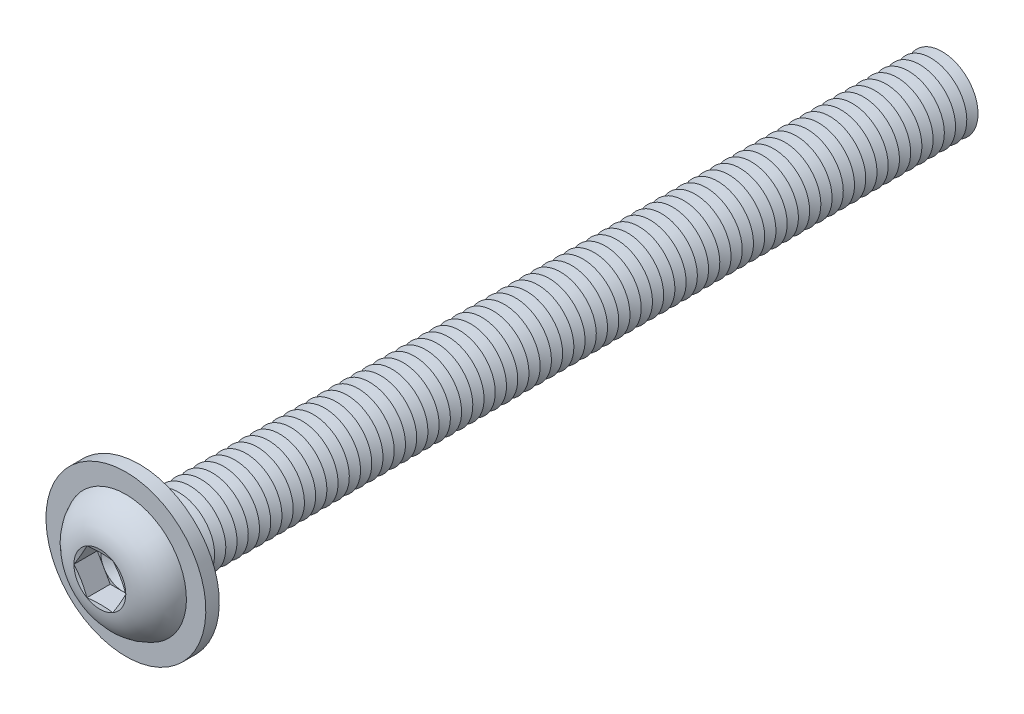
ISO-10303-21;
HEADER;
FILE_DESCRIPTION(('STEP AP214'),'2;1');
FILE_NAME('part.step','',(''),(''),'','','');
FILE_SCHEMA(('AUTOMOTIVE_DESIGN { 1 0 10303 214 1 1 1 1 }'));
ENDSEC;
DATA;
#1=APPLICATION_CONTEXT('core data for automotive mechanical design processes');
#2=APPLICATION_PROTOCOL_DEFINITION('international standard','automotive_design',2000,#1);
#3=PRODUCT_CONTEXT('',#1,'mechanical');
#4=PRODUCT('Part','Part','',(#3));
#5=PRODUCT_RELATED_PRODUCT_CATEGORY('part','',(#4));
#6=PRODUCT_DEFINITION_FORMATION('','',#4);
#7=PRODUCT_DEFINITION_CONTEXT('part definition',#1,'design');
#8=PRODUCT_DEFINITION('design','',#6,#7);
#9=PRODUCT_DEFINITION_SHAPE('','',#8);
#10=(LENGTH_UNIT() NAMED_UNIT(*) SI_UNIT(.MILLI.,.METRE.));
#11=(NAMED_UNIT(*) PLANE_ANGLE_UNIT() SI_UNIT($,.RADIAN.));
#12=(NAMED_UNIT(*) SI_UNIT($,.STERADIAN.) SOLID_ANGLE_UNIT());
#13=UNCERTAINTY_MEASURE_WITH_UNIT(LENGTH_MEASURE(1.E-05),#10,'distance_accuracy_value','');
#14=(GEOMETRIC_REPRESENTATION_CONTEXT(3) GLOBAL_UNCERTAINTY_ASSIGNED_CONTEXT((#13)) GLOBAL_UNIT_ASSIGNED_CONTEXT((#10,
#11,#12)) REPRESENTATION_CONTEXT('',''));
#15=CARTESIAN_POINT('',(0.,0.,0.));
#16=DIRECTION('',(0.,0.,1.));
#17=DIRECTION('',(1.,0.,0.));
#18=AXIS2_PLACEMENT_3D('',#15,#16,#17);
#19=CARTESIAN_POINT('',(0.,0.,-85.625));
#20=DIRECTION('',(0.,0.,1.));
#21=DIRECTION('',(0.,-1.,0.));
#22=AXIS2_PLACEMENT_3D('',#19,#20,#21);
#23=CONICAL_SURFACE('',#22,3.99999999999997,1.0471975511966);
#24=CARTESIAN_POINT('',(0.,0.,-86.25));
#25=DIRECTION('',(0.,0.,1.));
#26=DIRECTION('',(0.,-1.,0.));
#27=AXIS2_PLACEMENT_3D('',#24,#25,#26);
#28=CIRCLE('',#27,2.91746824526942);
#29=CARTESIAN_POINT('',(0.,-2.91746824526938,-86.25));
#30=VERTEX_POINT('',#29);
#31=EDGE_CURVE('E784',#30,#30,#28,.T.);
#32=ORIENTED_EDGE('',*,*,#31,.T.);
#33=EDGE_LOOP('',(#32));
#34=FACE_BOUND('',#33,.T.);
#35=CARTESIAN_POINT('',(0.,0.,-85.625));
#36=DIRECTION('',(0.,0.,1.));
#37=DIRECTION('',(0.,-1.,0.));
#38=AXIS2_PLACEMENT_3D('',#35,#36,#37);
#39=CIRCLE('',#38,3.99999999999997);
#40=CARTESIAN_POINT('',(0.,-3.99999999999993,-85.625));
#41=VERTEX_POINT('',#40);
#42=EDGE_CURVE('E780',#41,#41,#39,.T.);
#43=ORIENTED_EDGE('',*,*,#42,.F.);
#44=EDGE_LOOP('',(#43));
#45=FACE_BOUND('',#44,.T.);
#46=ADVANCED_FACE('F39',(#34,#45),#23,.T.);
#47=CARTESIAN_POINT('',(0.,0.,-86.25));
#48=DIRECTION('',(0.,0.,-1.));
#49=DIRECTION('',(0.,1.,0.));
#50=AXIS2_PLACEMENT_3D('',#47,#48,#49);
#51=CONICAL_SURFACE('',#50,2.91746824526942,1.0471975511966);
#52=CARTESIAN_POINT('',(0.,0.,-86.875));
#53=DIRECTION('',(0.,0.,1.));
#54=DIRECTION('',(0.,-1.,0.));
#55=AXIS2_PLACEMENT_3D('',#52,#53,#54);
#56=CIRCLE('',#55,3.99999999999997);
#57=CARTESIAN_POINT('',(0.,-3.99999999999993,-86.875));
#58=VERTEX_POINT('',#57);
#59=EDGE_CURVE('E788',#58,#58,#56,.T.);
#60=ORIENTED_EDGE('',*,*,#59,.T.);
#61=EDGE_LOOP('',(#60));
#62=FACE_BOUND('',#61,.T.);
#63=ORIENTED_EDGE('',*,*,#31,.F.);
#64=EDGE_LOOP('',(#63));
#65=FACE_BOUND('',#64,.T.);
#66=ADVANCED_FACE('F906',(#62,#65),#51,.T.);
#67=CARTESIAN_POINT('',(0.,3.99999999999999,-90.));
#68=DIRECTION('',(0.,0.,-1.));
#69=DIRECTION('',(0.,1.,0.));
#70=AXIS2_PLACEMENT_3D('',#67,#68,#69);
#71=PLANE('',#70);
#72=CARTESIAN_POINT('',(0.,0.,-90.));
#73=DIRECTION('',(0.,0.,1.));
#74=DIRECTION('',(0.,-1.,0.));
#75=AXIS2_PLACEMENT_3D('',#72,#73,#74);
#76=CIRCLE('',#75,2.91746824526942);
#77=CARTESIAN_POINT('',(0.,-2.91746824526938,-90.));
#78=VERTEX_POINT('',#77);
#79=EDGE_CURVE('E808',#78,#78,#76,.T.);
#80=ORIENTED_EDGE('',*,*,#79,.F.);
#81=EDGE_LOOP('',(#80));
#82=FACE_BOUND('',#81,.T.);
#83=ADVANCED_FACE('F912',(#82),#71,.T.);
#84=CARTESIAN_POINT('',(0.,0.,-89.375));
#85=DIRECTION('',(0.,0.,1.));
#86=DIRECTION('',(0.,-1.,0.));
#87=AXIS2_PLACEMENT_3D('',#84,#85,#86);
#88=CONICAL_SURFACE('',#87,3.99999999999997,1.0471975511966);
#89=ORIENTED_EDGE('',*,*,#79,.T.);
#90=EDGE_LOOP('',(#89));
#91=FACE_BOUND('',#90,.T.);
#92=CARTESIAN_POINT('',(0.,0.,-89.375));
#93=DIRECTION('',(0.,0.,1.));
#94=DIRECTION('',(0.,-1.,0.));
#95=AXIS2_PLACEMENT_3D('',#92,#93,#94);
#96=CIRCLE('',#95,3.99999999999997);
#97=CARTESIAN_POINT('',(0.,-3.99999999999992,-89.375));
#98=VERTEX_POINT('',#97);
#99=EDGE_CURVE('E804',#98,#98,#96,.T.);
#100=ORIENTED_EDGE('',*,*,#99,.F.);
#101=EDGE_LOOP('',(#100));
#102=FACE_BOUND('',#101,.T.);
#103=ADVANCED_FACE('F931',(#91,#102),#88,.T.);
#104=CARTESIAN_POINT('',(0.,0.,-88.75));
#105=DIRECTION('',(0.,0.,-1.));
#106=DIRECTION('',(0.,1.,0.));
#107=AXIS2_PLACEMENT_3D('',#104,#105,#106);
#108=CONICAL_SURFACE('',#107,2.91746824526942,1.0471975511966);
#109=ORIENTED_EDGE('',*,*,#99,.T.);
#110=EDGE_LOOP('',(#109));
#111=FACE_BOUND('',#110,.T.);
#112=CARTESIAN_POINT('',(0.,0.,-88.75));
#113=DIRECTION('',(0.,0.,1.));
#114=DIRECTION('',(0.,-1.,0.));
#115=AXIS2_PLACEMENT_3D('',#112,#113,#114);
#116=CIRCLE('',#115,2.91746824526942);
#117=CARTESIAN_POINT('',(0.,-2.91746824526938,-88.75));
#118=VERTEX_POINT('',#117);
#119=EDGE_CURVE('E800',#118,#118,#116,.T.);
#120=ORIENTED_EDGE('',*,*,#119,.F.);
#121=EDGE_LOOP('',(#120));
#122=FACE_BOUND('',#121,.T.);
#123=ADVANCED_FACE('F928',(#111,#122),#108,.T.);
#124=CARTESIAN_POINT('',(0.,0.,-88.125));
#125=DIRECTION('',(0.,0.,1.));
#126=DIRECTION('',(0.,-1.,0.));
#127=AXIS2_PLACEMENT_3D('',#124,#125,#126);
#128=CONICAL_SURFACE('',#127,3.99999999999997,1.0471975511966);
#129=ORIENTED_EDGE('',*,*,#119,.T.);
#130=EDGE_LOOP('',(#129));
#131=FACE_BOUND('',#130,.T.);
#132=CARTESIAN_POINT('',(0.,0.,-88.125));
#133=DIRECTION('',(0.,0.,1.));
#134=DIRECTION('',(0.,-1.,0.));
#135=AXIS2_PLACEMENT_3D('',#132,#133,#134);
#136=CIRCLE('',#135,3.99999999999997);
#137=CARTESIAN_POINT('',(0.,-3.99999999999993,-88.125));
#138=VERTEX_POINT('',#137);
#139=EDGE_CURVE('E796',#138,#138,#136,.T.);
#140=ORIENTED_EDGE('',*,*,#139,.F.);
#141=EDGE_LOOP('',(#140));
#142=FACE_BOUND('',#141,.T.);
#143=ADVANCED_FACE('F922',(#131,#142),#128,.T.);
#144=CARTESIAN_POINT('',(0.,0.,-87.5));
#145=DIRECTION('',(0.,0.,-1.));
#146=DIRECTION('',(0.,1.,0.));
#147=AXIS2_PLACEMENT_3D('',#144,#145,#146);
#148=CONICAL_SURFACE('',#147,2.91746824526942,1.0471975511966);
#149=ORIENTED_EDGE('',*,*,#139,.T.);
#150=EDGE_LOOP('',(#149));
#151=FACE_BOUND('',#150,.T.);
#152=CARTESIAN_POINT('',(0.,0.,-87.5));
#153=DIRECTION('',(0.,0.,1.));
#154=DIRECTION('',(0.,-1.,0.));
#155=AXIS2_PLACEMENT_3D('',#152,#153,#154);
#156=CIRCLE('',#155,2.91746824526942);
#157=CARTESIAN_POINT('',(0.,-2.91746824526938,-87.5));
#158=VERTEX_POINT('',#157);
#159=EDGE_CURVE('E792',#158,#158,#156,.T.);
#160=ORIENTED_EDGE('',*,*,#159,.F.);
#161=EDGE_LOOP('',(#160));
#162=FACE_BOUND('',#161,.T.);
#163=ADVANCED_FACE('F918',(#151,#162),#148,.T.);
#164=CARTESIAN_POINT('',(0.,0.,-86.875));
#165=DIRECTION('',(0.,0.,1.));
#166=DIRECTION('',(0.,-1.,0.));
#167=AXIS2_PLACEMENT_3D('',#164,#165,#166);
#168=CONICAL_SURFACE('',#167,3.99999999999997,1.0471975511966);
#169=ORIENTED_EDGE('',*,*,#159,.T.);
#170=EDGE_LOOP('',(#169));
#171=FACE_BOUND('',#170,.T.);
#172=ORIENTED_EDGE('',*,*,#59,.F.);
#173=EDGE_LOOP('',(#172));
#174=FACE_BOUND('',#173,.T.);
#175=ADVANCED_FACE('F921',(#171,#174),#168,.T.);
#176=CARTESIAN_POINT('',(0.,0.,-84.375));
#177=DIRECTION('',(0.,0.,1.));
#178=DIRECTION('',(0.,-1.,0.));
#179=AXIS2_PLACEMENT_3D('',#176,#177,#178);
#180=CONICAL_SURFACE('',#179,3.99999999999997,1.0471975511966);
#181=CARTESIAN_POINT('',(0.,0.,-85.));
#182=DIRECTION('',(0.,0.,1.));
#183=DIRECTION('',(0.,-1.,0.));
#184=AXIS2_PLACEMENT_3D('',#181,#182,#183);
#185=CIRCLE('',#184,2.91746824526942);
#186=CARTESIAN_POINT('',(0.,-2.91746824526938,-85.));
#187=VERTEX_POINT('',#186);
#188=EDGE_CURVE('E776',#187,#187,#185,.T.);
#189=ORIENTED_EDGE('',*,*,#188,.T.);
#190=EDGE_LOOP('',(#189));
#191=FACE_BOUND('',#190,.T.);
#192=CARTESIAN_POINT('',(0.,0.,-84.375));
#193=DIRECTION('',(0.,0.,1.));
#194=DIRECTION('',(0.,-1.,0.));
#195=AXIS2_PLACEMENT_3D('',#192,#193,#194);
#196=CIRCLE('',#195,3.99999999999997);
#197=CARTESIAN_POINT('',(0.,-3.99999999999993,-84.375));
#198=VERTEX_POINT('',#197);
#199=EDGE_CURVE('E772',#198,#198,#196,.T.);
#200=ORIENTED_EDGE('',*,*,#199,.F.);
#201=EDGE_LOOP('',(#200));
#202=FACE_BOUND('',#201,.T.);
#203=ADVANCED_FACE('F926',(#191,#202),#180,.T.);
#204=CARTESIAN_POINT('',(0.,0.,-85.));
#205=DIRECTION('',(0.,0.,-1.));
#206=DIRECTION('',(0.,1.,0.));
#207=AXIS2_PLACEMENT_3D('',#204,#205,#206);
#208=CONICAL_SURFACE('',#207,2.91746824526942,1.0471975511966);
#209=ORIENTED_EDGE('',*,*,#42,.T.);
#210=EDGE_LOOP('',(#209));
#211=FACE_BOUND('',#210,.T.);
#212=ORIENTED_EDGE('',*,*,#188,.F.);
#213=EDGE_LOOP('',(#212));
#214=FACE_BOUND('',#213,.T.);
#215=ADVANCED_FACE('F977',(#211,#214),#208,.T.);
#216=CARTESIAN_POINT('',(0.,0.,-83.125));
#217=DIRECTION('',(0.,0.,1.));
#218=DIRECTION('',(0.,-1.,0.));
#219=AXIS2_PLACEMENT_3D('',#216,#217,#218);
#220=CONICAL_SURFACE('',#219,3.99999999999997,1.0471975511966);
#221=CARTESIAN_POINT('',(0.,0.,-83.75));
#222=DIRECTION('',(0.,0.,1.));
#223=DIRECTION('',(0.,-1.,0.));
#224=AXIS2_PLACEMENT_3D('',#221,#222,#223);
#225=CIRCLE('',#224,2.91746824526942);
#226=CARTESIAN_POINT('',(0.,-2.91746824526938,-83.75));
#227=VERTEX_POINT('',#226);
#228=EDGE_CURVE('E768',#227,#227,#225,.T.);
#229=ORIENTED_EDGE('',*,*,#228,.T.);
#230=EDGE_LOOP('',(#229));
#231=FACE_BOUND('',#230,.T.);
#232=CARTESIAN_POINT('',(0.,0.,-83.125));
#233=DIRECTION('',(0.,0.,1.));
#234=DIRECTION('',(0.,-1.,0.));
#235=AXIS2_PLACEMENT_3D('',#232,#233,#234);
#236=CIRCLE('',#235,3.99999999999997);
#237=CARTESIAN_POINT('',(0.,-3.99999999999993,-83.125));
#238=VERTEX_POINT('',#237);
#239=EDGE_CURVE('E764',#238,#238,#236,.T.);
#240=ORIENTED_EDGE('',*,*,#239,.F.);
#241=EDGE_LOOP('',(#240));
#242=FACE_BOUND('',#241,.T.);
#243=ADVANCED_FACE('F983',(#231,#242),#220,.T.);
#244=CARTESIAN_POINT('',(0.,0.,-83.75));
#245=DIRECTION('',(0.,0.,-1.));
#246=DIRECTION('',(0.,1.,0.));
#247=AXIS2_PLACEMENT_3D('',#244,#245,#246);
#248=CONICAL_SURFACE('',#247,2.91746824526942,1.0471975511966);
#249=ORIENTED_EDGE('',*,*,#199,.T.);
#250=EDGE_LOOP('',(#249));
#251=FACE_BOUND('',#250,.T.);
#252=ORIENTED_EDGE('',*,*,#228,.F.);
#253=EDGE_LOOP('',(#252));
#254=FACE_BOUND('',#253,.T.);
#255=ADVANCED_FACE('F990',(#251,#254),#248,.T.);
#256=CARTESIAN_POINT('',(0.,0.,-81.875));
#257=DIRECTION('',(0.,0.,1.));
#258=DIRECTION('',(0.,-1.,0.));
#259=AXIS2_PLACEMENT_3D('',#256,#257,#258);
#260=CONICAL_SURFACE('',#259,3.99999999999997,1.0471975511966);
#261=CARTESIAN_POINT('',(0.,0.,-82.5));
#262=DIRECTION('',(0.,0.,1.));
#263=DIRECTION('',(0.,-1.,0.));
#264=AXIS2_PLACEMENT_3D('',#261,#262,#263);
#265=CIRCLE('',#264,2.91746824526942);
#266=CARTESIAN_POINT('',(0.,-2.91746824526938,-82.5));
#267=VERTEX_POINT('',#266);
#268=EDGE_CURVE('E760',#267,#267,#265,.T.);
#269=ORIENTED_EDGE('',*,*,#268,.T.);
#270=EDGE_LOOP('',(#269));
#271=FACE_BOUND('',#270,.T.);
#272=CARTESIAN_POINT('',(0.,0.,-81.875));
#273=DIRECTION('',(0.,0.,1.));
#274=DIRECTION('',(0.,-1.,0.));
#275=AXIS2_PLACEMENT_3D('',#272,#273,#274);
#276=CIRCLE('',#275,3.99999999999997);
#277=CARTESIAN_POINT('',(0.,-3.99999999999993,-81.875));
#278=VERTEX_POINT('',#277);
#279=EDGE_CURVE('E756',#278,#278,#276,.T.);
#280=ORIENTED_EDGE('',*,*,#279,.F.);
#281=EDGE_LOOP('',(#280));
#282=FACE_BOUND('',#281,.T.);
#283=ADVANCED_FACE('F997',(#271,#282),#260,.T.);
#284=CARTESIAN_POINT('',(0.,0.,-82.5));
#285=DIRECTION('',(0.,0.,-1.));
#286=DIRECTION('',(0.,1.,0.));
#287=AXIS2_PLACEMENT_3D('',#284,#285,#286);
#288=CONICAL_SURFACE('',#287,2.91746824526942,1.0471975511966);
#289=ORIENTED_EDGE('',*,*,#239,.T.);
#290=EDGE_LOOP('',(#289));
#291=FACE_BOUND('',#290,.T.);
#292=ORIENTED_EDGE('',*,*,#268,.F.);
#293=EDGE_LOOP('',(#292));
#294=FACE_BOUND('',#293,.T.);
#295=ADVANCED_FACE('F1004',(#291,#294),#288,.T.);
#296=CARTESIAN_POINT('',(0.,0.,-80.625));
#297=DIRECTION('',(0.,0.,1.));
#298=DIRECTION('',(0.,-1.,0.));
#299=AXIS2_PLACEMENT_3D('',#296,#297,#298);
#300=CONICAL_SURFACE('',#299,3.99999999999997,1.0471975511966);
#301=CARTESIAN_POINT('',(0.,0.,-81.25));
#302=DIRECTION('',(0.,0.,1.));
#303=DIRECTION('',(0.,-1.,0.));
#304=AXIS2_PLACEMENT_3D('',#301,#302,#303);
#305=CIRCLE('',#304,2.91746824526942);
#306=CARTESIAN_POINT('',(0.,-2.91746824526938,-81.25));
#307=VERTEX_POINT('',#306);
#308=EDGE_CURVE('E752',#307,#307,#305,.T.);
#309=ORIENTED_EDGE('',*,*,#308,.T.);
#310=EDGE_LOOP('',(#309));
#311=FACE_BOUND('',#310,.T.);
#312=CARTESIAN_POINT('',(0.,0.,-80.625));
#313=DIRECTION('',(0.,0.,1.));
#314=DIRECTION('',(0.,-1.,0.));
#315=AXIS2_PLACEMENT_3D('',#312,#313,#314);
#316=CIRCLE('',#315,3.99999999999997);
#317=CARTESIAN_POINT('',(0.,-3.99999999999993,-80.625));
#318=VERTEX_POINT('',#317);
#319=EDGE_CURVE('E748',#318,#318,#316,.T.);
#320=ORIENTED_EDGE('',*,*,#319,.F.);
#321=EDGE_LOOP('',(#320));
#322=FACE_BOUND('',#321,.T.);
#323=ADVANCED_FACE('F1011',(#311,#322),#300,.T.);
#324=CARTESIAN_POINT('',(0.,0.,-81.25));
#325=DIRECTION('',(0.,0.,-1.));
#326=DIRECTION('',(0.,1.,0.));
#327=AXIS2_PLACEMENT_3D('',#324,#325,#326);
#328=CONICAL_SURFACE('',#327,2.91746824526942,1.0471975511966);
#329=ORIENTED_EDGE('',*,*,#279,.T.);
#330=EDGE_LOOP('',(#329));
#331=FACE_BOUND('',#330,.T.);
#332=ORIENTED_EDGE('',*,*,#308,.F.);
#333=EDGE_LOOP('',(#332));
#334=FACE_BOUND('',#333,.T.);
#335=ADVANCED_FACE('F1018',(#331,#334),#328,.T.);
#336=CARTESIAN_POINT('',(0.,0.,-79.375));
#337=DIRECTION('',(0.,0.,1.));
#338=DIRECTION('',(0.,-1.,0.));
#339=AXIS2_PLACEMENT_3D('',#336,#337,#338);
#340=CONICAL_SURFACE('',#339,3.99999999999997,1.0471975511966);
#341=CARTESIAN_POINT('',(0.,0.,-80.));
#342=DIRECTION('',(0.,0.,1.));
#343=DIRECTION('',(0.,-1.,0.));
#344=AXIS2_PLACEMENT_3D('',#341,#342,#343);
#345=CIRCLE('',#344,2.91746824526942);
#346=CARTESIAN_POINT('',(0.,-2.91746824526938,-80.));
#347=VERTEX_POINT('',#346);
#348=EDGE_CURVE('E744',#347,#347,#345,.T.);
#349=ORIENTED_EDGE('',*,*,#348,.T.);
#350=EDGE_LOOP('',(#349));
#351=FACE_BOUND('',#350,.T.);
#352=CARTESIAN_POINT('',(0.,0.,-79.375));
#353=DIRECTION('',(0.,0.,1.));
#354=DIRECTION('',(0.,-1.,0.));
#355=AXIS2_PLACEMENT_3D('',#352,#353,#354);
#356=CIRCLE('',#355,3.99999999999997);
#357=CARTESIAN_POINT('',(0.,-3.99999999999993,-79.375));
#358=VERTEX_POINT('',#357);
#359=EDGE_CURVE('E740',#358,#358,#356,.T.);
#360=ORIENTED_EDGE('',*,*,#359,.F.);
#361=EDGE_LOOP('',(#360));
#362=FACE_BOUND('',#361,.T.);
#363=ADVANCED_FACE('F1025',(#351,#362),#340,.T.);
#364=CARTESIAN_POINT('',(0.,0.,-80.));
#365=DIRECTION('',(0.,0.,-1.));
#366=DIRECTION('',(0.,1.,0.));
#367=AXIS2_PLACEMENT_3D('',#364,#365,#366);
#368=CONICAL_SURFACE('',#367,2.91746824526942,1.0471975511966);
#369=ORIENTED_EDGE('',*,*,#319,.T.);
#370=EDGE_LOOP('',(#369));
#371=FACE_BOUND('',#370,.T.);
#372=ORIENTED_EDGE('',*,*,#348,.F.);
#373=EDGE_LOOP('',(#372));
#374=FACE_BOUND('',#373,.T.);
#375=ADVANCED_FACE('F1032',(#371,#374),#368,.T.);
#376=CARTESIAN_POINT('',(0.,0.,-78.125));
#377=DIRECTION('',(0.,0.,1.));
#378=DIRECTION('',(0.,-1.,0.));
#379=AXIS2_PLACEMENT_3D('',#376,#377,#378);
#380=CONICAL_SURFACE('',#379,3.99999999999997,1.0471975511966);
#381=CARTESIAN_POINT('',(0.,0.,-78.75));
#382=DIRECTION('',(0.,0.,1.));
#383=DIRECTION('',(0.,-1.,0.));
#384=AXIS2_PLACEMENT_3D('',#381,#382,#383);
#385=CIRCLE('',#384,2.91746824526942);
#386=CARTESIAN_POINT('',(0.,-2.91746824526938,-78.75));
#387=VERTEX_POINT('',#386);
#388=EDGE_CURVE('E736',#387,#387,#385,.T.);
#389=ORIENTED_EDGE('',*,*,#388,.T.);
#390=EDGE_LOOP('',(#389));
#391=FACE_BOUND('',#390,.T.);
#392=CARTESIAN_POINT('',(0.,0.,-78.125));
#393=DIRECTION('',(0.,0.,1.));
#394=DIRECTION('',(0.,-1.,0.));
#395=AXIS2_PLACEMENT_3D('',#392,#393,#394);
#396=CIRCLE('',#395,3.99999999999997);
#397=CARTESIAN_POINT('',(0.,-3.99999999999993,-78.125));
#398=VERTEX_POINT('',#397);
#399=EDGE_CURVE('E732',#398,#398,#396,.T.);
#400=ORIENTED_EDGE('',*,*,#399,.F.);
#401=EDGE_LOOP('',(#400));
#402=FACE_BOUND('',#401,.T.);
#403=ADVANCED_FACE('F1039',(#391,#402),#380,.T.);
#404=CARTESIAN_POINT('',(0.,0.,-78.75));
#405=DIRECTION('',(0.,0.,-1.));
#406=DIRECTION('',(0.,1.,0.));
#407=AXIS2_PLACEMENT_3D('',#404,#405,#406);
#408=CONICAL_SURFACE('',#407,2.91746824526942,1.0471975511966);
#409=ORIENTED_EDGE('',*,*,#359,.T.);
#410=EDGE_LOOP('',(#409));
#411=FACE_BOUND('',#410,.T.);
#412=ORIENTED_EDGE('',*,*,#388,.F.);
#413=EDGE_LOOP('',(#412));
#414=FACE_BOUND('',#413,.T.);
#415=ADVANCED_FACE('F1046',(#411,#414),#408,.T.);
#416=CARTESIAN_POINT('',(0.,0.,-76.875));
#417=DIRECTION('',(0.,0.,1.));
#418=DIRECTION('',(0.,-1.,0.));
#419=AXIS2_PLACEMENT_3D('',#416,#417,#418);
#420=CONICAL_SURFACE('',#419,3.99999999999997,1.0471975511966);
#421=CARTESIAN_POINT('',(0.,0.,-77.5));
#422=DIRECTION('',(0.,0.,1.));
#423=DIRECTION('',(0.,-1.,0.));
#424=AXIS2_PLACEMENT_3D('',#421,#422,#423);
#425=CIRCLE('',#424,2.91746824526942);
#426=CARTESIAN_POINT('',(0.,-2.91746824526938,-77.5));
#427=VERTEX_POINT('',#426);
#428=EDGE_CURVE('E728',#427,#427,#425,.T.);
#429=ORIENTED_EDGE('',*,*,#428,.T.);
#430=EDGE_LOOP('',(#429));
#431=FACE_BOUND('',#430,.T.);
#432=CARTESIAN_POINT('',(0.,0.,-76.875));
#433=DIRECTION('',(0.,0.,1.));
#434=DIRECTION('',(0.,-1.,0.));
#435=AXIS2_PLACEMENT_3D('',#432,#433,#434);
#436=CIRCLE('',#435,3.99999999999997);
#437=CARTESIAN_POINT('',(0.,-3.99999999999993,-76.875));
#438=VERTEX_POINT('',#437);
#439=EDGE_CURVE('E724',#438,#438,#436,.T.);
#440=ORIENTED_EDGE('',*,*,#439,.F.);
#441=EDGE_LOOP('',(#440));
#442=FACE_BOUND('',#441,.T.);
#443=ADVANCED_FACE('F1053',(#431,#442),#420,.T.);
#444=CARTESIAN_POINT('',(0.,0.,-77.5));
#445=DIRECTION('',(0.,0.,-1.));
#446=DIRECTION('',(0.,1.,0.));
#447=AXIS2_PLACEMENT_3D('',#444,#445,#446);
#448=CONICAL_SURFACE('',#447,2.91746824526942,1.0471975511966);
#449=ORIENTED_EDGE('',*,*,#399,.T.);
#450=EDGE_LOOP('',(#449));
#451=FACE_BOUND('',#450,.T.);
#452=ORIENTED_EDGE('',*,*,#428,.F.);
#453=EDGE_LOOP('',(#452));
#454=FACE_BOUND('',#453,.T.);
#455=ADVANCED_FACE('F1060',(#451,#454),#448,.T.);
#456=CARTESIAN_POINT('',(0.,0.,-75.625));
#457=DIRECTION('',(0.,0.,1.));
#458=DIRECTION('',(0.,-1.,0.));
#459=AXIS2_PLACEMENT_3D('',#456,#457,#458);
#460=CONICAL_SURFACE('',#459,3.99999999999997,1.0471975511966);
#461=CARTESIAN_POINT('',(0.,0.,-76.25));
#462=DIRECTION('',(0.,0.,1.));
#463=DIRECTION('',(0.,-1.,0.));
#464=AXIS2_PLACEMENT_3D('',#461,#462,#463);
#465=CIRCLE('',#464,2.91746824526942);
#466=CARTESIAN_POINT('',(0.,-2.91746824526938,-76.25));
#467=VERTEX_POINT('',#466);
#468=EDGE_CURVE('E720',#467,#467,#465,.T.);
#469=ORIENTED_EDGE('',*,*,#468,.T.);
#470=EDGE_LOOP('',(#469));
#471=FACE_BOUND('',#470,.T.);
#472=CARTESIAN_POINT('',(0.,0.,-75.625));
#473=DIRECTION('',(0.,0.,1.));
#474=DIRECTION('',(0.,-1.,0.));
#475=AXIS2_PLACEMENT_3D('',#472,#473,#474);
#476=CIRCLE('',#475,3.99999999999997);
#477=CARTESIAN_POINT('',(0.,-3.99999999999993,-75.625));
#478=VERTEX_POINT('',#477);
#479=EDGE_CURVE('E716',#478,#478,#476,.T.);
#480=ORIENTED_EDGE('',*,*,#479,.F.);
#481=EDGE_LOOP('',(#480));
#482=FACE_BOUND('',#481,.T.);
#483=ADVANCED_FACE('F1067',(#471,#482),#460,.T.);
#484=CARTESIAN_POINT('',(0.,0.,-76.25));
#485=DIRECTION('',(0.,0.,-1.));
#486=DIRECTION('',(0.,1.,0.));
#487=AXIS2_PLACEMENT_3D('',#484,#485,#486);
#488=CONICAL_SURFACE('',#487,2.91746824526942,1.0471975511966);
#489=ORIENTED_EDGE('',*,*,#439,.T.);
#490=EDGE_LOOP('',(#489));
#491=FACE_BOUND('',#490,.T.);
#492=ORIENTED_EDGE('',*,*,#468,.F.);
#493=EDGE_LOOP('',(#492));
#494=FACE_BOUND('',#493,.T.);
#495=ADVANCED_FACE('F1074',(#491,#494),#488,.T.);
#496=CARTESIAN_POINT('',(0.,0.,-74.375));
#497=DIRECTION('',(0.,0.,1.));
#498=DIRECTION('',(0.,-1.,0.));
#499=AXIS2_PLACEMENT_3D('',#496,#497,#498);
#500=CONICAL_SURFACE('',#499,3.99999999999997,1.0471975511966);
#501=CARTESIAN_POINT('',(0.,0.,-75.));
#502=DIRECTION('',(0.,0.,1.));
#503=DIRECTION('',(0.,-1.,0.));
#504=AXIS2_PLACEMENT_3D('',#501,#502,#503);
#505=CIRCLE('',#504,2.91746824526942);
#506=CARTESIAN_POINT('',(0.,-2.91746824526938,-75.));
#507=VERTEX_POINT('',#506);
#508=EDGE_CURVE('E713',#507,#507,#505,.T.);
#509=ORIENTED_EDGE('',*,*,#508,.T.);
#510=EDGE_LOOP('',(#509));
#511=FACE_BOUND('',#510,.T.);
#512=CARTESIAN_POINT('',(0.,0.,-74.375));
#513=DIRECTION('',(0.,0.,1.));
#514=DIRECTION('',(0.,-1.,0.));
#515=AXIS2_PLACEMENT_3D('',#512,#513,#514);
#516=CIRCLE('',#515,3.99999999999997);
#517=CARTESIAN_POINT('',(0.,-3.99999999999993,-74.375));
#518=VERTEX_POINT('',#517);
#519=EDGE_CURVE('E709',#518,#518,#516,.T.);
#520=ORIENTED_EDGE('',*,*,#519,.F.);
#521=EDGE_LOOP('',(#520));
#522=FACE_BOUND('',#521,.T.);
#523=ADVANCED_FACE('F1081',(#511,#522),#500,.T.);
#524=CARTESIAN_POINT('',(0.,0.,-75.));
#525=DIRECTION('',(0.,0.,-1.));
#526=DIRECTION('',(0.,1.,0.));
#527=AXIS2_PLACEMENT_3D('',#524,#525,#526);
#528=CONICAL_SURFACE('',#527,2.91746824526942,1.0471975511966);
#529=ORIENTED_EDGE('',*,*,#479,.T.);
#530=EDGE_LOOP('',(#529));
#531=FACE_BOUND('',#530,.T.);
#532=ORIENTED_EDGE('',*,*,#508,.F.);
#533=EDGE_LOOP('',(#532));
#534=FACE_BOUND('',#533,.T.);
#535=ADVANCED_FACE('F1088',(#531,#534),#528,.T.);
#536=CARTESIAN_POINT('',(0.,0.,-73.125));
#537=DIRECTION('',(0.,0.,1.));
#538=DIRECTION('',(0.,-1.,0.));
#539=AXIS2_PLACEMENT_3D('',#536,#537,#538);
#540=CONICAL_SURFACE('',#539,3.99999999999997,1.0471975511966);
#541=CARTESIAN_POINT('',(0.,0.,-73.75));
#542=DIRECTION('',(0.,0.,1.));
#543=DIRECTION('',(0.,-1.,0.));
#544=AXIS2_PLACEMENT_3D('',#541,#542,#543);
#545=CIRCLE('',#544,2.91746824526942);
#546=CARTESIAN_POINT('',(0.,-2.91746824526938,-73.75));
#547=VERTEX_POINT('',#546);
#548=EDGE_CURVE('E705',#547,#547,#545,.T.);
#549=ORIENTED_EDGE('',*,*,#548,.T.);
#550=EDGE_LOOP('',(#549));
#551=FACE_BOUND('',#550,.T.);
#552=CARTESIAN_POINT('',(0.,0.,-73.125));
#553=DIRECTION('',(0.,0.,1.));
#554=DIRECTION('',(0.,-1.,0.));
#555=AXIS2_PLACEMENT_3D('',#552,#553,#554);
#556=CIRCLE('',#555,3.99999999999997);
#557=CARTESIAN_POINT('',(0.,-3.99999999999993,-73.125));
#558=VERTEX_POINT('',#557);
#559=EDGE_CURVE('E701',#558,#558,#556,.T.);
#560=ORIENTED_EDGE('',*,*,#559,.F.);
#561=EDGE_LOOP('',(#560));
#562=FACE_BOUND('',#561,.T.);
#563=ADVANCED_FACE('F1095',(#551,#562),#540,.T.);
#564=CARTESIAN_POINT('',(0.,0.,-73.75));
#565=DIRECTION('',(0.,0.,-1.));
#566=DIRECTION('',(0.,1.,0.));
#567=AXIS2_PLACEMENT_3D('',#564,#565,#566);
#568=CONICAL_SURFACE('',#567,2.91746824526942,1.0471975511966);
#569=ORIENTED_EDGE('',*,*,#519,.T.);
#570=EDGE_LOOP('',(#569));
#571=FACE_BOUND('',#570,.T.);
#572=ORIENTED_EDGE('',*,*,#548,.F.);
#573=EDGE_LOOP('',(#572));
#574=FACE_BOUND('',#573,.T.);
#575=ADVANCED_FACE('F1102',(#571,#574),#568,.T.);
#576=CARTESIAN_POINT('',(0.,0.,-71.875));
#577=DIRECTION('',(0.,0.,1.));
#578=DIRECTION('',(0.,-1.,0.));
#579=AXIS2_PLACEMENT_3D('',#576,#577,#578);
#580=CONICAL_SURFACE('',#579,3.99999999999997,1.0471975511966);
#581=CARTESIAN_POINT('',(0.,0.,-72.5));
#582=DIRECTION('',(0.,0.,1.));
#583=DIRECTION('',(0.,-1.,0.));
#584=AXIS2_PLACEMENT_3D('',#581,#582,#583);
#585=CIRCLE('',#584,2.91746824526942);
#586=CARTESIAN_POINT('',(0.,-2.91746824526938,-72.5));
#587=VERTEX_POINT('',#586);
#588=EDGE_CURVE('E697',#587,#587,#585,.T.);
#589=ORIENTED_EDGE('',*,*,#588,.T.);
#590=EDGE_LOOP('',(#589));
#591=FACE_BOUND('',#590,.T.);
#592=CARTESIAN_POINT('',(0.,0.,-71.875));
#593=DIRECTION('',(0.,0.,1.));
#594=DIRECTION('',(0.,-1.,0.));
#595=AXIS2_PLACEMENT_3D('',#592,#593,#594);
#596=CIRCLE('',#595,3.99999999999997);
#597=CARTESIAN_POINT('',(0.,-3.99999999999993,-71.875));
#598=VERTEX_POINT('',#597);
#599=EDGE_CURVE('E693',#598,#598,#596,.T.);
#600=ORIENTED_EDGE('',*,*,#599,.F.);
#601=EDGE_LOOP('',(#600));
#602=FACE_BOUND('',#601,.T.);
#603=ADVANCED_FACE('F1109',(#591,#602),#580,.T.);
#604=CARTESIAN_POINT('',(0.,0.,-72.5));
#605=DIRECTION('',(0.,0.,-1.));
#606=DIRECTION('',(0.,1.,0.));
#607=AXIS2_PLACEMENT_3D('',#604,#605,#606);
#608=CONICAL_SURFACE('',#607,2.91746824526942,1.0471975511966);
#609=ORIENTED_EDGE('',*,*,#559,.T.);
#610=EDGE_LOOP('',(#609));
#611=FACE_BOUND('',#610,.T.);
#612=ORIENTED_EDGE('',*,*,#588,.F.);
#613=EDGE_LOOP('',(#612));
#614=FACE_BOUND('',#613,.T.);
#615=ADVANCED_FACE('F1116',(#611,#614),#608,.T.);
#616=CARTESIAN_POINT('',(0.,0.,-70.625));
#617=DIRECTION('',(0.,0.,1.));
#618=DIRECTION('',(0.,-1.,0.));
#619=AXIS2_PLACEMENT_3D('',#616,#617,#618);
#620=CONICAL_SURFACE('',#619,3.99999999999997,1.0471975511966);
#621=CARTESIAN_POINT('',(0.,0.,-71.25));
#622=DIRECTION('',(0.,0.,1.));
#623=DIRECTION('',(0.,-1.,0.));
#624=AXIS2_PLACEMENT_3D('',#621,#622,#623);
#625=CIRCLE('',#624,2.91746824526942);
#626=CARTESIAN_POINT('',(0.,-2.91746824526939,-71.25));
#627=VERTEX_POINT('',#626);
#628=EDGE_CURVE('E689',#627,#627,#625,.T.);
#629=ORIENTED_EDGE('',*,*,#628,.T.);
#630=EDGE_LOOP('',(#629));
#631=FACE_BOUND('',#630,.T.);
#632=CARTESIAN_POINT('',(0.,0.,-70.625));
#633=DIRECTION('',(0.,0.,1.));
#634=DIRECTION('',(0.,-1.,0.));
#635=AXIS2_PLACEMENT_3D('',#632,#633,#634);
#636=CIRCLE('',#635,3.99999999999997);
#637=CARTESIAN_POINT('',(0.,-3.99999999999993,-70.625));
#638=VERTEX_POINT('',#637);
#639=EDGE_CURVE('E685',#638,#638,#636,.T.);
#640=ORIENTED_EDGE('',*,*,#639,.F.);
#641=EDGE_LOOP('',(#640));
#642=FACE_BOUND('',#641,.T.);
#643=ADVANCED_FACE('F1123',(#631,#642),#620,.T.);
#644=CARTESIAN_POINT('',(0.,0.,-71.25));
#645=DIRECTION('',(0.,0.,-1.));
#646=DIRECTION('',(0.,1.,0.));
#647=AXIS2_PLACEMENT_3D('',#644,#645,#646);
#648=CONICAL_SURFACE('',#647,2.91746824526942,1.0471975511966);
#649=ORIENTED_EDGE('',*,*,#599,.T.);
#650=EDGE_LOOP('',(#649));
#651=FACE_BOUND('',#650,.T.);
#652=ORIENTED_EDGE('',*,*,#628,.F.);
#653=EDGE_LOOP('',(#652));
#654=FACE_BOUND('',#653,.T.);
#655=ADVANCED_FACE('F1130',(#651,#654),#648,.T.);
#656=CARTESIAN_POINT('',(0.,0.,-69.375));
#657=DIRECTION('',(0.,0.,1.));
#658=DIRECTION('',(0.,-1.,0.));
#659=AXIS2_PLACEMENT_3D('',#656,#657,#658);
#660=CONICAL_SURFACE('',#659,3.99999999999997,1.0471975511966);
#661=CARTESIAN_POINT('',(0.,0.,-70.));
#662=DIRECTION('',(0.,0.,1.));
#663=DIRECTION('',(0.,-1.,0.));
#664=AXIS2_PLACEMENT_3D('',#661,#662,#663);
#665=CIRCLE('',#664,2.91746824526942);
#666=CARTESIAN_POINT('',(0.,-2.91746824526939,-70.));
#667=VERTEX_POINT('',#666);
#668=EDGE_CURVE('E681',#667,#667,#665,.T.);
#669=ORIENTED_EDGE('',*,*,#668,.T.);
#670=EDGE_LOOP('',(#669));
#671=FACE_BOUND('',#670,.T.);
#672=CARTESIAN_POINT('',(0.,0.,-69.375));
#673=DIRECTION('',(0.,0.,1.));
#674=DIRECTION('',(0.,-1.,0.));
#675=AXIS2_PLACEMENT_3D('',#672,#673,#674);
#676=CIRCLE('',#675,3.99999999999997);
#677=CARTESIAN_POINT('',(0.,-3.99999999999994,-69.375));
#678=VERTEX_POINT('',#677);
#679=EDGE_CURVE('E677',#678,#678,#676,.T.);
#680=ORIENTED_EDGE('',*,*,#679,.F.);
#681=EDGE_LOOP('',(#680));
#682=FACE_BOUND('',#681,.T.);
#683=ADVANCED_FACE('F1137',(#671,#682),#660,.T.);
#684=CARTESIAN_POINT('',(0.,0.,-70.));
#685=DIRECTION('',(0.,0.,-1.));
#686=DIRECTION('',(0.,1.,0.));
#687=AXIS2_PLACEMENT_3D('',#684,#685,#686);
#688=CONICAL_SURFACE('',#687,2.91746824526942,1.0471975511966);
#689=ORIENTED_EDGE('',*,*,#639,.T.);
#690=EDGE_LOOP('',(#689));
#691=FACE_BOUND('',#690,.T.);
#692=ORIENTED_EDGE('',*,*,#668,.F.);
#693=EDGE_LOOP('',(#692));
#694=FACE_BOUND('',#693,.T.);
#695=ADVANCED_FACE('F1144',(#691,#694),#688,.T.);
#696=CARTESIAN_POINT('',(0.,0.,-68.125));
#697=DIRECTION('',(0.,0.,1.));
#698=DIRECTION('',(0.,-1.,0.));
#699=AXIS2_PLACEMENT_3D('',#696,#697,#698);
#700=CONICAL_SURFACE('',#699,3.99999999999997,1.0471975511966);
#701=CARTESIAN_POINT('',(0.,0.,-68.75));
#702=DIRECTION('',(0.,0.,1.));
#703=DIRECTION('',(0.,-1.,0.));
#704=AXIS2_PLACEMENT_3D('',#701,#702,#703);
#705=CIRCLE('',#704,2.91746824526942);
#706=CARTESIAN_POINT('',(0.,-2.91746824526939,-68.75));
#707=VERTEX_POINT('',#706);
#708=EDGE_CURVE('E673',#707,#707,#705,.T.);
#709=ORIENTED_EDGE('',*,*,#708,.T.);
#710=EDGE_LOOP('',(#709));
#711=FACE_BOUND('',#710,.T.);
#712=CARTESIAN_POINT('',(0.,0.,-68.125));
#713=DIRECTION('',(0.,0.,1.));
#714=DIRECTION('',(0.,-1.,0.));
#715=AXIS2_PLACEMENT_3D('',#712,#713,#714);
#716=CIRCLE('',#715,3.99999999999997);
#717=CARTESIAN_POINT('',(0.,-3.99999999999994,-68.125));
#718=VERTEX_POINT('',#717);
#719=EDGE_CURVE('E669',#718,#718,#716,.T.);
#720=ORIENTED_EDGE('',*,*,#719,.F.);
#721=EDGE_LOOP('',(#720));
#722=FACE_BOUND('',#721,.T.);
#723=ADVANCED_FACE('F1151',(#711,#722),#700,.T.);
#724=CARTESIAN_POINT('',(0.,0.,-68.75));
#725=DIRECTION('',(0.,0.,-1.));
#726=DIRECTION('',(0.,1.,0.));
#727=AXIS2_PLACEMENT_3D('',#724,#725,#726);
#728=CONICAL_SURFACE('',#727,2.91746824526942,1.0471975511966);
#729=ORIENTED_EDGE('',*,*,#679,.T.);
#730=EDGE_LOOP('',(#729));
#731=FACE_BOUND('',#730,.T.);
#732=ORIENTED_EDGE('',*,*,#708,.F.);
#733=EDGE_LOOP('',(#732));
#734=FACE_BOUND('',#733,.T.);
#735=ADVANCED_FACE('F1158',(#731,#734),#728,.T.);
#736=CARTESIAN_POINT('',(0.,0.,-66.875));
#737=DIRECTION('',(0.,0.,1.));
#738=DIRECTION('',(0.,-1.,0.));
#739=AXIS2_PLACEMENT_3D('',#736,#737,#738);
#740=CONICAL_SURFACE('',#739,3.99999999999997,1.0471975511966);
#741=CARTESIAN_POINT('',(0.,0.,-67.5));
#742=DIRECTION('',(0.,0.,1.));
#743=DIRECTION('',(0.,-1.,0.));
#744=AXIS2_PLACEMENT_3D('',#741,#742,#743);
#745=CIRCLE('',#744,2.91746824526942);
#746=CARTESIAN_POINT('',(0.,-2.91746824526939,-67.5));
#747=VERTEX_POINT('',#746);
#748=EDGE_CURVE('E665',#747,#747,#745,.T.);
#749=ORIENTED_EDGE('',*,*,#748,.T.);
#750=EDGE_LOOP('',(#749));
#751=FACE_BOUND('',#750,.T.);
#752=CARTESIAN_POINT('',(0.,0.,-66.875));
#753=DIRECTION('',(0.,0.,1.));
#754=DIRECTION('',(0.,-1.,0.));
#755=AXIS2_PLACEMENT_3D('',#752,#753,#754);
#756=CIRCLE('',#755,3.99999999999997);
#757=CARTESIAN_POINT('',(0.,-3.99999999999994,-66.875));
#758=VERTEX_POINT('',#757);
#759=EDGE_CURVE('E661',#758,#758,#756,.T.);
#760=ORIENTED_EDGE('',*,*,#759,.F.);
#761=EDGE_LOOP('',(#760));
#762=FACE_BOUND('',#761,.T.);
#763=ADVANCED_FACE('F1165',(#751,#762),#740,.T.);
#764=CARTESIAN_POINT('',(0.,0.,-67.5));
#765=DIRECTION('',(0.,0.,-1.));
#766=DIRECTION('',(0.,1.,0.));
#767=AXIS2_PLACEMENT_3D('',#764,#765,#766);
#768=CONICAL_SURFACE('',#767,2.91746824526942,1.0471975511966);
#769=ORIENTED_EDGE('',*,*,#719,.T.);
#770=EDGE_LOOP('',(#769));
#771=FACE_BOUND('',#770,.T.);
#772=ORIENTED_EDGE('',*,*,#748,.F.);
#773=EDGE_LOOP('',(#772));
#774=FACE_BOUND('',#773,.T.);
#775=ADVANCED_FACE('F1172',(#771,#774),#768,.T.);
#776=CARTESIAN_POINT('',(0.,0.,-65.625));
#777=DIRECTION('',(0.,0.,1.));
#778=DIRECTION('',(0.,-1.,0.));
#779=AXIS2_PLACEMENT_3D('',#776,#777,#778);
#780=CONICAL_SURFACE('',#779,3.99999999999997,1.0471975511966);
#781=CARTESIAN_POINT('',(0.,0.,-66.25));
#782=DIRECTION('',(0.,0.,1.));
#783=DIRECTION('',(0.,-1.,0.));
#784=AXIS2_PLACEMENT_3D('',#781,#782,#783);
#785=CIRCLE('',#784,2.91746824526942);
#786=CARTESIAN_POINT('',(0.,-2.91746824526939,-66.25));
#787=VERTEX_POINT('',#786);
#788=EDGE_CURVE('E657',#787,#787,#785,.T.);
#789=ORIENTED_EDGE('',*,*,#788,.T.);
#790=EDGE_LOOP('',(#789));
#791=FACE_BOUND('',#790,.T.);
#792=CARTESIAN_POINT('',(0.,0.,-65.625));
#793=DIRECTION('',(0.,0.,1.));
#794=DIRECTION('',(0.,-1.,0.));
#795=AXIS2_PLACEMENT_3D('',#792,#793,#794);
#796=CIRCLE('',#795,3.99999999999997);
#797=CARTESIAN_POINT('',(0.,-3.99999999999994,-65.625));
#798=VERTEX_POINT('',#797);
#799=EDGE_CURVE('E653',#798,#798,#796,.T.);
#800=ORIENTED_EDGE('',*,*,#799,.F.);
#801=EDGE_LOOP('',(#800));
#802=FACE_BOUND('',#801,.T.);
#803=ADVANCED_FACE('F1179',(#791,#802),#780,.T.);
#804=CARTESIAN_POINT('',(0.,0.,-66.25));
#805=DIRECTION('',(0.,0.,-1.));
#806=DIRECTION('',(0.,1.,0.));
#807=AXIS2_PLACEMENT_3D('',#804,#805,#806);
#808=CONICAL_SURFACE('',#807,2.91746824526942,1.0471975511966);
#809=ORIENTED_EDGE('',*,*,#759,.T.);
#810=EDGE_LOOP('',(#809));
#811=FACE_BOUND('',#810,.T.);
#812=ORIENTED_EDGE('',*,*,#788,.F.);
#813=EDGE_LOOP('',(#812));
#814=FACE_BOUND('',#813,.T.);
#815=ADVANCED_FACE('F1186',(#811,#814),#808,.T.);
#816=CARTESIAN_POINT('',(0.,0.,-64.375));
#817=DIRECTION('',(0.,0.,1.));
#818=DIRECTION('',(0.,-1.,0.));
#819=AXIS2_PLACEMENT_3D('',#816,#817,#818);
#820=CONICAL_SURFACE('',#819,3.99999999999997,1.0471975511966);
#821=CARTESIAN_POINT('',(0.,0.,-65.));
#822=DIRECTION('',(0.,0.,1.));
#823=DIRECTION('',(0.,-1.,0.));
#824=AXIS2_PLACEMENT_3D('',#821,#822,#823);
#825=CIRCLE('',#824,2.91746824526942);
#826=CARTESIAN_POINT('',(0.,-2.91746824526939,-65.));
#827=VERTEX_POINT('',#826);
#828=EDGE_CURVE('E649',#827,#827,#825,.T.);
#829=ORIENTED_EDGE('',*,*,#828,.T.);
#830=EDGE_LOOP('',(#829));
#831=FACE_BOUND('',#830,.T.);
#832=CARTESIAN_POINT('',(0.,0.,-64.375));
#833=DIRECTION('',(0.,0.,1.));
#834=DIRECTION('',(0.,-1.,0.));
#835=AXIS2_PLACEMENT_3D('',#832,#833,#834);
#836=CIRCLE('',#835,3.99999999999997);
#837=CARTESIAN_POINT('',(0.,-3.99999999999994,-64.375));
#838=VERTEX_POINT('',#837);
#839=EDGE_CURVE('E645',#838,#838,#836,.T.);
#840=ORIENTED_EDGE('',*,*,#839,.F.);
#841=EDGE_LOOP('',(#840));
#842=FACE_BOUND('',#841,.T.);
#843=ADVANCED_FACE('F1193',(#831,#842),#820,.T.);
#844=CARTESIAN_POINT('',(0.,0.,-65.));
#845=DIRECTION('',(0.,0.,-1.));
#846=DIRECTION('',(0.,1.,0.));
#847=AXIS2_PLACEMENT_3D('',#844,#845,#846);
#848=CONICAL_SURFACE('',#847,2.91746824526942,1.0471975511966);
#849=ORIENTED_EDGE('',*,*,#799,.T.);
#850=EDGE_LOOP('',(#849));
#851=FACE_BOUND('',#850,.T.);
#852=ORIENTED_EDGE('',*,*,#828,.F.);
#853=EDGE_LOOP('',(#852));
#854=FACE_BOUND('',#853,.T.);
#855=ADVANCED_FACE('F1200',(#851,#854),#848,.T.);
#856=CARTESIAN_POINT('',(0.,0.,-63.125));
#857=DIRECTION('',(0.,0.,1.));
#858=DIRECTION('',(0.,-1.,0.));
#859=AXIS2_PLACEMENT_3D('',#856,#857,#858);
#860=CONICAL_SURFACE('',#859,3.99999999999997,1.0471975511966);
#861=CARTESIAN_POINT('',(0.,0.,-63.75));
#862=DIRECTION('',(0.,0.,1.));
#863=DIRECTION('',(0.,-1.,0.));
#864=AXIS2_PLACEMENT_3D('',#861,#862,#863);
#865=CIRCLE('',#864,2.91746824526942);
#866=CARTESIAN_POINT('',(0.,-2.91746824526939,-63.75));
#867=VERTEX_POINT('',#866);
#868=EDGE_CURVE('E641',#867,#867,#865,.T.);
#869=ORIENTED_EDGE('',*,*,#868,.T.);
#870=EDGE_LOOP('',(#869));
#871=FACE_BOUND('',#870,.T.);
#872=CARTESIAN_POINT('',(0.,0.,-63.125));
#873=DIRECTION('',(0.,0.,1.));
#874=DIRECTION('',(0.,-1.,0.));
#875=AXIS2_PLACEMENT_3D('',#872,#873,#874);
#876=CIRCLE('',#875,3.99999999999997);
#877=CARTESIAN_POINT('',(0.,-3.99999999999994,-63.125));
#878=VERTEX_POINT('',#877);
#879=EDGE_CURVE('E637',#878,#878,#876,.T.);
#880=ORIENTED_EDGE('',*,*,#879,.F.);
#881=EDGE_LOOP('',(#880));
#882=FACE_BOUND('',#881,.T.);
#883=ADVANCED_FACE('F1207',(#871,#882),#860,.T.);
#884=CARTESIAN_POINT('',(0.,0.,-63.75));
#885=DIRECTION('',(0.,0.,-1.));
#886=DIRECTION('',(0.,1.,0.));
#887=AXIS2_PLACEMENT_3D('',#884,#885,#886);
#888=CONICAL_SURFACE('',#887,2.91746824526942,1.0471975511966);
#889=ORIENTED_EDGE('',*,*,#839,.T.);
#890=EDGE_LOOP('',(#889));
#891=FACE_BOUND('',#890,.T.);
#892=ORIENTED_EDGE('',*,*,#868,.F.);
#893=EDGE_LOOP('',(#892));
#894=FACE_BOUND('',#893,.T.);
#895=ADVANCED_FACE('F1214',(#891,#894),#888,.T.);
#896=CARTESIAN_POINT('',(0.,0.,-61.875));
#897=DIRECTION('',(0.,0.,1.));
#898=DIRECTION('',(0.,-1.,0.));
#899=AXIS2_PLACEMENT_3D('',#896,#897,#898);
#900=CONICAL_SURFACE('',#899,3.99999999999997,1.0471975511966);
#901=CARTESIAN_POINT('',(0.,0.,-62.5));
#902=DIRECTION('',(0.,0.,1.));
#903=DIRECTION('',(0.,-1.,0.));
#904=AXIS2_PLACEMENT_3D('',#901,#902,#903);
#905=CIRCLE('',#904,2.91746824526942);
#906=CARTESIAN_POINT('',(0.,-2.91746824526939,-62.5));
#907=VERTEX_POINT('',#906);
#908=EDGE_CURVE('E633',#907,#907,#905,.T.);
#909=ORIENTED_EDGE('',*,*,#908,.T.);
#910=EDGE_LOOP('',(#909));
#911=FACE_BOUND('',#910,.T.);
#912=CARTESIAN_POINT('',(0.,0.,-61.875));
#913=DIRECTION('',(0.,0.,1.));
#914=DIRECTION('',(0.,-1.,0.));
#915=AXIS2_PLACEMENT_3D('',#912,#913,#914);
#916=CIRCLE('',#915,3.99999999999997);
#917=CARTESIAN_POINT('',(0.,-3.99999999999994,-61.875));
#918=VERTEX_POINT('',#917);
#919=EDGE_CURVE('E629',#918,#918,#916,.T.);
#920=ORIENTED_EDGE('',*,*,#919,.F.);
#921=EDGE_LOOP('',(#920));
#922=FACE_BOUND('',#921,.T.);
#923=ADVANCED_FACE('F1221',(#911,#922),#900,.T.);
#924=CARTESIAN_POINT('',(0.,0.,-62.5));
#925=DIRECTION('',(0.,0.,-1.));
#926=DIRECTION('',(0.,1.,0.));
#927=AXIS2_PLACEMENT_3D('',#924,#925,#926);
#928=CONICAL_SURFACE('',#927,2.91746824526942,1.0471975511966);
#929=ORIENTED_EDGE('',*,*,#879,.T.);
#930=EDGE_LOOP('',(#929));
#931=FACE_BOUND('',#930,.T.);
#932=ORIENTED_EDGE('',*,*,#908,.F.);
#933=EDGE_LOOP('',(#932));
#934=FACE_BOUND('',#933,.T.);
#935=ADVANCED_FACE('F1228',(#931,#934),#928,.T.);
#936=CARTESIAN_POINT('',(0.,0.,-60.625));
#937=DIRECTION('',(0.,0.,1.));
#938=DIRECTION('',(0.,-1.,0.));
#939=AXIS2_PLACEMENT_3D('',#936,#937,#938);
#940=CONICAL_SURFACE('',#939,3.99999999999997,1.0471975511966);
#941=CARTESIAN_POINT('',(0.,0.,-61.25));
#942=DIRECTION('',(0.,0.,1.));
#943=DIRECTION('',(0.,-1.,0.));
#944=AXIS2_PLACEMENT_3D('',#941,#942,#943);
#945=CIRCLE('',#944,2.91746824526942);
#946=CARTESIAN_POINT('',(0.,-2.91746824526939,-61.25));
#947=VERTEX_POINT('',#946);
#948=EDGE_CURVE('E625',#947,#947,#945,.T.);
#949=ORIENTED_EDGE('',*,*,#948,.T.);
#950=EDGE_LOOP('',(#949));
#951=FACE_BOUND('',#950,.T.);
#952=CARTESIAN_POINT('',(0.,0.,-60.625));
#953=DIRECTION('',(0.,0.,1.));
#954=DIRECTION('',(0.,-1.,0.));
#955=AXIS2_PLACEMENT_3D('',#952,#953,#954);
#956=CIRCLE('',#955,3.99999999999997);
#957=CARTESIAN_POINT('',(0.,-3.99999999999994,-60.625));
#958=VERTEX_POINT('',#957);
#959=EDGE_CURVE('E621',#958,#958,#956,.T.);
#960=ORIENTED_EDGE('',*,*,#959,.F.);
#961=EDGE_LOOP('',(#960));
#962=FACE_BOUND('',#961,.T.);
#963=ADVANCED_FACE('F1235',(#951,#962),#940,.T.);
#964=CARTESIAN_POINT('',(0.,0.,-61.25));
#965=DIRECTION('',(0.,0.,-1.));
#966=DIRECTION('',(0.,1.,0.));
#967=AXIS2_PLACEMENT_3D('',#964,#965,#966);
#968=CONICAL_SURFACE('',#967,2.91746824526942,1.0471975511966);
#969=ORIENTED_EDGE('',*,*,#919,.T.);
#970=EDGE_LOOP('',(#969));
#971=FACE_BOUND('',#970,.T.);
#972=ORIENTED_EDGE('',*,*,#948,.F.);
#973=EDGE_LOOP('',(#972));
#974=FACE_BOUND('',#973,.T.);
#975=ADVANCED_FACE('F1242',(#971,#974),#968,.T.);
#976=CARTESIAN_POINT('',(0.,0.,-59.375));
#977=DIRECTION('',(0.,0.,1.));
#978=DIRECTION('',(0.,-1.,0.));
#979=AXIS2_PLACEMENT_3D('',#976,#977,#978);
#980=CONICAL_SURFACE('',#979,3.99999999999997,1.0471975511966);
#981=CARTESIAN_POINT('',(0.,0.,-60.));
#982=DIRECTION('',(0.,0.,1.));
#983=DIRECTION('',(0.,-1.,0.));
#984=AXIS2_PLACEMENT_3D('',#981,#982,#983);
#985=CIRCLE('',#984,2.91746824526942);
#986=CARTESIAN_POINT('',(0.,-2.91746824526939,-60.));
#987=VERTEX_POINT('',#986);
#988=EDGE_CURVE('E617',#987,#987,#985,.T.);
#989=ORIENTED_EDGE('',*,*,#988,.T.);
#990=EDGE_LOOP('',(#989));
#991=FACE_BOUND('',#990,.T.);
#992=CARTESIAN_POINT('',(0.,0.,-59.375));
#993=DIRECTION('',(0.,0.,1.));
#994=DIRECTION('',(0.,-1.,0.));
#995=AXIS2_PLACEMENT_3D('',#992,#993,#994);
#996=CIRCLE('',#995,3.99999999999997);
#997=CARTESIAN_POINT('',(0.,-3.99999999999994,-59.375));
#998=VERTEX_POINT('',#997);
#999=EDGE_CURVE('E613',#998,#998,#996,.T.);
#1000=ORIENTED_EDGE('',*,*,#999,.F.);
#1001=EDGE_LOOP('',(#1000));
#1002=FACE_BOUND('',#1001,.T.);
#1003=ADVANCED_FACE('F1249',(#991,#1002),#980,.T.);
#1004=CARTESIAN_POINT('',(0.,0.,-60.));
#1005=DIRECTION('',(0.,0.,-1.));
#1006=DIRECTION('',(0.,1.,0.));
#1007=AXIS2_PLACEMENT_3D('',#1004,#1005,#1006);
#1008=CONICAL_SURFACE('',#1007,2.91746824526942,1.0471975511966);
#1009=ORIENTED_EDGE('',*,*,#959,.T.);
#1010=EDGE_LOOP('',(#1009));
#1011=FACE_BOUND('',#1010,.T.);
#1012=ORIENTED_EDGE('',*,*,#988,.F.);
#1013=EDGE_LOOP('',(#1012));
#1014=FACE_BOUND('',#1013,.T.);
#1015=ADVANCED_FACE('F1256',(#1011,#1014),#1008,.T.);
#1016=CARTESIAN_POINT('',(0.,0.,-58.125));
#1017=DIRECTION('',(0.,0.,1.));
#1018=DIRECTION('',(0.,-1.,0.));
#1019=AXIS2_PLACEMENT_3D('',#1016,#1017,#1018);
#1020=CONICAL_SURFACE('',#1019,3.99999999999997,1.0471975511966);
#1021=CARTESIAN_POINT('',(0.,0.,-58.75));
#1022=DIRECTION('',(0.,0.,1.));
#1023=DIRECTION('',(0.,-1.,0.));
#1024=AXIS2_PLACEMENT_3D('',#1021,#1022,#1023);
#1025=CIRCLE('',#1024,2.91746824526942);
#1026=CARTESIAN_POINT('',(0.,-2.91746824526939,-58.75));
#1027=VERTEX_POINT('',#1026);
#1028=EDGE_CURVE('E609',#1027,#1027,#1025,.T.);
#1029=ORIENTED_EDGE('',*,*,#1028,.T.);
#1030=EDGE_LOOP('',(#1029));
#1031=FACE_BOUND('',#1030,.T.);
#1032=CARTESIAN_POINT('',(0.,0.,-58.125));
#1033=DIRECTION('',(0.,0.,1.));
#1034=DIRECTION('',(0.,-1.,0.));
#1035=AXIS2_PLACEMENT_3D('',#1032,#1033,#1034);
#1036=CIRCLE('',#1035,3.99999999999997);
#1037=CARTESIAN_POINT('',(0.,-3.99999999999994,-58.125));
#1038=VERTEX_POINT('',#1037);
#1039=EDGE_CURVE('E605',#1038,#1038,#1036,.T.);
#1040=ORIENTED_EDGE('',*,*,#1039,.F.);
#1041=EDGE_LOOP('',(#1040));
#1042=FACE_BOUND('',#1041,.T.);
#1043=ADVANCED_FACE('F1263',(#1031,#1042),#1020,.T.);
#1044=CARTESIAN_POINT('',(0.,0.,-58.75));
#1045=DIRECTION('',(0.,0.,-1.));
#1046=DIRECTION('',(0.,1.,0.));
#1047=AXIS2_PLACEMENT_3D('',#1044,#1045,#1046);
#1048=CONICAL_SURFACE('',#1047,2.91746824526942,1.0471975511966);
#1049=ORIENTED_EDGE('',*,*,#999,.T.);
#1050=EDGE_LOOP('',(#1049));
#1051=FACE_BOUND('',#1050,.T.);
#1052=ORIENTED_EDGE('',*,*,#1028,.F.);
#1053=EDGE_LOOP('',(#1052));
#1054=FACE_BOUND('',#1053,.T.);
#1055=ADVANCED_FACE('F1270',(#1051,#1054),#1048,.T.);
#1056=CARTESIAN_POINT('',(0.,0.,-56.875));
#1057=DIRECTION('',(0.,0.,1.));
#1058=DIRECTION('',(0.,-1.,0.));
#1059=AXIS2_PLACEMENT_3D('',#1056,#1057,#1058);
#1060=CONICAL_SURFACE('',#1059,3.99999999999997,1.0471975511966);
#1061=CARTESIAN_POINT('',(0.,0.,-57.5));
#1062=DIRECTION('',(0.,0.,1.));
#1063=DIRECTION('',(0.,-1.,0.));
#1064=AXIS2_PLACEMENT_3D('',#1061,#1062,#1063);
#1065=CIRCLE('',#1064,2.91746824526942);
#1066=CARTESIAN_POINT('',(0.,-2.91746824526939,-57.5));
#1067=VERTEX_POINT('',#1066);
#1068=EDGE_CURVE('E601',#1067,#1067,#1065,.T.);
#1069=ORIENTED_EDGE('',*,*,#1068,.T.);
#1070=EDGE_LOOP('',(#1069));
#1071=FACE_BOUND('',#1070,.T.);
#1072=CARTESIAN_POINT('',(0.,0.,-56.875));
#1073=DIRECTION('',(0.,0.,1.));
#1074=DIRECTION('',(0.,-1.,0.));
#1075=AXIS2_PLACEMENT_3D('',#1072,#1073,#1074);
#1076=CIRCLE('',#1075,3.99999999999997);
#1077=CARTESIAN_POINT('',(0.,-3.99999999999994,-56.875));
#1078=VERTEX_POINT('',#1077);
#1079=EDGE_CURVE('E597',#1078,#1078,#1076,.T.);
#1080=ORIENTED_EDGE('',*,*,#1079,.F.);
#1081=EDGE_LOOP('',(#1080));
#1082=FACE_BOUND('',#1081,.T.);
#1083=ADVANCED_FACE('F1277',(#1071,#1082),#1060,.T.);
#1084=CARTESIAN_POINT('',(0.,0.,-57.5));
#1085=DIRECTION('',(0.,0.,-1.));
#1086=DIRECTION('',(0.,1.,0.));
#1087=AXIS2_PLACEMENT_3D('',#1084,#1085,#1086);
#1088=CONICAL_SURFACE('',#1087,2.91746824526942,1.0471975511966);
#1089=ORIENTED_EDGE('',*,*,#1039,.T.);
#1090=EDGE_LOOP('',(#1089));
#1091=FACE_BOUND('',#1090,.T.);
#1092=ORIENTED_EDGE('',*,*,#1068,.F.);
#1093=EDGE_LOOP('',(#1092));
#1094=FACE_BOUND('',#1093,.T.);
#1095=ADVANCED_FACE('F1284',(#1091,#1094),#1088,.T.);
#1096=CARTESIAN_POINT('',(0.,0.,-55.625));
#1097=DIRECTION('',(0.,0.,1.));
#1098=DIRECTION('',(0.,-1.,0.));
#1099=AXIS2_PLACEMENT_3D('',#1096,#1097,#1098);
#1100=CONICAL_SURFACE('',#1099,3.99999999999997,1.0471975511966);
#1101=CARTESIAN_POINT('',(0.,0.,-56.25));
#1102=DIRECTION('',(0.,0.,1.));
#1103=DIRECTION('',(0.,-1.,0.));
#1104=AXIS2_PLACEMENT_3D('',#1101,#1102,#1103);
#1105=CIRCLE('',#1104,2.91746824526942);
#1106=CARTESIAN_POINT('',(0.,-2.91746824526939,-56.25));
#1107=VERTEX_POINT('',#1106);
#1108=EDGE_CURVE('E593',#1107,#1107,#1105,.T.);
#1109=ORIENTED_EDGE('',*,*,#1108,.T.);
#1110=EDGE_LOOP('',(#1109));
#1111=FACE_BOUND('',#1110,.T.);
#1112=CARTESIAN_POINT('',(0.,0.,-55.625));
#1113=DIRECTION('',(0.,0.,1.));
#1114=DIRECTION('',(0.,-1.,0.));
#1115=AXIS2_PLACEMENT_3D('',#1112,#1113,#1114);
#1116=CIRCLE('',#1115,3.99999999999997);
#1117=CARTESIAN_POINT('',(0.,-3.99999999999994,-55.625));
#1118=VERTEX_POINT('',#1117);
#1119=EDGE_CURVE('E589',#1118,#1118,#1116,.T.);
#1120=ORIENTED_EDGE('',*,*,#1119,.F.);
#1121=EDGE_LOOP('',(#1120));
#1122=FACE_BOUND('',#1121,.T.);
#1123=ADVANCED_FACE('F1291',(#1111,#1122),#1100,.T.);
#1124=CARTESIAN_POINT('',(0.,0.,-56.25));
#1125=DIRECTION('',(0.,0.,-1.));
#1126=DIRECTION('',(0.,1.,0.));
#1127=AXIS2_PLACEMENT_3D('',#1124,#1125,#1126);
#1128=CONICAL_SURFACE('',#1127,2.91746824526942,1.0471975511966);
#1129=ORIENTED_EDGE('',*,*,#1079,.T.);
#1130=EDGE_LOOP('',(#1129));
#1131=FACE_BOUND('',#1130,.T.);
#1132=ORIENTED_EDGE('',*,*,#1108,.F.);
#1133=EDGE_LOOP('',(#1132));
#1134=FACE_BOUND('',#1133,.T.);
#1135=ADVANCED_FACE('F1298',(#1131,#1134),#1128,.T.);
#1136=CARTESIAN_POINT('',(0.,0.,-54.375));
#1137=DIRECTION('',(0.,0.,1.));
#1138=DIRECTION('',(0.,-1.,0.));
#1139=AXIS2_PLACEMENT_3D('',#1136,#1137,#1138);
#1140=CONICAL_SURFACE('',#1139,3.99999999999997,1.0471975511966);
#1141=CARTESIAN_POINT('',(0.,0.,-55.));
#1142=DIRECTION('',(0.,0.,1.));
#1143=DIRECTION('',(0.,-1.,0.));
#1144=AXIS2_PLACEMENT_3D('',#1141,#1142,#1143);
#1145=CIRCLE('',#1144,2.91746824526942);
#1146=CARTESIAN_POINT('',(0.,-2.91746824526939,-55.));
#1147=VERTEX_POINT('',#1146);
#1148=EDGE_CURVE('E585',#1147,#1147,#1145,.T.);
#1149=ORIENTED_EDGE('',*,*,#1148,.T.);
#1150=EDGE_LOOP('',(#1149));
#1151=FACE_BOUND('',#1150,.T.);
#1152=CARTESIAN_POINT('',(0.,0.,-54.375));
#1153=DIRECTION('',(0.,0.,1.));
#1154=DIRECTION('',(0.,-1.,0.));
#1155=AXIS2_PLACEMENT_3D('',#1152,#1153,#1154);
#1156=CIRCLE('',#1155,3.99999999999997);
#1157=CARTESIAN_POINT('',(0.,-3.99999999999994,-54.375));
#1158=VERTEX_POINT('',#1157);
#1159=EDGE_CURVE('E581',#1158,#1158,#1156,.T.);
#1160=ORIENTED_EDGE('',*,*,#1159,.F.);
#1161=EDGE_LOOP('',(#1160));
#1162=FACE_BOUND('',#1161,.T.);
#1163=ADVANCED_FACE('F1305',(#1151,#1162),#1140,.T.);
#1164=CARTESIAN_POINT('',(0.,0.,-55.));
#1165=DIRECTION('',(0.,0.,-1.));
#1166=DIRECTION('',(0.,1.,0.));
#1167=AXIS2_PLACEMENT_3D('',#1164,#1165,#1166);
#1168=CONICAL_SURFACE('',#1167,2.91746824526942,1.0471975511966);
#1169=ORIENTED_EDGE('',*,*,#1119,.T.);
#1170=EDGE_LOOP('',(#1169));
#1171=FACE_BOUND('',#1170,.T.);
#1172=ORIENTED_EDGE('',*,*,#1148,.F.);
#1173=EDGE_LOOP('',(#1172));
#1174=FACE_BOUND('',#1173,.T.);
#1175=ADVANCED_FACE('F1312',(#1171,#1174),#1168,.T.);
#1176=CARTESIAN_POINT('',(0.,0.,-53.125));
#1177=DIRECTION('',(0.,0.,1.));
#1178=DIRECTION('',(0.,-1.,0.));
#1179=AXIS2_PLACEMENT_3D('',#1176,#1177,#1178);
#1180=CONICAL_SURFACE('',#1179,3.99999999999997,1.0471975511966);
#1181=CARTESIAN_POINT('',(0.,0.,-53.75));
#1182=DIRECTION('',(0.,0.,1.));
#1183=DIRECTION('',(0.,-1.,0.));
#1184=AXIS2_PLACEMENT_3D('',#1181,#1182,#1183);
#1185=CIRCLE('',#1184,2.91746824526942);
#1186=CARTESIAN_POINT('',(0.,-2.91746824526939,-53.75));
#1187=VERTEX_POINT('',#1186);
#1188=EDGE_CURVE('E577',#1187,#1187,#1185,.T.);
#1189=ORIENTED_EDGE('',*,*,#1188,.T.);
#1190=EDGE_LOOP('',(#1189));
#1191=FACE_BOUND('',#1190,.T.);
#1192=CARTESIAN_POINT('',(0.,0.,-53.125));
#1193=DIRECTION('',(0.,0.,1.));
#1194=DIRECTION('',(0.,-1.,0.));
#1195=AXIS2_PLACEMENT_3D('',#1192,#1193,#1194);
#1196=CIRCLE('',#1195,3.99999999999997);
#1197=CARTESIAN_POINT('',(0.,-3.99999999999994,-53.125));
#1198=VERTEX_POINT('',#1197);
#1199=EDGE_CURVE('E573',#1198,#1198,#1196,.T.);
#1200=ORIENTED_EDGE('',*,*,#1199,.F.);
#1201=EDGE_LOOP('',(#1200));
#1202=FACE_BOUND('',#1201,.T.);
#1203=ADVANCED_FACE('F1319',(#1191,#1202),#1180,.T.);
#1204=CARTESIAN_POINT('',(0.,0.,-53.75));
#1205=DIRECTION('',(0.,0.,-1.));
#1206=DIRECTION('',(0.,1.,0.));
#1207=AXIS2_PLACEMENT_3D('',#1204,#1205,#1206);
#1208=CONICAL_SURFACE('',#1207,2.91746824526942,1.0471975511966);
#1209=ORIENTED_EDGE('',*,*,#1159,.T.);
#1210=EDGE_LOOP('',(#1209));
#1211=FACE_BOUND('',#1210,.T.);
#1212=ORIENTED_EDGE('',*,*,#1188,.F.);
#1213=EDGE_LOOP('',(#1212));
#1214=FACE_BOUND('',#1213,.T.);
#1215=ADVANCED_FACE('F1326',(#1211,#1214),#1208,.T.);
#1216=CARTESIAN_POINT('',(0.,0.,-51.875));
#1217=DIRECTION('',(0.,0.,1.));
#1218=DIRECTION('',(0.,-1.,0.));
#1219=AXIS2_PLACEMENT_3D('',#1216,#1217,#1218);
#1220=CONICAL_SURFACE('',#1219,3.99999999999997,1.0471975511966);
#1221=CARTESIAN_POINT('',(0.,0.,-52.5));
#1222=DIRECTION('',(0.,0.,1.));
#1223=DIRECTION('',(0.,-1.,0.));
#1224=AXIS2_PLACEMENT_3D('',#1221,#1222,#1223);
#1225=CIRCLE('',#1224,2.91746824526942);
#1226=CARTESIAN_POINT('',(0.,-2.91746824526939,-52.5));
#1227=VERTEX_POINT('',#1226);
#1228=EDGE_CURVE('E569',#1227,#1227,#1225,.T.);
#1229=ORIENTED_EDGE('',*,*,#1228,.T.);
#1230=EDGE_LOOP('',(#1229));
#1231=FACE_BOUND('',#1230,.T.);
#1232=CARTESIAN_POINT('',(0.,0.,-51.875));
#1233=DIRECTION('',(0.,0.,1.));
#1234=DIRECTION('',(0.,-1.,0.));
#1235=AXIS2_PLACEMENT_3D('',#1232,#1233,#1234);
#1236=CIRCLE('',#1235,3.99999999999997);
#1237=CARTESIAN_POINT('',(0.,-3.99999999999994,-51.875));
#1238=VERTEX_POINT('',#1237);
#1239=EDGE_CURVE('E565',#1238,#1238,#1236,.T.);
#1240=ORIENTED_EDGE('',*,*,#1239,.F.);
#1241=EDGE_LOOP('',(#1240));
#1242=FACE_BOUND('',#1241,.T.);
#1243=ADVANCED_FACE('F1333',(#1231,#1242),#1220,.T.);
#1244=CARTESIAN_POINT('',(0.,0.,-52.5));
#1245=DIRECTION('',(0.,0.,-1.));
#1246=DIRECTION('',(0.,1.,0.));
#1247=AXIS2_PLACEMENT_3D('',#1244,#1245,#1246);
#1248=CONICAL_SURFACE('',#1247,2.91746824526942,1.0471975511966);
#1249=ORIENTED_EDGE('',*,*,#1199,.T.);
#1250=EDGE_LOOP('',(#1249));
#1251=FACE_BOUND('',#1250,.T.);
#1252=ORIENTED_EDGE('',*,*,#1228,.F.);
#1253=EDGE_LOOP('',(#1252));
#1254=FACE_BOUND('',#1253,.T.);
#1255=ADVANCED_FACE('F1340',(#1251,#1254),#1248,.T.);
#1256=CARTESIAN_POINT('',(0.,0.,-50.625));
#1257=DIRECTION('',(0.,0.,1.));
#1258=DIRECTION('',(0.,-1.,0.));
#1259=AXIS2_PLACEMENT_3D('',#1256,#1257,#1258);
#1260=CONICAL_SURFACE('',#1259,3.99999999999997,1.0471975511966);
#1261=CARTESIAN_POINT('',(0.,0.,-51.25));
#1262=DIRECTION('',(0.,0.,1.));
#1263=DIRECTION('',(0.,-1.,0.));
#1264=AXIS2_PLACEMENT_3D('',#1261,#1262,#1263);
#1265=CIRCLE('',#1264,2.91746824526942);
#1266=CARTESIAN_POINT('',(0.,-2.91746824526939,-51.25));
#1267=VERTEX_POINT('',#1266);
#1268=EDGE_CURVE('E561',#1267,#1267,#1265,.T.);
#1269=ORIENTED_EDGE('',*,*,#1268,.T.);
#1270=EDGE_LOOP('',(#1269));
#1271=FACE_BOUND('',#1270,.T.);
#1272=CARTESIAN_POINT('',(0.,0.,-50.625));
#1273=DIRECTION('',(0.,0.,1.));
#1274=DIRECTION('',(0.,-1.,0.));
#1275=AXIS2_PLACEMENT_3D('',#1272,#1273,#1274);
#1276=CIRCLE('',#1275,3.99999999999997);
#1277=CARTESIAN_POINT('',(0.,-3.99999999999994,-50.625));
#1278=VERTEX_POINT('',#1277);
#1279=EDGE_CURVE('E557',#1278,#1278,#1276,.T.);
#1280=ORIENTED_EDGE('',*,*,#1279,.F.);
#1281=EDGE_LOOP('',(#1280));
#1282=FACE_BOUND('',#1281,.T.);
#1283=ADVANCED_FACE('F1347',(#1271,#1282),#1260,.T.);
#1284=CARTESIAN_POINT('',(0.,0.,-51.25));
#1285=DIRECTION('',(0.,0.,-1.));
#1286=DIRECTION('',(0.,1.,0.));
#1287=AXIS2_PLACEMENT_3D('',#1284,#1285,#1286);
#1288=CONICAL_SURFACE('',#1287,2.91746824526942,1.0471975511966);
#1289=ORIENTED_EDGE('',*,*,#1239,.T.);
#1290=EDGE_LOOP('',(#1289));
#1291=FACE_BOUND('',#1290,.T.);
#1292=ORIENTED_EDGE('',*,*,#1268,.F.);
#1293=EDGE_LOOP('',(#1292));
#1294=FACE_BOUND('',#1293,.T.);
#1295=ADVANCED_FACE('F1354',(#1291,#1294),#1288,.T.);
#1296=CARTESIAN_POINT('',(0.,0.,-49.375));
#1297=DIRECTION('',(0.,0.,1.));
#1298=DIRECTION('',(0.,-1.,0.));
#1299=AXIS2_PLACEMENT_3D('',#1296,#1297,#1298);
#1300=CONICAL_SURFACE('',#1299,3.99999999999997,1.0471975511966);
#1301=CARTESIAN_POINT('',(0.,0.,-50.));
#1302=DIRECTION('',(0.,0.,1.));
#1303=DIRECTION('',(0.,-1.,0.));
#1304=AXIS2_PLACEMENT_3D('',#1301,#1302,#1303);
#1305=CIRCLE('',#1304,2.91746824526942);
#1306=CARTESIAN_POINT('',(0.,-2.9174682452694,-50.));
#1307=VERTEX_POINT('',#1306);
#1308=EDGE_CURVE('E553',#1307,#1307,#1305,.T.);
#1309=ORIENTED_EDGE('',*,*,#1308,.T.);
#1310=EDGE_LOOP('',(#1309));
#1311=FACE_BOUND('',#1310,.T.);
#1312=CARTESIAN_POINT('',(0.,0.,-49.375));
#1313=DIRECTION('',(0.,0.,1.));
#1314=DIRECTION('',(0.,-1.,0.));
#1315=AXIS2_PLACEMENT_3D('',#1312,#1313,#1314);
#1316=CIRCLE('',#1315,3.99999999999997);
#1317=CARTESIAN_POINT('',(0.,-3.99999999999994,-49.375));
#1318=VERTEX_POINT('',#1317);
#1319=EDGE_CURVE('E549',#1318,#1318,#1316,.T.);
#1320=ORIENTED_EDGE('',*,*,#1319,.F.);
#1321=EDGE_LOOP('',(#1320));
#1322=FACE_BOUND('',#1321,.T.);
#1323=ADVANCED_FACE('F1361',(#1311,#1322),#1300,.T.);
#1324=CARTESIAN_POINT('',(0.,0.,-50.));
#1325=DIRECTION('',(0.,0.,-1.));
#1326=DIRECTION('',(0.,1.,0.));
#1327=AXIS2_PLACEMENT_3D('',#1324,#1325,#1326);
#1328=CONICAL_SURFACE('',#1327,2.91746824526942,1.0471975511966);
#1329=ORIENTED_EDGE('',*,*,#1279,.T.);
#1330=EDGE_LOOP('',(#1329));
#1331=FACE_BOUND('',#1330,.T.);
#1332=ORIENTED_EDGE('',*,*,#1308,.F.);
#1333=EDGE_LOOP('',(#1332));
#1334=FACE_BOUND('',#1333,.T.);
#1335=ADVANCED_FACE('F1368',(#1331,#1334),#1328,.T.);
#1336=CARTESIAN_POINT('',(0.,0.,-48.125));
#1337=DIRECTION('',(0.,0.,1.));
#1338=DIRECTION('',(0.,-1.,0.));
#1339=AXIS2_PLACEMENT_3D('',#1336,#1337,#1338);
#1340=CONICAL_SURFACE('',#1339,3.99999999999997,1.0471975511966);
#1341=CARTESIAN_POINT('',(0.,0.,-48.75));
#1342=DIRECTION('',(0.,0.,1.));
#1343=DIRECTION('',(0.,-1.,0.));
#1344=AXIS2_PLACEMENT_3D('',#1341,#1342,#1343);
#1345=CIRCLE('',#1344,2.91746824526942);
#1346=CARTESIAN_POINT('',(0.,-2.9174682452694,-48.75));
#1347=VERTEX_POINT('',#1346);
#1348=EDGE_CURVE('E545',#1347,#1347,#1345,.T.);
#1349=ORIENTED_EDGE('',*,*,#1348,.T.);
#1350=EDGE_LOOP('',(#1349));
#1351=FACE_BOUND('',#1350,.T.);
#1352=CARTESIAN_POINT('',(0.,0.,-48.125));
#1353=DIRECTION('',(0.,0.,1.));
#1354=DIRECTION('',(0.,-1.,0.));
#1355=AXIS2_PLACEMENT_3D('',#1352,#1353,#1354);
#1356=CIRCLE('',#1355,3.99999999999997);
#1357=CARTESIAN_POINT('',(0.,-3.99999999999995,-48.125));
#1358=VERTEX_POINT('',#1357);
#1359=EDGE_CURVE('E541',#1358,#1358,#1356,.T.);
#1360=ORIENTED_EDGE('',*,*,#1359,.F.);
#1361=EDGE_LOOP('',(#1360));
#1362=FACE_BOUND('',#1361,.T.);
#1363=ADVANCED_FACE('F1375',(#1351,#1362),#1340,.T.);
#1364=CARTESIAN_POINT('',(0.,0.,-48.75));
#1365=DIRECTION('',(0.,0.,-1.));
#1366=DIRECTION('',(0.,1.,0.));
#1367=AXIS2_PLACEMENT_3D('',#1364,#1365,#1366);
#1368=CONICAL_SURFACE('',#1367,2.91746824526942,1.0471975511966);
#1369=ORIENTED_EDGE('',*,*,#1319,.T.);
#1370=EDGE_LOOP('',(#1369));
#1371=FACE_BOUND('',#1370,.T.);
#1372=ORIENTED_EDGE('',*,*,#1348,.F.);
#1373=EDGE_LOOP('',(#1372));
#1374=FACE_BOUND('',#1373,.T.);
#1375=ADVANCED_FACE('F1382',(#1371,#1374),#1368,.T.);
#1376=CARTESIAN_POINT('',(0.,0.,-46.875));
#1377=DIRECTION('',(0.,0.,1.));
#1378=DIRECTION('',(0.,-1.,0.));
#1379=AXIS2_PLACEMENT_3D('',#1376,#1377,#1378);
#1380=CONICAL_SURFACE('',#1379,3.99999999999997,1.0471975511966);
#1381=CARTESIAN_POINT('',(0.,0.,-47.5));
#1382=DIRECTION('',(0.,0.,1.));
#1383=DIRECTION('',(0.,-1.,0.));
#1384=AXIS2_PLACEMENT_3D('',#1381,#1382,#1383);
#1385=CIRCLE('',#1384,2.91746824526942);
#1386=CARTESIAN_POINT('',(0.,-2.9174682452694,-47.5));
#1387=VERTEX_POINT('',#1386);
#1388=EDGE_CURVE('E537',#1387,#1387,#1385,.T.);
#1389=ORIENTED_EDGE('',*,*,#1388,.T.);
#1390=EDGE_LOOP('',(#1389));
#1391=FACE_BOUND('',#1390,.T.);
#1392=CARTESIAN_POINT('',(0.,0.,-46.875));
#1393=DIRECTION('',(0.,0.,1.));
#1394=DIRECTION('',(0.,-1.,0.));
#1395=AXIS2_PLACEMENT_3D('',#1392,#1393,#1394);
#1396=CIRCLE('',#1395,3.99999999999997);
#1397=CARTESIAN_POINT('',(0.,-3.99999999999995,-46.875));
#1398=VERTEX_POINT('',#1397);
#1399=EDGE_CURVE('E533',#1398,#1398,#1396,.T.);
#1400=ORIENTED_EDGE('',*,*,#1399,.F.);
#1401=EDGE_LOOP('',(#1400));
#1402=FACE_BOUND('',#1401,.T.);
#1403=ADVANCED_FACE('F1389',(#1391,#1402),#1380,.T.);
#1404=CARTESIAN_POINT('',(0.,0.,-47.5));
#1405=DIRECTION('',(0.,0.,-1.));
#1406=DIRECTION('',(0.,1.,0.));
#1407=AXIS2_PLACEMENT_3D('',#1404,#1405,#1406);
#1408=CONICAL_SURFACE('',#1407,2.91746824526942,1.0471975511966);
#1409=ORIENTED_EDGE('',*,*,#1359,.T.);
#1410=EDGE_LOOP('',(#1409));
#1411=FACE_BOUND('',#1410,.T.);
#1412=ORIENTED_EDGE('',*,*,#1388,.F.);
#1413=EDGE_LOOP('',(#1412));
#1414=FACE_BOUND('',#1413,.T.);
#1415=ADVANCED_FACE('F1396',(#1411,#1414),#1408,.T.);
#1416=CARTESIAN_POINT('',(0.,0.,-45.625));
#1417=DIRECTION('',(0.,0.,1.));
#1418=DIRECTION('',(0.,-1.,0.));
#1419=AXIS2_PLACEMENT_3D('',#1416,#1417,#1418);
#1420=CONICAL_SURFACE('',#1419,3.99999999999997,1.0471975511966);
#1421=CARTESIAN_POINT('',(0.,0.,-46.25));
#1422=DIRECTION('',(0.,0.,1.));
#1423=DIRECTION('',(0.,-1.,0.));
#1424=AXIS2_PLACEMENT_3D('',#1421,#1422,#1423);
#1425=CIRCLE('',#1424,2.91746824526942);
#1426=CARTESIAN_POINT('',(0.,-2.9174682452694,-46.25));
#1427=VERTEX_POINT('',#1426);
#1428=EDGE_CURVE('E529',#1427,#1427,#1425,.T.);
#1429=ORIENTED_EDGE('',*,*,#1428,.T.);
#1430=EDGE_LOOP('',(#1429));
#1431=FACE_BOUND('',#1430,.T.);
#1432=CARTESIAN_POINT('',(0.,0.,-45.625));
#1433=DIRECTION('',(0.,0.,1.));
#1434=DIRECTION('',(0.,-1.,0.));
#1435=AXIS2_PLACEMENT_3D('',#1432,#1433,#1434);
#1436=CIRCLE('',#1435,3.99999999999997);
#1437=CARTESIAN_POINT('',(0.,-3.99999999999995,-45.625));
#1438=VERTEX_POINT('',#1437);
#1439=EDGE_CURVE('E525',#1438,#1438,#1436,.T.);
#1440=ORIENTED_EDGE('',*,*,#1439,.F.);
#1441=EDGE_LOOP('',(#1440));
#1442=FACE_BOUND('',#1441,.T.);
#1443=ADVANCED_FACE('F1403',(#1431,#1442),#1420,.T.);
#1444=CARTESIAN_POINT('',(0.,0.,-46.25));
#1445=DIRECTION('',(0.,0.,-1.));
#1446=DIRECTION('',(0.,1.,0.));
#1447=AXIS2_PLACEMENT_3D('',#1444,#1445,#1446);
#1448=CONICAL_SURFACE('',#1447,2.91746824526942,1.0471975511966);
#1449=ORIENTED_EDGE('',*,*,#1399,.T.);
#1450=EDGE_LOOP('',(#1449));
#1451=FACE_BOUND('',#1450,.T.);
#1452=ORIENTED_EDGE('',*,*,#1428,.F.);
#1453=EDGE_LOOP('',(#1452));
#1454=FACE_BOUND('',#1453,.T.);
#1455=ADVANCED_FACE('F1410',(#1451,#1454),#1448,.T.);
#1456=CARTESIAN_POINT('',(0.,0.,-44.375));
#1457=DIRECTION('',(0.,0.,1.));
#1458=DIRECTION('',(0.,-1.,0.));
#1459=AXIS2_PLACEMENT_3D('',#1456,#1457,#1458);
#1460=CONICAL_SURFACE('',#1459,3.99999999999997,1.0471975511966);
#1461=CARTESIAN_POINT('',(0.,0.,-45.));
#1462=DIRECTION('',(0.,0.,1.));
#1463=DIRECTION('',(0.,-1.,0.));
#1464=AXIS2_PLACEMENT_3D('',#1461,#1462,#1463);
#1465=CIRCLE('',#1464,2.91746824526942);
#1466=CARTESIAN_POINT('',(0.,-2.9174682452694,-45.));
#1467=VERTEX_POINT('',#1466);
#1468=EDGE_CURVE('E521',#1467,#1467,#1465,.T.);
#1469=ORIENTED_EDGE('',*,*,#1468,.T.);
#1470=EDGE_LOOP('',(#1469));
#1471=FACE_BOUND('',#1470,.T.);
#1472=CARTESIAN_POINT('',(0.,0.,-44.375));
#1473=DIRECTION('',(0.,0.,1.));
#1474=DIRECTION('',(0.,-1.,0.));
#1475=AXIS2_PLACEMENT_3D('',#1472,#1473,#1474);
#1476=CIRCLE('',#1475,3.99999999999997);
#1477=CARTESIAN_POINT('',(0.,-3.99999999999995,-44.375));
#1478=VERTEX_POINT('',#1477);
#1479=EDGE_CURVE('E517',#1478,#1478,#1476,.T.);
#1480=ORIENTED_EDGE('',*,*,#1479,.F.);
#1481=EDGE_LOOP('',(#1480));
#1482=FACE_BOUND('',#1481,.T.);
#1483=ADVANCED_FACE('F1417',(#1471,#1482),#1460,.T.);
#1484=CARTESIAN_POINT('',(0.,0.,-45.));
#1485=DIRECTION('',(0.,0.,-1.));
#1486=DIRECTION('',(0.,1.,0.));
#1487=AXIS2_PLACEMENT_3D('',#1484,#1485,#1486);
#1488=CONICAL_SURFACE('',#1487,2.91746824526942,1.0471975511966);
#1489=ORIENTED_EDGE('',*,*,#1439,.T.);
#1490=EDGE_LOOP('',(#1489));
#1491=FACE_BOUND('',#1490,.T.);
#1492=ORIENTED_EDGE('',*,*,#1468,.F.);
#1493=EDGE_LOOP('',(#1492));
#1494=FACE_BOUND('',#1493,.T.);
#1495=ADVANCED_FACE('F1424',(#1491,#1494),#1488,.T.);
#1496=CARTESIAN_POINT('',(0.,0.,-43.125));
#1497=DIRECTION('',(0.,0.,1.));
#1498=DIRECTION('',(0.,-1.,0.));
#1499=AXIS2_PLACEMENT_3D('',#1496,#1497,#1498);
#1500=CONICAL_SURFACE('',#1499,3.99999999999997,1.0471975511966);
#1501=CARTESIAN_POINT('',(0.,0.,-43.75));
#1502=DIRECTION('',(0.,0.,1.));
#1503=DIRECTION('',(0.,-1.,0.));
#1504=AXIS2_PLACEMENT_3D('',#1501,#1502,#1503);
#1505=CIRCLE('',#1504,2.91746824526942);
#1506=CARTESIAN_POINT('',(0.,-2.9174682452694,-43.75));
#1507=VERTEX_POINT('',#1506);
#1508=EDGE_CURVE('E513',#1507,#1507,#1505,.T.);
#1509=ORIENTED_EDGE('',*,*,#1508,.T.);
#1510=EDGE_LOOP('',(#1509));
#1511=FACE_BOUND('',#1510,.T.);
#1512=CARTESIAN_POINT('',(0.,0.,-43.125));
#1513=DIRECTION('',(0.,0.,1.));
#1514=DIRECTION('',(0.,-1.,0.));
#1515=AXIS2_PLACEMENT_3D('',#1512,#1513,#1514);
#1516=CIRCLE('',#1515,3.99999999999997);
#1517=CARTESIAN_POINT('',(0.,-3.99999999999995,-43.125));
#1518=VERTEX_POINT('',#1517);
#1519=EDGE_CURVE('E509',#1518,#1518,#1516,.T.);
#1520=ORIENTED_EDGE('',*,*,#1519,.F.);
#1521=EDGE_LOOP('',(#1520));
#1522=FACE_BOUND('',#1521,.T.);
#1523=ADVANCED_FACE('F1431',(#1511,#1522),#1500,.T.);
#1524=CARTESIAN_POINT('',(0.,0.,-43.75));
#1525=DIRECTION('',(0.,0.,-1.));
#1526=DIRECTION('',(0.,1.,0.));
#1527=AXIS2_PLACEMENT_3D('',#1524,#1525,#1526);
#1528=CONICAL_SURFACE('',#1527,2.91746824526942,1.0471975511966);
#1529=ORIENTED_EDGE('',*,*,#1479,.T.);
#1530=EDGE_LOOP('',(#1529));
#1531=FACE_BOUND('',#1530,.T.);
#1532=ORIENTED_EDGE('',*,*,#1508,.F.);
#1533=EDGE_LOOP('',(#1532));
#1534=FACE_BOUND('',#1533,.T.);
#1535=ADVANCED_FACE('F1438',(#1531,#1534),#1528,.T.);
#1536=CARTESIAN_POINT('',(0.,0.,-41.875));
#1537=DIRECTION('',(0.,0.,1.));
#1538=DIRECTION('',(0.,-1.,0.));
#1539=AXIS2_PLACEMENT_3D('',#1536,#1537,#1538);
#1540=CONICAL_SURFACE('',#1539,3.99999999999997,1.0471975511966);
#1541=CARTESIAN_POINT('',(0.,0.,-42.5));
#1542=DIRECTION('',(0.,0.,1.));
#1543=DIRECTION('',(0.,-1.,0.));
#1544=AXIS2_PLACEMENT_3D('',#1541,#1542,#1543);
#1545=CIRCLE('',#1544,2.91746824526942);
#1546=CARTESIAN_POINT('',(0.,-2.9174682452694,-42.5));
#1547=VERTEX_POINT('',#1546);
#1548=EDGE_CURVE('E505',#1547,#1547,#1545,.T.);
#1549=ORIENTED_EDGE('',*,*,#1548,.T.);
#1550=EDGE_LOOP('',(#1549));
#1551=FACE_BOUND('',#1550,.T.);
#1552=CARTESIAN_POINT('',(0.,0.,-41.875));
#1553=DIRECTION('',(0.,0.,1.));
#1554=DIRECTION('',(0.,-1.,0.));
#1555=AXIS2_PLACEMENT_3D('',#1552,#1553,#1554);
#1556=CIRCLE('',#1555,3.99999999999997);
#1557=CARTESIAN_POINT('',(0.,-3.99999999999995,-41.875));
#1558=VERTEX_POINT('',#1557);
#1559=EDGE_CURVE('E501',#1558,#1558,#1556,.T.);
#1560=ORIENTED_EDGE('',*,*,#1559,.F.);
#1561=EDGE_LOOP('',(#1560));
#1562=FACE_BOUND('',#1561,.T.);
#1563=ADVANCED_FACE('F1445',(#1551,#1562),#1540,.T.);
#1564=CARTESIAN_POINT('',(0.,0.,-42.5));
#1565=DIRECTION('',(0.,0.,-1.));
#1566=DIRECTION('',(0.,1.,0.));
#1567=AXIS2_PLACEMENT_3D('',#1564,#1565,#1566);
#1568=CONICAL_SURFACE('',#1567,2.91746824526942,1.0471975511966);
#1569=ORIENTED_EDGE('',*,*,#1519,.T.);
#1570=EDGE_LOOP('',(#1569));
#1571=FACE_BOUND('',#1570,.T.);
#1572=ORIENTED_EDGE('',*,*,#1548,.F.);
#1573=EDGE_LOOP('',(#1572));
#1574=FACE_BOUND('',#1573,.T.);
#1575=ADVANCED_FACE('F1452',(#1571,#1574),#1568,.T.);
#1576=CARTESIAN_POINT('',(0.,0.,-40.625));
#1577=DIRECTION('',(0.,0.,1.));
#1578=DIRECTION('',(0.,-1.,0.));
#1579=AXIS2_PLACEMENT_3D('',#1576,#1577,#1578);
#1580=CONICAL_SURFACE('',#1579,3.99999999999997,1.0471975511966);
#1581=CARTESIAN_POINT('',(0.,0.,-41.25));
#1582=DIRECTION('',(0.,0.,1.));
#1583=DIRECTION('',(0.,-1.,0.));
#1584=AXIS2_PLACEMENT_3D('',#1581,#1582,#1583);
#1585=CIRCLE('',#1584,2.91746824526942);
#1586=CARTESIAN_POINT('',(0.,-2.9174682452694,-41.25));
#1587=VERTEX_POINT('',#1586);
#1588=EDGE_CURVE('E497',#1587,#1587,#1585,.T.);
#1589=ORIENTED_EDGE('',*,*,#1588,.T.);
#1590=EDGE_LOOP('',(#1589));
#1591=FACE_BOUND('',#1590,.T.);
#1592=CARTESIAN_POINT('',(0.,0.,-40.625));
#1593=DIRECTION('',(0.,0.,1.));
#1594=DIRECTION('',(0.,-1.,0.));
#1595=AXIS2_PLACEMENT_3D('',#1592,#1593,#1594);
#1596=CIRCLE('',#1595,3.99999999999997);
#1597=CARTESIAN_POINT('',(0.,-3.99999999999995,-40.625));
#1598=VERTEX_POINT('',#1597);
#1599=EDGE_CURVE('E493',#1598,#1598,#1596,.T.);
#1600=ORIENTED_EDGE('',*,*,#1599,.F.);
#1601=EDGE_LOOP('',(#1600));
#1602=FACE_BOUND('',#1601,.T.);
#1603=ADVANCED_FACE('F1459',(#1591,#1602),#1580,.T.);
#1604=CARTESIAN_POINT('',(0.,0.,-41.25));
#1605=DIRECTION('',(0.,0.,-1.));
#1606=DIRECTION('',(0.,1.,0.));
#1607=AXIS2_PLACEMENT_3D('',#1604,#1605,#1606);
#1608=CONICAL_SURFACE('',#1607,2.91746824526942,1.0471975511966);
#1609=ORIENTED_EDGE('',*,*,#1559,.T.);
#1610=EDGE_LOOP('',(#1609));
#1611=FACE_BOUND('',#1610,.T.);
#1612=ORIENTED_EDGE('',*,*,#1588,.F.);
#1613=EDGE_LOOP('',(#1612));
#1614=FACE_BOUND('',#1613,.T.);
#1615=ADVANCED_FACE('F1466',(#1611,#1614),#1608,.T.);
#1616=CARTESIAN_POINT('',(0.,0.,-39.375));
#1617=DIRECTION('',(0.,0.,1.));
#1618=DIRECTION('',(0.,-1.,0.));
#1619=AXIS2_PLACEMENT_3D('',#1616,#1617,#1618);
#1620=CONICAL_SURFACE('',#1619,3.99999999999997,1.0471975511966);
#1621=CARTESIAN_POINT('',(0.,0.,-40.));
#1622=DIRECTION('',(0.,0.,1.));
#1623=DIRECTION('',(0.,-1.,0.));
#1624=AXIS2_PLACEMENT_3D('',#1621,#1622,#1623);
#1625=CIRCLE('',#1624,2.91746824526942);
#1626=CARTESIAN_POINT('',(0.,-2.9174682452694,-40.));
#1627=VERTEX_POINT('',#1626);
#1628=EDGE_CURVE('E489',#1627,#1627,#1625,.T.);
#1629=ORIENTED_EDGE('',*,*,#1628,.T.);
#1630=EDGE_LOOP('',(#1629));
#1631=FACE_BOUND('',#1630,.T.);
#1632=CARTESIAN_POINT('',(0.,0.,-39.375));
#1633=DIRECTION('',(0.,0.,1.));
#1634=DIRECTION('',(0.,-1.,0.));
#1635=AXIS2_PLACEMENT_3D('',#1632,#1633,#1634);
#1636=CIRCLE('',#1635,3.99999999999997);
#1637=CARTESIAN_POINT('',(0.,-3.99999999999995,-39.375));
#1638=VERTEX_POINT('',#1637);
#1639=EDGE_CURVE('E485',#1638,#1638,#1636,.T.);
#1640=ORIENTED_EDGE('',*,*,#1639,.F.);
#1641=EDGE_LOOP('',(#1640));
#1642=FACE_BOUND('',#1641,.T.);
#1643=ADVANCED_FACE('F1473',(#1631,#1642),#1620,.T.);
#1644=CARTESIAN_POINT('',(0.,0.,-40.));
#1645=DIRECTION('',(0.,0.,-1.));
#1646=DIRECTION('',(0.,1.,0.));
#1647=AXIS2_PLACEMENT_3D('',#1644,#1645,#1646);
#1648=CONICAL_SURFACE('',#1647,2.91746824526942,1.0471975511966);
#1649=ORIENTED_EDGE('',*,*,#1599,.T.);
#1650=EDGE_LOOP('',(#1649));
#1651=FACE_BOUND('',#1650,.T.);
#1652=ORIENTED_EDGE('',*,*,#1628,.F.);
#1653=EDGE_LOOP('',(#1652));
#1654=FACE_BOUND('',#1653,.T.);
#1655=ADVANCED_FACE('F1480',(#1651,#1654),#1648,.T.);
#1656=CARTESIAN_POINT('',(0.,0.,-38.125));
#1657=DIRECTION('',(0.,0.,1.));
#1658=DIRECTION('',(0.,-1.,0.));
#1659=AXIS2_PLACEMENT_3D('',#1656,#1657,#1658);
#1660=CONICAL_SURFACE('',#1659,3.99999999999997,1.0471975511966);
#1661=CARTESIAN_POINT('',(0.,0.,-38.75));
#1662=DIRECTION('',(0.,0.,1.));
#1663=DIRECTION('',(0.,-1.,0.));
#1664=AXIS2_PLACEMENT_3D('',#1661,#1662,#1663);
#1665=CIRCLE('',#1664,2.91746824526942);
#1666=CARTESIAN_POINT('',(0.,-2.9174682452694,-38.75));
#1667=VERTEX_POINT('',#1666);
#1668=EDGE_CURVE('E481',#1667,#1667,#1665,.T.);
#1669=ORIENTED_EDGE('',*,*,#1668,.T.);
#1670=EDGE_LOOP('',(#1669));
#1671=FACE_BOUND('',#1670,.T.);
#1672=CARTESIAN_POINT('',(0.,0.,-38.125));
#1673=DIRECTION('',(0.,0.,1.));
#1674=DIRECTION('',(0.,-1.,0.));
#1675=AXIS2_PLACEMENT_3D('',#1672,#1673,#1674);
#1676=CIRCLE('',#1675,3.99999999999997);
#1677=CARTESIAN_POINT('',(0.,-3.99999999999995,-38.125));
#1678=VERTEX_POINT('',#1677);
#1679=EDGE_CURVE('E477',#1678,#1678,#1676,.T.);
#1680=ORIENTED_EDGE('',*,*,#1679,.F.);
#1681=EDGE_LOOP('',(#1680));
#1682=FACE_BOUND('',#1681,.T.);
#1683=ADVANCED_FACE('F1487',(#1671,#1682),#1660,.T.);
#1684=CARTESIAN_POINT('',(0.,0.,-38.75));
#1685=DIRECTION('',(0.,0.,-1.));
#1686=DIRECTION('',(0.,1.,0.));
#1687=AXIS2_PLACEMENT_3D('',#1684,#1685,#1686);
#1688=CONICAL_SURFACE('',#1687,2.91746824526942,1.0471975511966);
#1689=ORIENTED_EDGE('',*,*,#1639,.T.);
#1690=EDGE_LOOP('',(#1689));
#1691=FACE_BOUND('',#1690,.T.);
#1692=ORIENTED_EDGE('',*,*,#1668,.F.);
#1693=EDGE_LOOP('',(#1692));
#1694=FACE_BOUND('',#1693,.T.);
#1695=ADVANCED_FACE('F1494',(#1691,#1694),#1688,.T.);
#1696=CARTESIAN_POINT('',(0.,0.,-36.875));
#1697=DIRECTION('',(0.,0.,1.));
#1698=DIRECTION('',(0.,-1.,0.));
#1699=AXIS2_PLACEMENT_3D('',#1696,#1697,#1698);
#1700=CONICAL_SURFACE('',#1699,3.99999999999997,1.0471975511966);
#1701=CARTESIAN_POINT('',(0.,0.,-37.5));
#1702=DIRECTION('',(0.,0.,1.));
#1703=DIRECTION('',(0.,-1.,0.));
#1704=AXIS2_PLACEMENT_3D('',#1701,#1702,#1703);
#1705=CIRCLE('',#1704,2.91746824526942);
#1706=CARTESIAN_POINT('',(0.,-2.9174682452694,-37.5));
#1707=VERTEX_POINT('',#1706);
#1708=EDGE_CURVE('E473',#1707,#1707,#1705,.T.);
#1709=ORIENTED_EDGE('',*,*,#1708,.T.);
#1710=EDGE_LOOP('',(#1709));
#1711=FACE_BOUND('',#1710,.T.);
#1712=CARTESIAN_POINT('',(0.,0.,-36.875));
#1713=DIRECTION('',(0.,0.,1.));
#1714=DIRECTION('',(0.,-1.,0.));
#1715=AXIS2_PLACEMENT_3D('',#1712,#1713,#1714);
#1716=CIRCLE('',#1715,3.99999999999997);
#1717=CARTESIAN_POINT('',(0.,-3.99999999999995,-36.875));
#1718=VERTEX_POINT('',#1717);
#1719=EDGE_CURVE('E469',#1718,#1718,#1716,.T.);
#1720=ORIENTED_EDGE('',*,*,#1719,.F.);
#1721=EDGE_LOOP('',(#1720));
#1722=FACE_BOUND('',#1721,.T.);
#1723=ADVANCED_FACE('F1501',(#1711,#1722),#1700,.T.);
#1724=CARTESIAN_POINT('',(0.,0.,-37.5));
#1725=DIRECTION('',(0.,0.,-1.));
#1726=DIRECTION('',(0.,1.,0.));
#1727=AXIS2_PLACEMENT_3D('',#1724,#1725,#1726);
#1728=CONICAL_SURFACE('',#1727,2.91746824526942,1.0471975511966);
#1729=ORIENTED_EDGE('',*,*,#1679,.T.);
#1730=EDGE_LOOP('',(#1729));
#1731=FACE_BOUND('',#1730,.T.);
#1732=ORIENTED_EDGE('',*,*,#1708,.F.);
#1733=EDGE_LOOP('',(#1732));
#1734=FACE_BOUND('',#1733,.T.);
#1735=ADVANCED_FACE('F1508',(#1731,#1734),#1728,.T.);
#1736=CARTESIAN_POINT('',(0.,0.,-35.625));
#1737=DIRECTION('',(0.,0.,1.));
#1738=DIRECTION('',(0.,-1.,0.));
#1739=AXIS2_PLACEMENT_3D('',#1736,#1737,#1738);
#1740=CONICAL_SURFACE('',#1739,3.99999999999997,1.0471975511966);
#1741=CARTESIAN_POINT('',(0.,0.,-36.25));
#1742=DIRECTION('',(0.,0.,1.));
#1743=DIRECTION('',(0.,-1.,0.));
#1744=AXIS2_PLACEMENT_3D('',#1741,#1742,#1743);
#1745=CIRCLE('',#1744,2.91746824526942);
#1746=CARTESIAN_POINT('',(0.,-2.9174682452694,-36.25));
#1747=VERTEX_POINT('',#1746);
#1748=EDGE_CURVE('E465',#1747,#1747,#1745,.T.);
#1749=ORIENTED_EDGE('',*,*,#1748,.T.);
#1750=EDGE_LOOP('',(#1749));
#1751=FACE_BOUND('',#1750,.T.);
#1752=CARTESIAN_POINT('',(0.,0.,-35.625));
#1753=DIRECTION('',(0.,0.,1.));
#1754=DIRECTION('',(0.,-1.,0.));
#1755=AXIS2_PLACEMENT_3D('',#1752,#1753,#1754);
#1756=CIRCLE('',#1755,3.99999999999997);
#1757=CARTESIAN_POINT('',(0.,-3.99999999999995,-35.625));
#1758=VERTEX_POINT('',#1757);
#1759=EDGE_CURVE('E461',#1758,#1758,#1756,.T.);
#1760=ORIENTED_EDGE('',*,*,#1759,.F.);
#1761=EDGE_LOOP('',(#1760));
#1762=FACE_BOUND('',#1761,.T.);
#1763=ADVANCED_FACE('F1515',(#1751,#1762),#1740,.T.);
#1764=CARTESIAN_POINT('',(0.,0.,-36.25));
#1765=DIRECTION('',(0.,0.,-1.));
#1766=DIRECTION('',(0.,1.,0.));
#1767=AXIS2_PLACEMENT_3D('',#1764,#1765,#1766);
#1768=CONICAL_SURFACE('',#1767,2.91746824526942,1.0471975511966);
#1769=ORIENTED_EDGE('',*,*,#1719,.T.);
#1770=EDGE_LOOP('',(#1769));
#1771=FACE_BOUND('',#1770,.T.);
#1772=ORIENTED_EDGE('',*,*,#1748,.F.);
#1773=EDGE_LOOP('',(#1772));
#1774=FACE_BOUND('',#1773,.T.);
#1775=ADVANCED_FACE('F1522',(#1771,#1774),#1768,.T.);
#1776=CARTESIAN_POINT('',(0.,0.,-34.375));
#1777=DIRECTION('',(0.,0.,1.));
#1778=DIRECTION('',(0.,-1.,0.));
#1779=AXIS2_PLACEMENT_3D('',#1776,#1777,#1778);
#1780=CONICAL_SURFACE('',#1779,3.99999999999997,1.0471975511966);
#1781=CARTESIAN_POINT('',(0.,0.,-35.));
#1782=DIRECTION('',(0.,0.,1.));
#1783=DIRECTION('',(0.,-1.,0.));
#1784=AXIS2_PLACEMENT_3D('',#1781,#1782,#1783);
#1785=CIRCLE('',#1784,2.91746824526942);
#1786=CARTESIAN_POINT('',(0.,-2.9174682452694,-35.));
#1787=VERTEX_POINT('',#1786);
#1788=EDGE_CURVE('E457',#1787,#1787,#1785,.T.);
#1789=ORIENTED_EDGE('',*,*,#1788,.T.);
#1790=EDGE_LOOP('',(#1789));
#1791=FACE_BOUND('',#1790,.T.);
#1792=CARTESIAN_POINT('',(0.,0.,-34.375));
#1793=DIRECTION('',(0.,0.,1.));
#1794=DIRECTION('',(0.,-1.,0.));
#1795=AXIS2_PLACEMENT_3D('',#1792,#1793,#1794);
#1796=CIRCLE('',#1795,3.99999999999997);
#1797=CARTESIAN_POINT('',(0.,-3.99999999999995,-34.375));
#1798=VERTEX_POINT('',#1797);
#1799=EDGE_CURVE('E453',#1798,#1798,#1796,.T.);
#1800=ORIENTED_EDGE('',*,*,#1799,.F.);
#1801=EDGE_LOOP('',(#1800));
#1802=FACE_BOUND('',#1801,.T.);
#1803=ADVANCED_FACE('F1529',(#1791,#1802),#1780,.T.);
#1804=CARTESIAN_POINT('',(0.,0.,-35.));
#1805=DIRECTION('',(0.,0.,-1.));
#1806=DIRECTION('',(0.,1.,0.));
#1807=AXIS2_PLACEMENT_3D('',#1804,#1805,#1806);
#1808=CONICAL_SURFACE('',#1807,2.91746824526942,1.0471975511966);
#1809=ORIENTED_EDGE('',*,*,#1759,.T.);
#1810=EDGE_LOOP('',(#1809));
#1811=FACE_BOUND('',#1810,.T.);
#1812=ORIENTED_EDGE('',*,*,#1788,.F.);
#1813=EDGE_LOOP('',(#1812));
#1814=FACE_BOUND('',#1813,.T.);
#1815=ADVANCED_FACE('F1536',(#1811,#1814),#1808,.T.);
#1816=CARTESIAN_POINT('',(0.,0.,-33.125));
#1817=DIRECTION('',(0.,0.,1.));
#1818=DIRECTION('',(0.,-1.,0.));
#1819=AXIS2_PLACEMENT_3D('',#1816,#1817,#1818);
#1820=CONICAL_SURFACE('',#1819,3.99999999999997,1.0471975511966);
#1821=CARTESIAN_POINT('',(0.,0.,-33.75));
#1822=DIRECTION('',(0.,0.,1.));
#1823=DIRECTION('',(0.,-1.,0.));
#1824=AXIS2_PLACEMENT_3D('',#1821,#1822,#1823);
#1825=CIRCLE('',#1824,2.91746824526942);
#1826=CARTESIAN_POINT('',(0.,-2.9174682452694,-33.75));
#1827=VERTEX_POINT('',#1826);
#1828=EDGE_CURVE('E449',#1827,#1827,#1825,.T.);
#1829=ORIENTED_EDGE('',*,*,#1828,.T.);
#1830=EDGE_LOOP('',(#1829));
#1831=FACE_BOUND('',#1830,.T.);
#1832=CARTESIAN_POINT('',(0.,0.,-33.125));
#1833=DIRECTION('',(0.,0.,1.));
#1834=DIRECTION('',(0.,-1.,0.));
#1835=AXIS2_PLACEMENT_3D('',#1832,#1833,#1834);
#1836=CIRCLE('',#1835,3.99999999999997);
#1837=CARTESIAN_POINT('',(0.,-3.99999999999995,-33.125));
#1838=VERTEX_POINT('',#1837);
#1839=EDGE_CURVE('E445',#1838,#1838,#1836,.T.);
#1840=ORIENTED_EDGE('',*,*,#1839,.F.);
#1841=EDGE_LOOP('',(#1840));
#1842=FACE_BOUND('',#1841,.T.);
#1843=ADVANCED_FACE('F1543',(#1831,#1842),#1820,.T.);
#1844=CARTESIAN_POINT('',(0.,0.,-33.75));
#1845=DIRECTION('',(0.,0.,-1.));
#1846=DIRECTION('',(0.,1.,0.));
#1847=AXIS2_PLACEMENT_3D('',#1844,#1845,#1846);
#1848=CONICAL_SURFACE('',#1847,2.91746824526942,1.0471975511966);
#1849=ORIENTED_EDGE('',*,*,#1799,.T.);
#1850=EDGE_LOOP('',(#1849));
#1851=FACE_BOUND('',#1850,.T.);
#1852=ORIENTED_EDGE('',*,*,#1828,.F.);
#1853=EDGE_LOOP('',(#1852));
#1854=FACE_BOUND('',#1853,.T.);
#1855=ADVANCED_FACE('F1550',(#1851,#1854),#1848,.T.);
#1856=CARTESIAN_POINT('',(0.,0.,-31.875));
#1857=DIRECTION('',(0.,0.,1.));
#1858=DIRECTION('',(0.,-1.,0.));
#1859=AXIS2_PLACEMENT_3D('',#1856,#1857,#1858);
#1860=CONICAL_SURFACE('',#1859,3.99999999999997,1.0471975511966);
#1861=CARTESIAN_POINT('',(0.,0.,-32.5));
#1862=DIRECTION('',(0.,0.,1.));
#1863=DIRECTION('',(0.,-1.,0.));
#1864=AXIS2_PLACEMENT_3D('',#1861,#1862,#1863);
#1865=CIRCLE('',#1864,2.91746824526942);
#1866=CARTESIAN_POINT('',(0.,-2.9174682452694,-32.5));
#1867=VERTEX_POINT('',#1866);
#1868=EDGE_CURVE('E441',#1867,#1867,#1865,.T.);
#1869=ORIENTED_EDGE('',*,*,#1868,.T.);
#1870=EDGE_LOOP('',(#1869));
#1871=FACE_BOUND('',#1870,.T.);
#1872=CARTESIAN_POINT('',(0.,0.,-31.875));
#1873=DIRECTION('',(0.,0.,1.));
#1874=DIRECTION('',(0.,-1.,0.));
#1875=AXIS2_PLACEMENT_3D('',#1872,#1873,#1874);
#1876=CIRCLE('',#1875,3.99999999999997);
#1877=CARTESIAN_POINT('',(0.,-3.99999999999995,-31.875));
#1878=VERTEX_POINT('',#1877);
#1879=EDGE_CURVE('E437',#1878,#1878,#1876,.T.);
#1880=ORIENTED_EDGE('',*,*,#1879,.F.);
#1881=EDGE_LOOP('',(#1880));
#1882=FACE_BOUND('',#1881,.T.);
#1883=ADVANCED_FACE('F1557',(#1871,#1882),#1860,.T.);
#1884=CARTESIAN_POINT('',(0.,0.,-32.5));
#1885=DIRECTION('',(0.,0.,-1.));
#1886=DIRECTION('',(0.,1.,0.));
#1887=AXIS2_PLACEMENT_3D('',#1884,#1885,#1886);
#1888=CONICAL_SURFACE('',#1887,2.91746824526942,1.0471975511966);
#1889=ORIENTED_EDGE('',*,*,#1839,.T.);
#1890=EDGE_LOOP('',(#1889));
#1891=FACE_BOUND('',#1890,.T.);
#1892=ORIENTED_EDGE('',*,*,#1868,.F.);
#1893=EDGE_LOOP('',(#1892));
#1894=FACE_BOUND('',#1893,.T.);
#1895=ADVANCED_FACE('F1564',(#1891,#1894),#1888,.T.);
#1896=CARTESIAN_POINT('',(0.,0.,-30.625));
#1897=DIRECTION('',(0.,0.,1.));
#1898=DIRECTION('',(0.,-1.,0.));
#1899=AXIS2_PLACEMENT_3D('',#1896,#1897,#1898);
#1900=CONICAL_SURFACE('',#1899,3.99999999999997,1.0471975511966);
#1901=CARTESIAN_POINT('',(0.,0.,-31.25));
#1902=DIRECTION('',(0.,0.,1.));
#1903=DIRECTION('',(0.,-1.,0.));
#1904=AXIS2_PLACEMENT_3D('',#1901,#1902,#1903);
#1905=CIRCLE('',#1904,2.91746824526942);
#1906=CARTESIAN_POINT('',(0.,-2.9174682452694,-31.25));
#1907=VERTEX_POINT('',#1906);
#1908=EDGE_CURVE('E433',#1907,#1907,#1905,.T.);
#1909=ORIENTED_EDGE('',*,*,#1908,.T.);
#1910=EDGE_LOOP('',(#1909));
#1911=FACE_BOUND('',#1910,.T.);
#1912=CARTESIAN_POINT('',(0.,0.,-30.625));
#1913=DIRECTION('',(0.,0.,1.));
#1914=DIRECTION('',(0.,-1.,0.));
#1915=AXIS2_PLACEMENT_3D('',#1912,#1913,#1914);
#1916=CIRCLE('',#1915,3.99999999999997);
#1917=CARTESIAN_POINT('',(0.,-3.99999999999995,-30.625));
#1918=VERTEX_POINT('',#1917);
#1919=EDGE_CURVE('E429',#1918,#1918,#1916,.T.);
#1920=ORIENTED_EDGE('',*,*,#1919,.F.);
#1921=EDGE_LOOP('',(#1920));
#1922=FACE_BOUND('',#1921,.T.);
#1923=ADVANCED_FACE('F1571',(#1911,#1922),#1900,.T.);
#1924=CARTESIAN_POINT('',(0.,0.,-31.25));
#1925=DIRECTION('',(0.,0.,-1.));
#1926=DIRECTION('',(0.,1.,0.));
#1927=AXIS2_PLACEMENT_3D('',#1924,#1925,#1926);
#1928=CONICAL_SURFACE('',#1927,2.91746824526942,1.0471975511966);
#1929=ORIENTED_EDGE('',*,*,#1879,.T.);
#1930=EDGE_LOOP('',(#1929));
#1931=FACE_BOUND('',#1930,.T.);
#1932=ORIENTED_EDGE('',*,*,#1908,.F.);
#1933=EDGE_LOOP('',(#1932));
#1934=FACE_BOUND('',#1933,.T.);
#1935=ADVANCED_FACE('F1578',(#1931,#1934),#1928,.T.);
#1936=CARTESIAN_POINT('',(0.,0.,-29.375));
#1937=DIRECTION('',(0.,0.,1.));
#1938=DIRECTION('',(0.,-1.,0.));
#1939=AXIS2_PLACEMENT_3D('',#1936,#1937,#1938);
#1940=CONICAL_SURFACE('',#1939,3.99999999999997,1.0471975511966);
#1941=CARTESIAN_POINT('',(0.,0.,-30.));
#1942=DIRECTION('',(0.,0.,1.));
#1943=DIRECTION('',(0.,-1.,0.));
#1944=AXIS2_PLACEMENT_3D('',#1941,#1942,#1943);
#1945=CIRCLE('',#1944,2.91746824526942);
#1946=CARTESIAN_POINT('',(0.,-2.9174682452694,-30.));
#1947=VERTEX_POINT('',#1946);
#1948=EDGE_CURVE('E425',#1947,#1947,#1945,.T.);
#1949=ORIENTED_EDGE('',*,*,#1948,.T.);
#1950=EDGE_LOOP('',(#1949));
#1951=FACE_BOUND('',#1950,.T.);
#1952=CARTESIAN_POINT('',(0.,0.,-29.375));
#1953=DIRECTION('',(0.,0.,1.));
#1954=DIRECTION('',(0.,-1.,0.));
#1955=AXIS2_PLACEMENT_3D('',#1952,#1953,#1954);
#1956=CIRCLE('',#1955,3.99999999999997);
#1957=CARTESIAN_POINT('',(0.,-3.99999999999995,-29.375));
#1958=VERTEX_POINT('',#1957);
#1959=EDGE_CURVE('E421',#1958,#1958,#1956,.T.);
#1960=ORIENTED_EDGE('',*,*,#1959,.F.);
#1961=EDGE_LOOP('',(#1960));
#1962=FACE_BOUND('',#1961,.T.);
#1963=ADVANCED_FACE('F1585',(#1951,#1962),#1940,.T.);
#1964=CARTESIAN_POINT('',(0.,0.,-30.));
#1965=DIRECTION('',(0.,0.,-1.));
#1966=DIRECTION('',(0.,1.,0.));
#1967=AXIS2_PLACEMENT_3D('',#1964,#1965,#1966);
#1968=CONICAL_SURFACE('',#1967,2.91746824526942,1.0471975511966);
#1969=ORIENTED_EDGE('',*,*,#1919,.T.);
#1970=EDGE_LOOP('',(#1969));
#1971=FACE_BOUND('',#1970,.T.);
#1972=ORIENTED_EDGE('',*,*,#1948,.F.);
#1973=EDGE_LOOP('',(#1972));
#1974=FACE_BOUND('',#1973,.T.);
#1975=ADVANCED_FACE('F1592',(#1971,#1974),#1968,.T.);
#1976=CARTESIAN_POINT('',(0.,0.,-28.125));
#1977=DIRECTION('',(0.,0.,1.));
#1978=DIRECTION('',(0.,-1.,0.));
#1979=AXIS2_PLACEMENT_3D('',#1976,#1977,#1978);
#1980=CONICAL_SURFACE('',#1979,3.99999999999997,1.0471975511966);
#1981=CARTESIAN_POINT('',(0.,0.,-28.75));
#1982=DIRECTION('',(0.,0.,1.));
#1983=DIRECTION('',(0.,-1.,0.));
#1984=AXIS2_PLACEMENT_3D('',#1981,#1982,#1983);
#1985=CIRCLE('',#1984,2.91746824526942);
#1986=CARTESIAN_POINT('',(0.,-2.91746824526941,-28.75));
#1987=VERTEX_POINT('',#1986);
#1988=EDGE_CURVE('E417',#1987,#1987,#1985,.T.);
#1989=ORIENTED_EDGE('',*,*,#1988,.T.);
#1990=EDGE_LOOP('',(#1989));
#1991=FACE_BOUND('',#1990,.T.);
#1992=CARTESIAN_POINT('',(0.,0.,-28.125));
#1993=DIRECTION('',(0.,0.,1.));
#1994=DIRECTION('',(0.,-1.,0.));
#1995=AXIS2_PLACEMENT_3D('',#1992,#1993,#1994);
#1996=CIRCLE('',#1995,3.99999999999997);
#1997=CARTESIAN_POINT('',(0.,-3.99999999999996,-28.125));
#1998=VERTEX_POINT('',#1997);
#1999=EDGE_CURVE('E413',#1998,#1998,#1996,.T.);
#2000=ORIENTED_EDGE('',*,*,#1999,.F.);
#2001=EDGE_LOOP('',(#2000));
#2002=FACE_BOUND('',#2001,.T.);
#2003=ADVANCED_FACE('F1599',(#1991,#2002),#1980,.T.);
#2004=CARTESIAN_POINT('',(0.,0.,-28.75));
#2005=DIRECTION('',(0.,0.,-1.));
#2006=DIRECTION('',(0.,1.,0.));
#2007=AXIS2_PLACEMENT_3D('',#2004,#2005,#2006);
#2008=CONICAL_SURFACE('',#2007,2.91746824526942,1.0471975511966);
#2009=ORIENTED_EDGE('',*,*,#1959,.T.);
#2010=EDGE_LOOP('',(#2009));
#2011=FACE_BOUND('',#2010,.T.);
#2012=ORIENTED_EDGE('',*,*,#1988,.F.);
#2013=EDGE_LOOP('',(#2012));
#2014=FACE_BOUND('',#2013,.T.);
#2015=ADVANCED_FACE('F1606',(#2011,#2014),#2008,.T.);
#2016=CARTESIAN_POINT('',(0.,0.,-26.875));
#2017=DIRECTION('',(0.,0.,1.));
#2018=DIRECTION('',(0.,-1.,0.));
#2019=AXIS2_PLACEMENT_3D('',#2016,#2017,#2018);
#2020=CONICAL_SURFACE('',#2019,3.99999999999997,1.0471975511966);
#2021=CARTESIAN_POINT('',(0.,0.,-27.5));
#2022=DIRECTION('',(0.,0.,1.));
#2023=DIRECTION('',(0.,-1.,0.));
#2024=AXIS2_PLACEMENT_3D('',#2021,#2022,#2023);
#2025=CIRCLE('',#2024,2.91746824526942);
#2026=CARTESIAN_POINT('',(0.,-2.91746824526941,-27.5));
#2027=VERTEX_POINT('',#2026);
#2028=EDGE_CURVE('E409',#2027,#2027,#2025,.T.);
#2029=ORIENTED_EDGE('',*,*,#2028,.T.);
#2030=EDGE_LOOP('',(#2029));
#2031=FACE_BOUND('',#2030,.T.);
#2032=CARTESIAN_POINT('',(0.,0.,-26.875));
#2033=DIRECTION('',(0.,0.,1.));
#2034=DIRECTION('',(0.,-1.,0.));
#2035=AXIS2_PLACEMENT_3D('',#2032,#2033,#2034);
#2036=CIRCLE('',#2035,3.99999999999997);
#2037=CARTESIAN_POINT('',(0.,-3.99999999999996,-26.875));
#2038=VERTEX_POINT('',#2037);
#2039=EDGE_CURVE('E405',#2038,#2038,#2036,.T.);
#2040=ORIENTED_EDGE('',*,*,#2039,.F.);
#2041=EDGE_LOOP('',(#2040));
#2042=FACE_BOUND('',#2041,.T.);
#2043=ADVANCED_FACE('F1613',(#2031,#2042),#2020,.T.);
#2044=CARTESIAN_POINT('',(0.,0.,-27.5));
#2045=DIRECTION('',(0.,0.,-1.));
#2046=DIRECTION('',(0.,1.,0.));
#2047=AXIS2_PLACEMENT_3D('',#2044,#2045,#2046);
#2048=CONICAL_SURFACE('',#2047,2.91746824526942,1.0471975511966);
#2049=ORIENTED_EDGE('',*,*,#1999,.T.);
#2050=EDGE_LOOP('',(#2049));
#2051=FACE_BOUND('',#2050,.T.);
#2052=ORIENTED_EDGE('',*,*,#2028,.F.);
#2053=EDGE_LOOP('',(#2052));
#2054=FACE_BOUND('',#2053,.T.);
#2055=ADVANCED_FACE('F1620',(#2051,#2054),#2048,.T.);
#2056=CARTESIAN_POINT('',(0.,0.,-25.625));
#2057=DIRECTION('',(0.,0.,1.));
#2058=DIRECTION('',(0.,-1.,0.));
#2059=AXIS2_PLACEMENT_3D('',#2056,#2057,#2058);
#2060=CONICAL_SURFACE('',#2059,3.99999999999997,1.0471975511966);
#2061=CARTESIAN_POINT('',(0.,0.,-26.25));
#2062=DIRECTION('',(0.,0.,1.));
#2063=DIRECTION('',(0.,-1.,0.));
#2064=AXIS2_PLACEMENT_3D('',#2061,#2062,#2063);
#2065=CIRCLE('',#2064,2.91746824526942);
#2066=CARTESIAN_POINT('',(0.,-2.91746824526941,-26.25));
#2067=VERTEX_POINT('',#2066);
#2068=EDGE_CURVE('E401',#2067,#2067,#2065,.T.);
#2069=ORIENTED_EDGE('',*,*,#2068,.T.);
#2070=EDGE_LOOP('',(#2069));
#2071=FACE_BOUND('',#2070,.T.);
#2072=CARTESIAN_POINT('',(0.,0.,-25.625));
#2073=DIRECTION('',(0.,0.,1.));
#2074=DIRECTION('',(0.,-1.,0.));
#2075=AXIS2_PLACEMENT_3D('',#2072,#2073,#2074);
#2076=CIRCLE('',#2075,3.99999999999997);
#2077=CARTESIAN_POINT('',(0.,-3.99999999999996,-25.625));
#2078=VERTEX_POINT('',#2077);
#2079=EDGE_CURVE('E397',#2078,#2078,#2076,.T.);
#2080=ORIENTED_EDGE('',*,*,#2079,.F.);
#2081=EDGE_LOOP('',(#2080));
#2082=FACE_BOUND('',#2081,.T.);
#2083=ADVANCED_FACE('F1627',(#2071,#2082),#2060,.T.);
#2084=CARTESIAN_POINT('',(0.,0.,-26.25));
#2085=DIRECTION('',(0.,0.,-1.));
#2086=DIRECTION('',(0.,1.,0.));
#2087=AXIS2_PLACEMENT_3D('',#2084,#2085,#2086);
#2088=CONICAL_SURFACE('',#2087,2.91746824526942,1.0471975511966);
#2089=ORIENTED_EDGE('',*,*,#2039,.T.);
#2090=EDGE_LOOP('',(#2089));
#2091=FACE_BOUND('',#2090,.T.);
#2092=ORIENTED_EDGE('',*,*,#2068,.F.);
#2093=EDGE_LOOP('',(#2092));
#2094=FACE_BOUND('',#2093,.T.);
#2095=ADVANCED_FACE('F1634',(#2091,#2094),#2088,.T.);
#2096=CARTESIAN_POINT('',(0.,0.,-24.375));
#2097=DIRECTION('',(0.,0.,1.));
#2098=DIRECTION('',(0.,-1.,0.));
#2099=AXIS2_PLACEMENT_3D('',#2096,#2097,#2098);
#2100=CONICAL_SURFACE('',#2099,3.99999999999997,1.0471975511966);
#2101=CARTESIAN_POINT('',(0.,0.,-25.));
#2102=DIRECTION('',(0.,0.,1.));
#2103=DIRECTION('',(0.,-1.,0.));
#2104=AXIS2_PLACEMENT_3D('',#2101,#2102,#2103);
#2105=CIRCLE('',#2104,2.91746824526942);
#2106=CARTESIAN_POINT('',(0.,-2.91746824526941,-25.));
#2107=VERTEX_POINT('',#2106);
#2108=EDGE_CURVE('E393',#2107,#2107,#2105,.T.);
#2109=ORIENTED_EDGE('',*,*,#2108,.T.);
#2110=EDGE_LOOP('',(#2109));
#2111=FACE_BOUND('',#2110,.T.);
#2112=CARTESIAN_POINT('',(0.,0.,-24.375));
#2113=DIRECTION('',(0.,0.,1.));
#2114=DIRECTION('',(0.,-1.,0.));
#2115=AXIS2_PLACEMENT_3D('',#2112,#2113,#2114);
#2116=CIRCLE('',#2115,3.99999999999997);
#2117=CARTESIAN_POINT('',(0.,-3.99999999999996,-24.375));
#2118=VERTEX_POINT('',#2117);
#2119=EDGE_CURVE('E389',#2118,#2118,#2116,.T.);
#2120=ORIENTED_EDGE('',*,*,#2119,.F.);
#2121=EDGE_LOOP('',(#2120));
#2122=FACE_BOUND('',#2121,.T.);
#2123=ADVANCED_FACE('F1641',(#2111,#2122),#2100,.T.);
#2124=CARTESIAN_POINT('',(0.,0.,-25.));
#2125=DIRECTION('',(0.,0.,-1.));
#2126=DIRECTION('',(0.,1.,0.));
#2127=AXIS2_PLACEMENT_3D('',#2124,#2125,#2126);
#2128=CONICAL_SURFACE('',#2127,2.91746824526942,1.0471975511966);
#2129=ORIENTED_EDGE('',*,*,#2079,.T.);
#2130=EDGE_LOOP('',(#2129));
#2131=FACE_BOUND('',#2130,.T.);
#2132=ORIENTED_EDGE('',*,*,#2108,.F.);
#2133=EDGE_LOOP('',(#2132));
#2134=FACE_BOUND('',#2133,.T.);
#2135=ADVANCED_FACE('F1648',(#2131,#2134),#2128,.T.);
#2136=CARTESIAN_POINT('',(0.,0.,-23.125));
#2137=DIRECTION('',(0.,0.,1.));
#2138=DIRECTION('',(0.,-1.,0.));
#2139=AXIS2_PLACEMENT_3D('',#2136,#2137,#2138);
#2140=CONICAL_SURFACE('',#2139,3.99999999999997,1.0471975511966);
#2141=CARTESIAN_POINT('',(0.,0.,-23.75));
#2142=DIRECTION('',(0.,0.,1.));
#2143=DIRECTION('',(0.,-1.,0.));
#2144=AXIS2_PLACEMENT_3D('',#2141,#2142,#2143);
#2145=CIRCLE('',#2144,2.91746824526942);
#2146=CARTESIAN_POINT('',(0.,-2.91746824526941,-23.75));
#2147=VERTEX_POINT('',#2146);
#2148=EDGE_CURVE('E385',#2147,#2147,#2145,.T.);
#2149=ORIENTED_EDGE('',*,*,#2148,.T.);
#2150=EDGE_LOOP('',(#2149));
#2151=FACE_BOUND('',#2150,.T.);
#2152=CARTESIAN_POINT('',(0.,0.,-23.125));
#2153=DIRECTION('',(0.,0.,1.));
#2154=DIRECTION('',(0.,-1.,0.));
#2155=AXIS2_PLACEMENT_3D('',#2152,#2153,#2154);
#2156=CIRCLE('',#2155,3.99999999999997);
#2157=CARTESIAN_POINT('',(0.,-3.99999999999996,-23.125));
#2158=VERTEX_POINT('',#2157);
#2159=EDGE_CURVE('E381',#2158,#2158,#2156,.T.);
#2160=ORIENTED_EDGE('',*,*,#2159,.F.);
#2161=EDGE_LOOP('',(#2160));
#2162=FACE_BOUND('',#2161,.T.);
#2163=ADVANCED_FACE('F1655',(#2151,#2162),#2140,.T.);
#2164=CARTESIAN_POINT('',(0.,0.,-23.75));
#2165=DIRECTION('',(0.,0.,-1.));
#2166=DIRECTION('',(0.,1.,0.));
#2167=AXIS2_PLACEMENT_3D('',#2164,#2165,#2166);
#2168=CONICAL_SURFACE('',#2167,2.91746824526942,1.0471975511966);
#2169=ORIENTED_EDGE('',*,*,#2119,.T.);
#2170=EDGE_LOOP('',(#2169));
#2171=FACE_BOUND('',#2170,.T.);
#2172=ORIENTED_EDGE('',*,*,#2148,.F.);
#2173=EDGE_LOOP('',(#2172));
#2174=FACE_BOUND('',#2173,.T.);
#2175=ADVANCED_FACE('F1662',(#2171,#2174),#2168,.T.);
#2176=CARTESIAN_POINT('',(0.,0.,-21.875));
#2177=DIRECTION('',(0.,0.,1.));
#2178=DIRECTION('',(0.,-1.,0.));
#2179=AXIS2_PLACEMENT_3D('',#2176,#2177,#2178);
#2180=CONICAL_SURFACE('',#2179,3.99999999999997,1.0471975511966);
#2181=CARTESIAN_POINT('',(0.,0.,-22.5));
#2182=DIRECTION('',(0.,0.,1.));
#2183=DIRECTION('',(0.,-1.,0.));
#2184=AXIS2_PLACEMENT_3D('',#2181,#2182,#2183);
#2185=CIRCLE('',#2184,2.91746824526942);
#2186=CARTESIAN_POINT('',(0.,-2.91746824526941,-22.5));
#2187=VERTEX_POINT('',#2186);
#2188=EDGE_CURVE('E377',#2187,#2187,#2185,.T.);
#2189=ORIENTED_EDGE('',*,*,#2188,.T.);
#2190=EDGE_LOOP('',(#2189));
#2191=FACE_BOUND('',#2190,.T.);
#2192=CARTESIAN_POINT('',(0.,0.,-21.875));
#2193=DIRECTION('',(0.,0.,1.));
#2194=DIRECTION('',(0.,-1.,0.));
#2195=AXIS2_PLACEMENT_3D('',#2192,#2193,#2194);
#2196=CIRCLE('',#2195,3.99999999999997);
#2197=CARTESIAN_POINT('',(0.,-3.99999999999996,-21.875));
#2198=VERTEX_POINT('',#2197);
#2199=EDGE_CURVE('E373',#2198,#2198,#2196,.T.);
#2200=ORIENTED_EDGE('',*,*,#2199,.F.);
#2201=EDGE_LOOP('',(#2200));
#2202=FACE_BOUND('',#2201,.T.);
#2203=ADVANCED_FACE('F1669',(#2191,#2202),#2180,.T.);
#2204=CARTESIAN_POINT('',(0.,0.,-22.5));
#2205=DIRECTION('',(0.,0.,-1.));
#2206=DIRECTION('',(0.,1.,0.));
#2207=AXIS2_PLACEMENT_3D('',#2204,#2205,#2206);
#2208=CONICAL_SURFACE('',#2207,2.91746824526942,1.0471975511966);
#2209=ORIENTED_EDGE('',*,*,#2159,.T.);
#2210=EDGE_LOOP('',(#2209));
#2211=FACE_BOUND('',#2210,.T.);
#2212=ORIENTED_EDGE('',*,*,#2188,.F.);
#2213=EDGE_LOOP('',(#2212));
#2214=FACE_BOUND('',#2213,.T.);
#2215=ADVANCED_FACE('F1676',(#2211,#2214),#2208,.T.);
#2216=CARTESIAN_POINT('',(0.,0.,-20.625));
#2217=DIRECTION('',(0.,0.,1.));
#2218=DIRECTION('',(0.,-1.,0.));
#2219=AXIS2_PLACEMENT_3D('',#2216,#2217,#2218);
#2220=CONICAL_SURFACE('',#2219,3.99999999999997,1.0471975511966);
#2221=CARTESIAN_POINT('',(0.,0.,-21.25));
#2222=DIRECTION('',(0.,0.,1.));
#2223=DIRECTION('',(0.,-1.,0.));
#2224=AXIS2_PLACEMENT_3D('',#2221,#2222,#2223);
#2225=CIRCLE('',#2224,2.91746824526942);
#2226=CARTESIAN_POINT('',(0.,-2.91746824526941,-21.25));
#2227=VERTEX_POINT('',#2226);
#2228=EDGE_CURVE('E369',#2227,#2227,#2225,.T.);
#2229=ORIENTED_EDGE('',*,*,#2228,.T.);
#2230=EDGE_LOOP('',(#2229));
#2231=FACE_BOUND('',#2230,.T.);
#2232=CARTESIAN_POINT('',(0.,0.,-20.625));
#2233=DIRECTION('',(0.,0.,1.));
#2234=DIRECTION('',(0.,-1.,0.));
#2235=AXIS2_PLACEMENT_3D('',#2232,#2233,#2234);
#2236=CIRCLE('',#2235,3.99999999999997);
#2237=CARTESIAN_POINT('',(0.,-3.99999999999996,-20.625));
#2238=VERTEX_POINT('',#2237);
#2239=EDGE_CURVE('E365',#2238,#2238,#2236,.T.);
#2240=ORIENTED_EDGE('',*,*,#2239,.F.);
#2241=EDGE_LOOP('',(#2240));
#2242=FACE_BOUND('',#2241,.T.);
#2243=ADVANCED_FACE('F1683',(#2231,#2242),#2220,.T.);
#2244=CARTESIAN_POINT('',(0.,0.,-21.25));
#2245=DIRECTION('',(0.,0.,-1.));
#2246=DIRECTION('',(0.,1.,0.));
#2247=AXIS2_PLACEMENT_3D('',#2244,#2245,#2246);
#2248=CONICAL_SURFACE('',#2247,2.91746824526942,1.0471975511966);
#2249=ORIENTED_EDGE('',*,*,#2199,.T.);
#2250=EDGE_LOOP('',(#2249));
#2251=FACE_BOUND('',#2250,.T.);
#2252=ORIENTED_EDGE('',*,*,#2228,.F.);
#2253=EDGE_LOOP('',(#2252));
#2254=FACE_BOUND('',#2253,.T.);
#2255=ADVANCED_FACE('F1690',(#2251,#2254),#2248,.T.);
#2256=CARTESIAN_POINT('',(0.,0.,-19.375));
#2257=DIRECTION('',(0.,0.,1.));
#2258=DIRECTION('',(0.,-1.,0.));
#2259=AXIS2_PLACEMENT_3D('',#2256,#2257,#2258);
#2260=CONICAL_SURFACE('',#2259,3.99999999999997,1.0471975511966);
#2261=CARTESIAN_POINT('',(0.,0.,-20.));
#2262=DIRECTION('',(0.,0.,1.));
#2263=DIRECTION('',(0.,-1.,0.));
#2264=AXIS2_PLACEMENT_3D('',#2261,#2262,#2263);
#2265=CIRCLE('',#2264,2.91746824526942);
#2266=CARTESIAN_POINT('',(0.,-2.91746824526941,-20.));
#2267=VERTEX_POINT('',#2266);
#2268=EDGE_CURVE('E361',#2267,#2267,#2265,.T.);
#2269=ORIENTED_EDGE('',*,*,#2268,.T.);
#2270=EDGE_LOOP('',(#2269));
#2271=FACE_BOUND('',#2270,.T.);
#2272=CARTESIAN_POINT('',(0.,0.,-19.375));
#2273=DIRECTION('',(0.,0.,1.));
#2274=DIRECTION('',(0.,-1.,0.));
#2275=AXIS2_PLACEMENT_3D('',#2272,#2273,#2274);
#2276=CIRCLE('',#2275,3.99999999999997);
#2277=CARTESIAN_POINT('',(0.,-3.99999999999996,-19.375));
#2278=VERTEX_POINT('',#2277);
#2279=EDGE_CURVE('E357',#2278,#2278,#2276,.T.);
#2280=ORIENTED_EDGE('',*,*,#2279,.F.);
#2281=EDGE_LOOP('',(#2280));
#2282=FACE_BOUND('',#2281,.T.);
#2283=ADVANCED_FACE('F1697',(#2271,#2282),#2260,.T.);
#2284=CARTESIAN_POINT('',(0.,0.,-20.));
#2285=DIRECTION('',(0.,0.,-1.));
#2286=DIRECTION('',(0.,1.,0.));
#2287=AXIS2_PLACEMENT_3D('',#2284,#2285,#2286);
#2288=CONICAL_SURFACE('',#2287,2.91746824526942,1.0471975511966);
#2289=ORIENTED_EDGE('',*,*,#2239,.T.);
#2290=EDGE_LOOP('',(#2289));
#2291=FACE_BOUND('',#2290,.T.);
#2292=ORIENTED_EDGE('',*,*,#2268,.F.);
#2293=EDGE_LOOP('',(#2292));
#2294=FACE_BOUND('',#2293,.T.);
#2295=ADVANCED_FACE('F1704',(#2291,#2294),#2288,.T.);
#2296=CARTESIAN_POINT('',(0.,0.,-18.125));
#2297=DIRECTION('',(0.,0.,1.));
#2298=DIRECTION('',(0.,-1.,0.));
#2299=AXIS2_PLACEMENT_3D('',#2296,#2297,#2298);
#2300=CONICAL_SURFACE('',#2299,3.99999999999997,1.0471975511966);
#2301=CARTESIAN_POINT('',(0.,0.,-18.75));
#2302=DIRECTION('',(0.,0.,1.));
#2303=DIRECTION('',(0.,-1.,0.));
#2304=AXIS2_PLACEMENT_3D('',#2301,#2302,#2303);
#2305=CIRCLE('',#2304,2.91746824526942);
#2306=CARTESIAN_POINT('',(0.,-2.91746824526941,-18.75));
#2307=VERTEX_POINT('',#2306);
#2308=EDGE_CURVE('E353',#2307,#2307,#2305,.T.);
#2309=ORIENTED_EDGE('',*,*,#2308,.T.);
#2310=EDGE_LOOP('',(#2309));
#2311=FACE_BOUND('',#2310,.T.);
#2312=CARTESIAN_POINT('',(0.,0.,-18.125));
#2313=DIRECTION('',(0.,0.,1.));
#2314=DIRECTION('',(0.,-1.,0.));
#2315=AXIS2_PLACEMENT_3D('',#2312,#2313,#2314);
#2316=CIRCLE('',#2315,3.99999999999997);
#2317=CARTESIAN_POINT('',(0.,-3.99999999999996,-18.125));
#2318=VERTEX_POINT('',#2317);
#2319=EDGE_CURVE('E349',#2318,#2318,#2316,.T.);
#2320=ORIENTED_EDGE('',*,*,#2319,.F.);
#2321=EDGE_LOOP('',(#2320));
#2322=FACE_BOUND('',#2321,.T.);
#2323=ADVANCED_FACE('F1711',(#2311,#2322),#2300,.T.);
#2324=CARTESIAN_POINT('',(0.,0.,-18.75));
#2325=DIRECTION('',(0.,0.,-1.));
#2326=DIRECTION('',(0.,1.,0.));
#2327=AXIS2_PLACEMENT_3D('',#2324,#2325,#2326);
#2328=CONICAL_SURFACE('',#2327,2.91746824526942,1.0471975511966);
#2329=ORIENTED_EDGE('',*,*,#2279,.T.);
#2330=EDGE_LOOP('',(#2329));
#2331=FACE_BOUND('',#2330,.T.);
#2332=ORIENTED_EDGE('',*,*,#2308,.F.);
#2333=EDGE_LOOP('',(#2332));
#2334=FACE_BOUND('',#2333,.T.);
#2335=ADVANCED_FACE('F1718',(#2331,#2334),#2328,.T.);
#2336=CARTESIAN_POINT('',(0.,0.,-16.875));
#2337=DIRECTION('',(0.,0.,1.));
#2338=DIRECTION('',(0.,-1.,0.));
#2339=AXIS2_PLACEMENT_3D('',#2336,#2337,#2338);
#2340=CONICAL_SURFACE('',#2339,3.99999999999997,1.0471975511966);
#2341=CARTESIAN_POINT('',(0.,0.,-17.5));
#2342=DIRECTION('',(0.,0.,1.));
#2343=DIRECTION('',(0.,-1.,0.));
#2344=AXIS2_PLACEMENT_3D('',#2341,#2342,#2343);
#2345=CIRCLE('',#2344,2.91746824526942);
#2346=CARTESIAN_POINT('',(0.,-2.91746824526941,-17.5));
#2347=VERTEX_POINT('',#2346);
#2348=EDGE_CURVE('E345',#2347,#2347,#2345,.T.);
#2349=ORIENTED_EDGE('',*,*,#2348,.T.);
#2350=EDGE_LOOP('',(#2349));
#2351=FACE_BOUND('',#2350,.T.);
#2352=CARTESIAN_POINT('',(0.,0.,-16.875));
#2353=DIRECTION('',(0.,0.,1.));
#2354=DIRECTION('',(0.,-1.,0.));
#2355=AXIS2_PLACEMENT_3D('',#2352,#2353,#2354);
#2356=CIRCLE('',#2355,3.99999999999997);
#2357=CARTESIAN_POINT('',(0.,-3.99999999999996,-16.875));
#2358=VERTEX_POINT('',#2357);
#2359=EDGE_CURVE('E341',#2358,#2358,#2356,.T.);
#2360=ORIENTED_EDGE('',*,*,#2359,.F.);
#2361=EDGE_LOOP('',(#2360));
#2362=FACE_BOUND('',#2361,.T.);
#2363=ADVANCED_FACE('F1725',(#2351,#2362),#2340,.T.);
#2364=CARTESIAN_POINT('',(0.,0.,-17.5));
#2365=DIRECTION('',(0.,0.,-1.));
#2366=DIRECTION('',(0.,1.,0.));
#2367=AXIS2_PLACEMENT_3D('',#2364,#2365,#2366);
#2368=CONICAL_SURFACE('',#2367,2.91746824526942,1.0471975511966);
#2369=ORIENTED_EDGE('',*,*,#2319,.T.);
#2370=EDGE_LOOP('',(#2369));
#2371=FACE_BOUND('',#2370,.T.);
#2372=ORIENTED_EDGE('',*,*,#2348,.F.);
#2373=EDGE_LOOP('',(#2372));
#2374=FACE_BOUND('',#2373,.T.);
#2375=ADVANCED_FACE('F1732',(#2371,#2374),#2368,.T.);
#2376=CARTESIAN_POINT('',(0.,0.,-15.625));
#2377=DIRECTION('',(0.,0.,1.));
#2378=DIRECTION('',(0.,-1.,0.));
#2379=AXIS2_PLACEMENT_3D('',#2376,#2377,#2378);
#2380=CONICAL_SURFACE('',#2379,3.99999999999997,1.0471975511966);
#2381=CARTESIAN_POINT('',(0.,0.,-16.25));
#2382=DIRECTION('',(0.,0.,1.));
#2383=DIRECTION('',(0.,-1.,0.));
#2384=AXIS2_PLACEMENT_3D('',#2381,#2382,#2383);
#2385=CIRCLE('',#2384,2.91746824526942);
#2386=CARTESIAN_POINT('',(0.,-2.91746824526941,-16.25));
#2387=VERTEX_POINT('',#2386);
#2388=EDGE_CURVE('E337',#2387,#2387,#2385,.T.);
#2389=ORIENTED_EDGE('',*,*,#2388,.T.);
#2390=EDGE_LOOP('',(#2389));
#2391=FACE_BOUND('',#2390,.T.);
#2392=CARTESIAN_POINT('',(0.,0.,-15.625));
#2393=DIRECTION('',(0.,0.,1.));
#2394=DIRECTION('',(0.,-1.,0.));
#2395=AXIS2_PLACEMENT_3D('',#2392,#2393,#2394);
#2396=CIRCLE('',#2395,3.99999999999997);
#2397=CARTESIAN_POINT('',(0.,-3.99999999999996,-15.625));
#2398=VERTEX_POINT('',#2397);
#2399=EDGE_CURVE('E333',#2398,#2398,#2396,.T.);
#2400=ORIENTED_EDGE('',*,*,#2399,.F.);
#2401=EDGE_LOOP('',(#2400));
#2402=FACE_BOUND('',#2401,.T.);
#2403=ADVANCED_FACE('F1739',(#2391,#2402),#2380,.T.);
#2404=CARTESIAN_POINT('',(0.,0.,-16.25));
#2405=DIRECTION('',(0.,0.,-1.));
#2406=DIRECTION('',(0.,1.,0.));
#2407=AXIS2_PLACEMENT_3D('',#2404,#2405,#2406);
#2408=CONICAL_SURFACE('',#2407,2.91746824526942,1.0471975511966);
#2409=ORIENTED_EDGE('',*,*,#2359,.T.);
#2410=EDGE_LOOP('',(#2409));
#2411=FACE_BOUND('',#2410,.T.);
#2412=ORIENTED_EDGE('',*,*,#2388,.F.);
#2413=EDGE_LOOP('',(#2412));
#2414=FACE_BOUND('',#2413,.T.);
#2415=ADVANCED_FACE('F1746',(#2411,#2414),#2408,.T.);
#2416=CARTESIAN_POINT('',(0.,0.,-14.375));
#2417=DIRECTION('',(0.,0.,1.));
#2418=DIRECTION('',(0.,-1.,0.));
#2419=AXIS2_PLACEMENT_3D('',#2416,#2417,#2418);
#2420=CONICAL_SURFACE('',#2419,3.99999999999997,1.0471975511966);
#2421=CARTESIAN_POINT('',(0.,0.,-15.));
#2422=DIRECTION('',(0.,0.,1.));
#2423=DIRECTION('',(0.,-1.,0.));
#2424=AXIS2_PLACEMENT_3D('',#2421,#2422,#2423);
#2425=CIRCLE('',#2424,2.91746824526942);
#2426=CARTESIAN_POINT('',(0.,-2.91746824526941,-15.));
#2427=VERTEX_POINT('',#2426);
#2428=EDGE_CURVE('E329',#2427,#2427,#2425,.T.);
#2429=ORIENTED_EDGE('',*,*,#2428,.T.);
#2430=EDGE_LOOP('',(#2429));
#2431=FACE_BOUND('',#2430,.T.);
#2432=CARTESIAN_POINT('',(0.,0.,-14.375));
#2433=DIRECTION('',(0.,0.,1.));
#2434=DIRECTION('',(0.,-1.,0.));
#2435=AXIS2_PLACEMENT_3D('',#2432,#2433,#2434);
#2436=CIRCLE('',#2435,3.99999999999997);
#2437=CARTESIAN_POINT('',(0.,-3.99999999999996,-14.375));
#2438=VERTEX_POINT('',#2437);
#2439=EDGE_CURVE('E325',#2438,#2438,#2436,.T.);
#2440=ORIENTED_EDGE('',*,*,#2439,.F.);
#2441=EDGE_LOOP('',(#2440));
#2442=FACE_BOUND('',#2441,.T.);
#2443=ADVANCED_FACE('F1753',(#2431,#2442),#2420,.T.);
#2444=CARTESIAN_POINT('',(0.,0.,-15.));
#2445=DIRECTION('',(0.,0.,-1.));
#2446=DIRECTION('',(0.,1.,0.));
#2447=AXIS2_PLACEMENT_3D('',#2444,#2445,#2446);
#2448=CONICAL_SURFACE('',#2447,2.91746824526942,1.0471975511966);
#2449=ORIENTED_EDGE('',*,*,#2399,.T.);
#2450=EDGE_LOOP('',(#2449));
#2451=FACE_BOUND('',#2450,.T.);
#2452=ORIENTED_EDGE('',*,*,#2428,.F.);
#2453=EDGE_LOOP('',(#2452));
#2454=FACE_BOUND('',#2453,.T.);
#2455=ADVANCED_FACE('F1760',(#2451,#2454),#2448,.T.);
#2456=CARTESIAN_POINT('',(0.,0.,-13.125));
#2457=DIRECTION('',(0.,0.,1.));
#2458=DIRECTION('',(0.,-1.,0.));
#2459=AXIS2_PLACEMENT_3D('',#2456,#2457,#2458);
#2460=CONICAL_SURFACE('',#2459,3.99999999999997,1.0471975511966);
#2461=CARTESIAN_POINT('',(0.,0.,-13.75));
#2462=DIRECTION('',(0.,0.,1.));
#2463=DIRECTION('',(0.,-1.,0.));
#2464=AXIS2_PLACEMENT_3D('',#2461,#2462,#2463);
#2465=CIRCLE('',#2464,2.91746824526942);
#2466=CARTESIAN_POINT('',(0.,-2.91746824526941,-13.75));
#2467=VERTEX_POINT('',#2466);
#2468=EDGE_CURVE('E321',#2467,#2467,#2465,.T.);
#2469=ORIENTED_EDGE('',*,*,#2468,.T.);
#2470=EDGE_LOOP('',(#2469));
#2471=FACE_BOUND('',#2470,.T.);
#2472=CARTESIAN_POINT('',(0.,0.,-13.125));
#2473=DIRECTION('',(0.,0.,1.));
#2474=DIRECTION('',(0.,-1.,0.));
#2475=AXIS2_PLACEMENT_3D('',#2472,#2473,#2474);
#2476=CIRCLE('',#2475,3.99999999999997);
#2477=CARTESIAN_POINT('',(0.,-3.99999999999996,-13.125));
#2478=VERTEX_POINT('',#2477);
#2479=EDGE_CURVE('E317',#2478,#2478,#2476,.T.);
#2480=ORIENTED_EDGE('',*,*,#2479,.F.);
#2481=EDGE_LOOP('',(#2480));
#2482=FACE_BOUND('',#2481,.T.);
#2483=ADVANCED_FACE('F1767',(#2471,#2482),#2460,.T.);
#2484=CARTESIAN_POINT('',(0.,0.,-13.75));
#2485=DIRECTION('',(0.,0.,-1.));
#2486=DIRECTION('',(0.,1.,0.));
#2487=AXIS2_PLACEMENT_3D('',#2484,#2485,#2486);
#2488=CONICAL_SURFACE('',#2487,2.91746824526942,1.0471975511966);
#2489=ORIENTED_EDGE('',*,*,#2439,.T.);
#2490=EDGE_LOOP('',(#2489));
#2491=FACE_BOUND('',#2490,.T.);
#2492=ORIENTED_EDGE('',*,*,#2468,.F.);
#2493=EDGE_LOOP('',(#2492));
#2494=FACE_BOUND('',#2493,.T.);
#2495=ADVANCED_FACE('F1774',(#2491,#2494),#2488,.T.);
#2496=CARTESIAN_POINT('',(0.,0.,-11.875));
#2497=DIRECTION('',(0.,0.,1.));
#2498=DIRECTION('',(0.,-1.,0.));
#2499=AXIS2_PLACEMENT_3D('',#2496,#2497,#2498);
#2500=CONICAL_SURFACE('',#2499,3.99999999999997,1.0471975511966);
#2501=CARTESIAN_POINT('',(0.,0.,-12.5));
#2502=DIRECTION('',(0.,0.,1.));
#2503=DIRECTION('',(0.,-1.,0.));
#2504=AXIS2_PLACEMENT_3D('',#2501,#2502,#2503);
#2505=CIRCLE('',#2504,2.91746824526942);
#2506=CARTESIAN_POINT('',(0.,-2.91746824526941,-12.5));
#2507=VERTEX_POINT('',#2506);
#2508=EDGE_CURVE('E313',#2507,#2507,#2505,.T.);
#2509=ORIENTED_EDGE('',*,*,#2508,.T.);
#2510=EDGE_LOOP('',(#2509));
#2511=FACE_BOUND('',#2510,.T.);
#2512=CARTESIAN_POINT('',(0.,0.,-11.875));
#2513=DIRECTION('',(0.,0.,1.));
#2514=DIRECTION('',(0.,-1.,0.));
#2515=AXIS2_PLACEMENT_3D('',#2512,#2513,#2514);
#2516=CIRCLE('',#2515,3.99999999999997);
#2517=CARTESIAN_POINT('',(0.,-3.99999999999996,-11.875));
#2518=VERTEX_POINT('',#2517);
#2519=EDGE_CURVE('E309',#2518,#2518,#2516,.T.);
#2520=ORIENTED_EDGE('',*,*,#2519,.F.);
#2521=EDGE_LOOP('',(#2520));
#2522=FACE_BOUND('',#2521,.T.);
#2523=ADVANCED_FACE('F1781',(#2511,#2522),#2500,.T.);
#2524=CARTESIAN_POINT('',(0.,0.,-12.5));
#2525=DIRECTION('',(0.,0.,-1.));
#2526=DIRECTION('',(0.,1.,0.));
#2527=AXIS2_PLACEMENT_3D('',#2524,#2525,#2526);
#2528=CONICAL_SURFACE('',#2527,2.91746824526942,1.0471975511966);
#2529=ORIENTED_EDGE('',*,*,#2479,.T.);
#2530=EDGE_LOOP('',(#2529));
#2531=FACE_BOUND('',#2530,.T.);
#2532=ORIENTED_EDGE('',*,*,#2508,.F.);
#2533=EDGE_LOOP('',(#2532));
#2534=FACE_BOUND('',#2533,.T.);
#2535=ADVANCED_FACE('F1788',(#2531,#2534),#2528,.T.);
#2536=CARTESIAN_POINT('',(0.,0.,-10.625));
#2537=DIRECTION('',(0.,0.,1.));
#2538=DIRECTION('',(0.,-1.,0.));
#2539=AXIS2_PLACEMENT_3D('',#2536,#2537,#2538);
#2540=CONICAL_SURFACE('',#2539,3.99999999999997,1.0471975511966);
#2541=CARTESIAN_POINT('',(0.,0.,-11.25));
#2542=DIRECTION('',(0.,0.,1.));
#2543=DIRECTION('',(0.,-1.,0.));
#2544=AXIS2_PLACEMENT_3D('',#2541,#2542,#2543);
#2545=CIRCLE('',#2544,2.91746824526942);
#2546=CARTESIAN_POINT('',(0.,-2.91746824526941,-11.25));
#2547=VERTEX_POINT('',#2546);
#2548=EDGE_CURVE('E305',#2547,#2547,#2545,.T.);
#2549=ORIENTED_EDGE('',*,*,#2548,.T.);
#2550=EDGE_LOOP('',(#2549));
#2551=FACE_BOUND('',#2550,.T.);
#2552=CARTESIAN_POINT('',(0.,0.,-10.625));
#2553=DIRECTION('',(0.,0.,1.));
#2554=DIRECTION('',(0.,-1.,0.));
#2555=AXIS2_PLACEMENT_3D('',#2552,#2553,#2554);
#2556=CIRCLE('',#2555,3.99999999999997);
#2557=CARTESIAN_POINT('',(0.,-3.99999999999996,-10.625));
#2558=VERTEX_POINT('',#2557);
#2559=EDGE_CURVE('E301',#2558,#2558,#2556,.T.);
#2560=ORIENTED_EDGE('',*,*,#2559,.F.);
#2561=EDGE_LOOP('',(#2560));
#2562=FACE_BOUND('',#2561,.T.);
#2563=ADVANCED_FACE('F1795',(#2551,#2562),#2540,.T.);
#2564=CARTESIAN_POINT('',(0.,0.,-11.25));
#2565=DIRECTION('',(0.,0.,-1.));
#2566=DIRECTION('',(0.,1.,0.));
#2567=AXIS2_PLACEMENT_3D('',#2564,#2565,#2566);
#2568=CONICAL_SURFACE('',#2567,2.91746824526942,1.0471975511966);
#2569=ORIENTED_EDGE('',*,*,#2519,.T.);
#2570=EDGE_LOOP('',(#2569));
#2571=FACE_BOUND('',#2570,.T.);
#2572=ORIENTED_EDGE('',*,*,#2548,.F.);
#2573=EDGE_LOOP('',(#2572));
#2574=FACE_BOUND('',#2573,.T.);
#2575=ADVANCED_FACE('F1802',(#2571,#2574),#2568,.T.);
#2576=CARTESIAN_POINT('',(0.,0.,-9.37499999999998));
#2577=DIRECTION('',(0.,0.,1.));
#2578=DIRECTION('',(0.,-1.,0.));
#2579=AXIS2_PLACEMENT_3D('',#2576,#2577,#2578);
#2580=CONICAL_SURFACE('',#2579,3.99999999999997,1.0471975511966);
#2581=CARTESIAN_POINT('',(0.,0.,-9.99999999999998));
#2582=DIRECTION('',(0.,0.,1.));
#2583=DIRECTION('',(0.,-1.,0.));
#2584=AXIS2_PLACEMENT_3D('',#2581,#2582,#2583);
#2585=CIRCLE('',#2584,2.91746824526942);
#2586=CARTESIAN_POINT('',(0.,-2.91746824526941,-9.99999999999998));
#2587=VERTEX_POINT('',#2586);
#2588=EDGE_CURVE('E297',#2587,#2587,#2585,.T.);
#2589=ORIENTED_EDGE('',*,*,#2588,.T.);
#2590=EDGE_LOOP('',(#2589));
#2591=FACE_BOUND('',#2590,.T.);
#2592=CARTESIAN_POINT('',(0.,0.,-9.37499999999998));
#2593=DIRECTION('',(0.,0.,1.));
#2594=DIRECTION('',(0.,-1.,0.));
#2595=AXIS2_PLACEMENT_3D('',#2592,#2593,#2594);
#2596=CIRCLE('',#2595,3.99999999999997);
#2597=CARTESIAN_POINT('',(0.,-3.99999999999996,-9.37499999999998));
#2598=VERTEX_POINT('',#2597);
#2599=EDGE_CURVE('E293',#2598,#2598,#2596,.T.);
#2600=ORIENTED_EDGE('',*,*,#2599,.F.);
#2601=EDGE_LOOP('',(#2600));
#2602=FACE_BOUND('',#2601,.T.);
#2603=ADVANCED_FACE('F1809',(#2591,#2602),#2580,.T.);
#2604=CARTESIAN_POINT('',(0.,0.,-9.99999999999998));
#2605=DIRECTION('',(0.,0.,-1.));
#2606=DIRECTION('',(0.,1.,0.));
#2607=AXIS2_PLACEMENT_3D('',#2604,#2605,#2606);
#2608=CONICAL_SURFACE('',#2607,2.91746824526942,1.0471975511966);
#2609=ORIENTED_EDGE('',*,*,#2559,.T.);
#2610=EDGE_LOOP('',(#2609));
#2611=FACE_BOUND('',#2610,.T.);
#2612=ORIENTED_EDGE('',*,*,#2588,.F.);
#2613=EDGE_LOOP('',(#2612));
#2614=FACE_BOUND('',#2613,.T.);
#2615=ADVANCED_FACE('F1816',(#2611,#2614),#2608,.T.);
#2616=CARTESIAN_POINT('',(0.,0.,-8.12499999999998));
#2617=DIRECTION('',(0.,0.,1.));
#2618=DIRECTION('',(0.,-1.,0.));
#2619=AXIS2_PLACEMENT_3D('',#2616,#2617,#2618);
#2620=CONICAL_SURFACE('',#2619,3.99999999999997,1.0471975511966);
#2621=CARTESIAN_POINT('',(0.,0.,-8.74999999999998));
#2622=DIRECTION('',(0.,0.,1.));
#2623=DIRECTION('',(0.,-1.,0.));
#2624=AXIS2_PLACEMENT_3D('',#2621,#2622,#2623);
#2625=CIRCLE('',#2624,2.91746824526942);
#2626=CARTESIAN_POINT('',(0.,-2.91746824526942,-8.74999999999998));
#2627=VERTEX_POINT('',#2626);
#2628=EDGE_CURVE('E289',#2627,#2627,#2625,.T.);
#2629=ORIENTED_EDGE('',*,*,#2628,.T.);
#2630=EDGE_LOOP('',(#2629));
#2631=FACE_BOUND('',#2630,.T.);
#2632=CARTESIAN_POINT('',(0.,0.,-8.12499999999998));
#2633=DIRECTION('',(0.,0.,1.));
#2634=DIRECTION('',(0.,-1.,0.));
#2635=AXIS2_PLACEMENT_3D('',#2632,#2633,#2634);
#2636=CIRCLE('',#2635,3.99999999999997);
#2637=CARTESIAN_POINT('',(0.,-3.99999999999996,-8.12499999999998));
#2638=VERTEX_POINT('',#2637);
#2639=EDGE_CURVE('E285',#2638,#2638,#2636,.T.);
#2640=ORIENTED_EDGE('',*,*,#2639,.F.);
#2641=EDGE_LOOP('',(#2640));
#2642=FACE_BOUND('',#2641,.T.);
#2643=ADVANCED_FACE('F1823',(#2631,#2642),#2620,.T.);
#2644=CARTESIAN_POINT('',(0.,0.,-8.74999999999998));
#2645=DIRECTION('',(0.,0.,-1.));
#2646=DIRECTION('',(0.,1.,0.));
#2647=AXIS2_PLACEMENT_3D('',#2644,#2645,#2646);
#2648=CONICAL_SURFACE('',#2647,2.91746824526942,1.0471975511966);
#2649=ORIENTED_EDGE('',*,*,#2599,.T.);
#2650=EDGE_LOOP('',(#2649));
#2651=FACE_BOUND('',#2650,.T.);
#2652=ORIENTED_EDGE('',*,*,#2628,.F.);
#2653=EDGE_LOOP('',(#2652));
#2654=FACE_BOUND('',#2653,.T.);
#2655=ADVANCED_FACE('F1830',(#2651,#2654),#2648,.T.);
#2656=CARTESIAN_POINT('',(0.,0.,-6.87499999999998));
#2657=DIRECTION('',(0.,0.,1.));
#2658=DIRECTION('',(0.,-1.,0.));
#2659=AXIS2_PLACEMENT_3D('',#2656,#2657,#2658);
#2660=CONICAL_SURFACE('',#2659,3.99999999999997,1.0471975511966);
#2661=CARTESIAN_POINT('',(0.,0.,-7.49999999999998));
#2662=DIRECTION('',(0.,0.,1.));
#2663=DIRECTION('',(0.,-1.,0.));
#2664=AXIS2_PLACEMENT_3D('',#2661,#2662,#2663);
#2665=CIRCLE('',#2664,2.91746824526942);
#2666=CARTESIAN_POINT('',(0.,-2.91746824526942,-7.49999999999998));
#2667=VERTEX_POINT('',#2666);
#2668=EDGE_CURVE('E281',#2667,#2667,#2665,.T.);
#2669=ORIENTED_EDGE('',*,*,#2668,.T.);
#2670=EDGE_LOOP('',(#2669));
#2671=FACE_BOUND('',#2670,.T.);
#2672=CARTESIAN_POINT('',(0.,0.,-6.87499999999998));
#2673=DIRECTION('',(0.,0.,1.));
#2674=DIRECTION('',(0.,-1.,0.));
#2675=AXIS2_PLACEMENT_3D('',#2672,#2673,#2674);
#2676=CIRCLE('',#2675,3.99999999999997);
#2677=CARTESIAN_POINT('',(0.,-3.99999999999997,-6.87499999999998));
#2678=VERTEX_POINT('',#2677);
#2679=EDGE_CURVE('E277',#2678,#2678,#2676,.T.);
#2680=ORIENTED_EDGE('',*,*,#2679,.F.);
#2681=EDGE_LOOP('',(#2680));
#2682=FACE_BOUND('',#2681,.T.);
#2683=ADVANCED_FACE('F1837',(#2671,#2682),#2660,.T.);
#2684=CARTESIAN_POINT('',(0.,0.,-7.49999999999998));
#2685=DIRECTION('',(0.,0.,-1.));
#2686=DIRECTION('',(0.,1.,0.));
#2687=AXIS2_PLACEMENT_3D('',#2684,#2685,#2686);
#2688=CONICAL_SURFACE('',#2687,2.91746824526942,1.0471975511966);
#2689=ORIENTED_EDGE('',*,*,#2639,.T.);
#2690=EDGE_LOOP('',(#2689));
#2691=FACE_BOUND('',#2690,.T.);
#2692=ORIENTED_EDGE('',*,*,#2668,.F.);
#2693=EDGE_LOOP('',(#2692));
#2694=FACE_BOUND('',#2693,.T.);
#2695=ADVANCED_FACE('F1844',(#2691,#2694),#2688,.T.);
#2696=CARTESIAN_POINT('',(0.,0.,-5.62499999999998));
#2697=DIRECTION('',(0.,0.,1.));
#2698=DIRECTION('',(0.,-1.,0.));
#2699=AXIS2_PLACEMENT_3D('',#2696,#2697,#2698);
#2700=CONICAL_SURFACE('',#2699,3.99999999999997,1.0471975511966);
#2701=CARTESIAN_POINT('',(0.,0.,-6.24999999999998));
#2702=DIRECTION('',(0.,0.,1.));
#2703=DIRECTION('',(0.,-1.,0.));
#2704=AXIS2_PLACEMENT_3D('',#2701,#2702,#2703);
#2705=CIRCLE('',#2704,2.91746824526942);
#2706=CARTESIAN_POINT('',(0.,-2.91746824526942,-6.24999999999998));
#2707=VERTEX_POINT('',#2706);
#2708=EDGE_CURVE('E273',#2707,#2707,#2705,.T.);
#2709=ORIENTED_EDGE('',*,*,#2708,.T.);
#2710=EDGE_LOOP('',(#2709));
#2711=FACE_BOUND('',#2710,.T.);
#2712=CARTESIAN_POINT('',(0.,0.,-5.62499999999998));
#2713=DIRECTION('',(0.,0.,1.));
#2714=DIRECTION('',(0.,-1.,0.));
#2715=AXIS2_PLACEMENT_3D('',#2712,#2713,#2714);
#2716=CIRCLE('',#2715,3.99999999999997);
#2717=CARTESIAN_POINT('',(0.,-3.99999999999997,-5.62499999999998));
#2718=VERTEX_POINT('',#2717);
#2719=EDGE_CURVE('E269',#2718,#2718,#2716,.T.);
#2720=ORIENTED_EDGE('',*,*,#2719,.F.);
#2721=EDGE_LOOP('',(#2720));
#2722=FACE_BOUND('',#2721,.T.);
#2723=ADVANCED_FACE('F1851',(#2711,#2722),#2700,.T.);
#2724=CARTESIAN_POINT('',(0.,0.,-6.24999999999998));
#2725=DIRECTION('',(0.,0.,-1.));
#2726=DIRECTION('',(0.,1.,0.));
#2727=AXIS2_PLACEMENT_3D('',#2724,#2725,#2726);
#2728=CONICAL_SURFACE('',#2727,2.91746824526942,1.0471975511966);
#2729=ORIENTED_EDGE('',*,*,#2679,.T.);
#2730=EDGE_LOOP('',(#2729));
#2731=FACE_BOUND('',#2730,.T.);
#2732=ORIENTED_EDGE('',*,*,#2708,.F.);
#2733=EDGE_LOOP('',(#2732));
#2734=FACE_BOUND('',#2733,.T.);
#2735=ADVANCED_FACE('F1858',(#2731,#2734),#2728,.T.);
#2736=CARTESIAN_POINT('',(0.,0.,-4.37499999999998));
#2737=DIRECTION('',(0.,0.,1.));
#2738=DIRECTION('',(0.,-1.,0.));
#2739=AXIS2_PLACEMENT_3D('',#2736,#2737,#2738);
#2740=CONICAL_SURFACE('',#2739,3.99999999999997,1.0471975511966);
#2741=CARTESIAN_POINT('',(0.,0.,-4.99999999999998));
#2742=DIRECTION('',(0.,0.,1.));
#2743=DIRECTION('',(0.,-1.,0.));
#2744=AXIS2_PLACEMENT_3D('',#2741,#2742,#2743);
#2745=CIRCLE('',#2744,2.91746824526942);
#2746=CARTESIAN_POINT('',(0.,-2.91746824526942,-4.99999999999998));
#2747=VERTEX_POINT('',#2746);
#2748=EDGE_CURVE('E265',#2747,#2747,#2745,.T.);
#2749=ORIENTED_EDGE('',*,*,#2748,.T.);
#2750=EDGE_LOOP('',(#2749));
#2751=FACE_BOUND('',#2750,.T.);
#2752=CARTESIAN_POINT('',(0.,0.,-4.37499999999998));
#2753=DIRECTION('',(0.,0.,1.));
#2754=DIRECTION('',(0.,-1.,0.));
#2755=AXIS2_PLACEMENT_3D('',#2752,#2753,#2754);
#2756=CIRCLE('',#2755,3.99999999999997);
#2757=CARTESIAN_POINT('',(0.,-3.99999999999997,-4.37499999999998));
#2758=VERTEX_POINT('',#2757);
#2759=EDGE_CURVE('E261',#2758,#2758,#2756,.T.);
#2760=ORIENTED_EDGE('',*,*,#2759,.F.);
#2761=EDGE_LOOP('',(#2760));
#2762=FACE_BOUND('',#2761,.T.);
#2763=ADVANCED_FACE('F1865',(#2751,#2762),#2740,.T.);
#2764=CARTESIAN_POINT('',(0.,0.,-4.99999999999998));
#2765=DIRECTION('',(0.,0.,-1.));
#2766=DIRECTION('',(0.,1.,0.));
#2767=AXIS2_PLACEMENT_3D('',#2764,#2765,#2766);
#2768=CONICAL_SURFACE('',#2767,2.91746824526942,1.0471975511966);
#2769=ORIENTED_EDGE('',*,*,#2719,.T.);
#2770=EDGE_LOOP('',(#2769));
#2771=FACE_BOUND('',#2770,.T.);
#2772=ORIENTED_EDGE('',*,*,#2748,.F.);
#2773=EDGE_LOOP('',(#2772));
#2774=FACE_BOUND('',#2773,.T.);
#2775=ADVANCED_FACE('F1872',(#2771,#2774),#2768,.T.);
#2776=CARTESIAN_POINT('',(0.,0.,-3.12499999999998));
#2777=DIRECTION('',(0.,0.,1.));
#2778=DIRECTION('',(0.,-1.,0.));
#2779=AXIS2_PLACEMENT_3D('',#2776,#2777,#2778);
#2780=CONICAL_SURFACE('',#2779,3.99999999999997,1.0471975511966);
#2781=CARTESIAN_POINT('',(0.,0.,-3.74999999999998));
#2782=DIRECTION('',(0.,0.,1.));
#2783=DIRECTION('',(0.,-1.,0.));
#2784=AXIS2_PLACEMENT_3D('',#2781,#2782,#2783);
#2785=CIRCLE('',#2784,2.91746824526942);
#2786=CARTESIAN_POINT('',(0.,-2.91746824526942,-3.74999999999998));
#2787=VERTEX_POINT('',#2786);
#2788=EDGE_CURVE('E257',#2787,#2787,#2785,.T.);
#2789=ORIENTED_EDGE('',*,*,#2788,.T.);
#2790=EDGE_LOOP('',(#2789));
#2791=FACE_BOUND('',#2790,.T.);
#2792=CARTESIAN_POINT('',(0.,0.,-3.12499999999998));
#2793=DIRECTION('',(0.,0.,1.));
#2794=DIRECTION('',(0.,-1.,0.));
#2795=AXIS2_PLACEMENT_3D('',#2792,#2793,#2794);
#2796=CIRCLE('',#2795,3.99999999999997);
#2797=CARTESIAN_POINT('',(0.,-3.99999999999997,-3.12499999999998));
#2798=VERTEX_POINT('',#2797);
#2799=EDGE_CURVE('E253',#2798,#2798,#2796,.T.);
#2800=ORIENTED_EDGE('',*,*,#2799,.F.);
#2801=EDGE_LOOP('',(#2800));
#2802=FACE_BOUND('',#2801,.T.);
#2803=ADVANCED_FACE('F1879',(#2791,#2802),#2780,.T.);
#2804=CARTESIAN_POINT('',(0.,0.,-3.74999999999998));
#2805=DIRECTION('',(0.,0.,-1.));
#2806=DIRECTION('',(0.,1.,0.));
#2807=AXIS2_PLACEMENT_3D('',#2804,#2805,#2806);
#2808=CONICAL_SURFACE('',#2807,2.91746824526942,1.0471975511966);
#2809=ORIENTED_EDGE('',*,*,#2759,.T.);
#2810=EDGE_LOOP('',(#2809));
#2811=FACE_BOUND('',#2810,.T.);
#2812=ORIENTED_EDGE('',*,*,#2788,.F.);
#2813=EDGE_LOOP('',(#2812));
#2814=FACE_BOUND('',#2813,.T.);
#2815=ADVANCED_FACE('F1886',(#2811,#2814),#2808,.T.);
#2816=CARTESIAN_POINT('',(0.,0.,-1.87499999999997));
#2817=DIRECTION('',(0.,0.,1.));
#2818=DIRECTION('',(0.,-1.,0.));
#2819=AXIS2_PLACEMENT_3D('',#2816,#2817,#2818);
#2820=CONICAL_SURFACE('',#2819,3.99999999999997,1.0471975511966);
#2821=CARTESIAN_POINT('',(0.,0.,-2.49999999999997));
#2822=DIRECTION('',(0.,0.,1.));
#2823=DIRECTION('',(0.,-1.,0.));
#2824=AXIS2_PLACEMENT_3D('',#2821,#2822,#2823);
#2825=CIRCLE('',#2824,2.91746824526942);
#2826=CARTESIAN_POINT('',(0.,-2.91746824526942,-2.49999999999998));
#2827=VERTEX_POINT('',#2826);
#2828=EDGE_CURVE('E249',#2827,#2827,#2825,.T.);
#2829=ORIENTED_EDGE('',*,*,#2828,.T.);
#2830=EDGE_LOOP('',(#2829));
#2831=FACE_BOUND('',#2830,.T.);
#2832=CARTESIAN_POINT('',(0.,0.,-1.87499999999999));
#2833=DIRECTION('',(0.,0.,1.));
#2834=DIRECTION('',(0.,-1.,0.));
#2835=AXIS2_PLACEMENT_3D('',#2832,#2833,#2834);
#2836=CIRCLE('',#2835,3.99999999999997);
#2837=CARTESIAN_POINT('',(0.,-3.99999999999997,-1.87499999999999));
#2838=VERTEX_POINT('',#2837);
#2839=EDGE_CURVE('E241',#2838,#2838,#2836,.T.);
#2840=ORIENTED_EDGE('',*,*,#2839,.F.);
#2841=EDGE_LOOP('',(#2840));
#2842=FACE_BOUND('',#2841,.T.);
#2843=ADVANCED_FACE('F1893',(#2831,#2842),#2820,.T.);
#2844=CARTESIAN_POINT('',(0.,0.,-2.49999999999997));
#2845=DIRECTION('',(0.,0.,-1.));
#2846=DIRECTION('',(0.,1.,0.));
#2847=AXIS2_PLACEMENT_3D('',#2844,#2845,#2846);
#2848=CONICAL_SURFACE('',#2847,2.91746824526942,1.0471975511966);
#2849=ORIENTED_EDGE('',*,*,#2799,.T.);
#2850=EDGE_LOOP('',(#2849));
#2851=FACE_BOUND('',#2850,.T.);
#2852=ORIENTED_EDGE('',*,*,#2828,.F.);
#2853=EDGE_LOOP('',(#2852));
#2854=FACE_BOUND('',#2853,.T.);
#2855=ADVANCED_FACE('F1900',(#2851,#2854),#2848,.T.);
#2856=CARTESIAN_POINT('',(0.,0.,-0.624999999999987));
#2857=DIRECTION('',(0.,0.,1.));
#2858=DIRECTION('',(0.,-1.,0.));
#2859=AXIS2_PLACEMENT_3D('',#2856,#2857,#2858);
#2860=CONICAL_SURFACE('',#2859,3.99999999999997,1.0471975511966);
#2861=CARTESIAN_POINT('',(0.,0.,-1.24999999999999));
#2862=DIRECTION('',(0.,0.,1.));
#2863=DIRECTION('',(0.,-1.,0.));
#2864=AXIS2_PLACEMENT_3D('',#2861,#2862,#2863);
#2865=CIRCLE('',#2864,2.91746824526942);
#2866=CARTESIAN_POINT('',(0.,-2.91746824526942,-1.24999999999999));
#2867=VERTEX_POINT('',#2866);
#2868=EDGE_CURVE('E230',#2867,#2867,#2865,.T.);
#2869=ORIENTED_EDGE('',*,*,#2868,.T.);
#2870=EDGE_LOOP('',(#2869));
#2871=FACE_BOUND('',#2870,.T.);
#2872=CARTESIAN_POINT('',(0.,0.,-0.624999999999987));
#2873=DIRECTION('',(0.,0.,1.));
#2874=DIRECTION('',(0.,-1.,0.));
#2875=AXIS2_PLACEMENT_3D('',#2872,#2873,#2874);
#2876=CIRCLE('',#2875,3.99999999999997);
#2877=CARTESIAN_POINT('',(0.,-3.99999999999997,-0.624999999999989));
#2878=VERTEX_POINT('',#2877);
#2879=EDGE_CURVE('E245',#2878,#2878,#2876,.T.);
#2880=ORIENTED_EDGE('',*,*,#2879,.F.);
#2881=EDGE_LOOP('',(#2880));
#2882=FACE_BOUND('',#2881,.T.);
#2883=ADVANCED_FACE('F1907',(#2871,#2882),#2860,.T.);
#2884=CARTESIAN_POINT('',(0.,0.,-1.24999999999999));
#2885=DIRECTION('',(0.,0.,-1.));
#2886=DIRECTION('',(0.,1.,0.));
#2887=AXIS2_PLACEMENT_3D('',#2884,#2885,#2886);
#2888=CONICAL_SURFACE('',#2887,2.91746824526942,1.0471975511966);
#2889=ORIENTED_EDGE('',*,*,#2839,.T.);
#2890=EDGE_LOOP('',(#2889));
#2891=FACE_BOUND('',#2890,.T.);
#2892=ORIENTED_EDGE('',*,*,#2868,.F.);
#2893=EDGE_LOOP('',(#2892));
#2894=FACE_BOUND('',#2893,.T.);
#2895=ADVANCED_FACE('F219',(#2891,#2894),#2888,.T.);
#2896=CARTESIAN_POINT('',(0.,4.,0.));
#2897=DIRECTION('',(0.,0.,-1.));
#2898=DIRECTION('',(0.,1.,0.));
#2899=AXIS2_PLACEMENT_3D('',#2896,#2897,#2898);
#2900=PLANE('',#2899);
#2901=CARTESIAN_POINT('',(0.,0.,0.));
#2902=DIRECTION('',(0.,0.,-1.));
#2903=DIRECTION('',(0.,1.,0.));
#2904=AXIS2_PLACEMENT_3D('',#2901,#2902,#2903);
#2905=CIRCLE('',#2904,4.62499999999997);
#2906=CARTESIAN_POINT('',(0.,4.62499999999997,0.));
#2907=VERTEX_POINT('',#2906);
#2908=EDGE_CURVE('E817',#2907,#2907,#2905,.F.);
#2909=ORIENTED_EDGE('',*,*,#2908,.T.);
#2910=EDGE_LOOP('',(#2909));
#2911=FACE_BOUND('',#2910,.T.);
#2912=CARTESIAN_POINT('',(0.,0.,0.));
#2913=DIRECTION('',(0.,0.,-1.));
#2914=DIRECTION('',(0.,1.,0.));
#2915=AXIS2_PLACEMENT_3D('',#2912,#2913,#2914);
#2916=CIRCLE('',#2915,8.9);
#2917=CARTESIAN_POINT('',(0.,8.9,0.));
#2918=VERTEX_POINT('',#2917);
#2919=EDGE_CURVE('E2705',#2918,#2918,#2916,.T.);
#2920=ORIENTED_EDGE('',*,*,#2919,.T.);
#2921=EDGE_LOOP('',(#2920));
#2922=FACE_BOUND('',#2921,.T.);
#2923=ADVANCED_FACE('F1919',(#2911,#2922),#2900,.T.);
#2924=CARTESIAN_POINT('',(0.,0.,-0.625000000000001));
#2925=DIRECTION('',(0.,0.,-1.));
#2926=DIRECTION('',(0.,1.,0.));
#2927=AXIS2_PLACEMENT_3D('',#2924,#2925,#2926);
#2928=TOROIDAL_SURFACE('',#2927,4.62499999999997,0.625);
#2929=ORIENTED_EDGE('',*,*,#2908,.F.);
#2930=EDGE_LOOP('',(#2929));
#2931=FACE_BOUND('',#2930,.T.);
#2932=ORIENTED_EDGE('',*,*,#2879,.T.);
#2933=EDGE_LOOP('',(#2932));
#2934=FACE_BOUND('',#2933,.T.);
#2935=ADVANCED_FACE('F41',(#2931,#2934),#2928,.F.);
#2936=CARTESIAN_POINT('',(0.,0.,1.5));
#2937=DIRECTION('',(0.,0.,-1.));
#2938=DIRECTION('',(0.,1.,0.));
#2939=AXIS2_PLACEMENT_3D('',#2936,#2937,#2938);
#2940=CYLINDRICAL_SURFACE('',#2939,8.9);
#2941=CARTESIAN_POINT('',(0.,0.,1.5));
#2942=DIRECTION('',(0.,0.,-1.));
#2943=DIRECTION('',(0.,1.,0.));
#2944=AXIS2_PLACEMENT_3D('',#2941,#2942,#2943);
#2945=CIRCLE('',#2944,8.9);
#2946=CARTESIAN_POINT('',(0.,8.9,1.5));
#2947=VERTEX_POINT('',#2946);
#2948=EDGE_CURVE('E2707',#2947,#2947,#2945,.T.);
#2949=ORIENTED_EDGE('',*,*,#2948,.T.);
#2950=EDGE_LOOP('',(#2949));
#2951=FACE_BOUND('',#2950,.T.);
#2952=ORIENTED_EDGE('',*,*,#2919,.F.);
#2953=EDGE_LOOP('',(#2952));
#2954=FACE_BOUND('',#2953,.T.);
#2955=ADVANCED_FACE('F1930',(#2951,#2954),#2940,.T.);
#2956=CARTESIAN_POINT('',(0.,0.,1.5));
#2957=DIRECTION('',(0.,0.,-1.));
#2958=DIRECTION('',(0.,1.,0.));
#2959=AXIS2_PLACEMENT_3D('',#2956,#2957,#2958);
#2960=PLANE('',#2959);
#2961=CARTESIAN_POINT('',(0.,0.,1.5));
#2962=DIRECTION('',(0.,0.,-1.));
#2963=DIRECTION('',(0.,1.,0.));
#2964=AXIS2_PLACEMENT_3D('',#2961,#2962,#2963);
#2965=CIRCLE('',#2964,6.73705889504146);
#2966=CARTESIAN_POINT('',(0.,6.73705889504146,1.5));
#2967=VERTEX_POINT('',#2966);
#2968=EDGE_CURVE('E43',#2967,#2967,#2965,.F.);
#2969=ORIENTED_EDGE('',*,*,#2968,.F.);
#2970=EDGE_LOOP('',(#2969));
#2971=FACE_BOUND('',#2970,.T.);
#2972=ORIENTED_EDGE('',*,*,#2948,.F.);
#2973=EDGE_LOOP('',(#2972));
#2974=FACE_BOUND('',#2973,.T.);
#2975=ADVANCED_FACE('F117',(#2971,#2974),#2960,.F.);
#2976=CARTESIAN_POINT('',(0.,0.,1.8));
#2977=DIRECTION('',(0.,0.,1.));
#2978=DIRECTION('',(1.,0.,0.));
#2979=AXIS2_PLACEMENT_3D('',#2976,#2977,#2978);
#2980=CONICAL_SURFACE('',#2979,2.49999883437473,1.0471975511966);
#2981=CARTESIAN_POINT('',(0.,0.,0.356625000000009));
#2982=VERTEX_POINT('',#2981);
#2983=VERTEX_LOOP('',#2982);
#2984=FACE_BOUND('',#2983,.T.);
#2985=CARTESIAN_POINT('',(0.,0.,1.8));
#2986=DIRECTION('',(0.,0.,1.));
#2987=DIRECTION('',(1.,0.,0.));
#2988=AXIS2_PLACEMENT_3D('',#2985,#2986,#2987);
#2989=CIRCLE('',#2988,2.49999883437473);
#2990=CARTESIAN_POINT('',(2.1650625,1.24999941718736,1.8));
#2991=VERTEX_POINT('',#2990);
#2992=CARTESIAN_POINT('',(0.,2.49999883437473,1.8));
#2993=VERTEX_POINT('',#2992);
#2994=EDGE_CURVE('E120',#2991,#2993,#2989,.T.);
#2995=ORIENTED_EDGE('',*,*,#2994,.T.);
#2996=CARTESIAN_POINT('',(0.,0.,1.8));
#2997=DIRECTION('',(0.,0.,1.));
#2998=DIRECTION('',(1.,0.,0.));
#2999=AXIS2_PLACEMENT_3D('',#2996,#2997,#2998);
#3000=CIRCLE('',#2999,2.49999883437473);
#3001=CARTESIAN_POINT('',(-2.1650625,1.24999941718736,1.8));
#3002=VERTEX_POINT('',#3001);
#3003=EDGE_CURVE('E11',#2993,#3002,#3000,.T.);
#3004=ORIENTED_EDGE('',*,*,#3003,.T.);
#3005=CARTESIAN_POINT('',(-2.1650625,-1.24999941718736,1.8));
#3006=VERTEX_POINT('',#3005);
#3007=EDGE_CURVE('E49',#3002,#3006,#3000,.T.);
#3008=ORIENTED_EDGE('',*,*,#3007,.T.);
#3009=CARTESIAN_POINT('',(0.,-2.49999883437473,1.8));
#3010=VERTEX_POINT('',#3009);
#3011=EDGE_CURVE('E825',#3006,#3010,#3000,.T.);
#3012=ORIENTED_EDGE('',*,*,#3011,.T.);
#3013=CARTESIAN_POINT('',(2.1650625,-1.24999941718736,1.8));
#3014=VERTEX_POINT('',#3013);
#3015=EDGE_CURVE('E57',#3010,#3014,#3000,.T.);
#3016=ORIENTED_EDGE('',*,*,#3015,.T.);
#3017=EDGE_CURVE('E50',#3014,#2991,#3000,.T.);
#3018=ORIENTED_EDGE('',*,*,#3017,.T.);
#3019=EDGE_LOOP('',(#2995,#3004,#3008,#3012,#3016,#3018));
#3020=FACE_BOUND('',#3019,.T.);
#3021=ADVANCED_FACE('F114',(#2984,#3020),#2980,.F.);
#3022=CARTESIAN_POINT('',(0.,0.,1.8));
#3023=DIRECTION('',(0.,0.,1.));
#3024=DIRECTION('',(1.,0.,0.));
#3025=AXIS2_PLACEMENT_3D('',#3022,#3023,#3024);
#3026=PLANE('',#3025);
#3027=ORIENTED_EDGE('',*,*,#3003,.F.);
#3028=DIRECTION('',(-1.,0.,0.));
#3029=VECTOR('',#3028,1.);
#3030=CARTESIAN_POINT('',(1.443375,2.49999883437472,1.8));
#3031=LINE('',#3030,#3029);
#3032=CARTESIAN_POINT('',(-1.443375,2.49999883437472,1.8));
#3033=VERTEX_POINT('',#3032);
#3034=EDGE_CURVE('E132',#2993,#3033,#3031,.T.);
#3035=ORIENTED_EDGE('',*,*,#3034,.T.);
#3036=DIRECTION('',(-0.5,-0.866025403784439,0.));
#3037=VECTOR('',#3036,1.);
#3038=CARTESIAN_POINT('',(-1.443375,2.49999883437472,1.8));
#3039=LINE('',#3038,#3037);
#3040=EDGE_CURVE('E135',#3033,#3002,#3039,.T.);
#3041=ORIENTED_EDGE('',*,*,#3040,.T.);
#3042=EDGE_LOOP('',(#3027,#3035,#3041));
#3043=FACE_BOUND('',#3042,.T.);
#3044=ADVANCED_FACE('F116',(#3043),#3026,.T.);
#3045=ORIENTED_EDGE('',*,*,#3007,.F.);
#3046=CARTESIAN_POINT('',(-2.88675,0.,1.8));
#3047=VERTEX_POINT('',#3046);
#3048=EDGE_CURVE('E145',#3002,#3047,#3039,.T.);
#3049=ORIENTED_EDGE('',*,*,#3048,.T.);
#3050=DIRECTION('',(0.5,-0.866025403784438,0.));
#3051=VECTOR('',#3050,1.);
#3052=CARTESIAN_POINT('',(-2.88675,0.,1.8));
#3053=LINE('',#3052,#3051);
#3054=EDGE_CURVE('E153',#3047,#3006,#3053,.T.);
#3055=ORIENTED_EDGE('',*,*,#3054,.T.);
#3056=EDGE_LOOP('',(#3045,#3049,#3055));
#3057=FACE_BOUND('',#3056,.T.);
#3058=ADVANCED_FACE('F841',(#3057),#3026,.T.);
#3059=ORIENTED_EDGE('',*,*,#3011,.F.);
#3060=CARTESIAN_POINT('',(-1.443375,-2.49999883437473,1.8));
#3061=VERTEX_POINT('',#3060);
#3062=EDGE_CURVE('E152',#3006,#3061,#3053,.T.);
#3063=ORIENTED_EDGE('',*,*,#3062,.T.);
#3064=DIRECTION('',(1.,0.,0.));
#3065=VECTOR('',#3064,1.);
#3066=CARTESIAN_POINT('',(-1.443375,-2.49999883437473,1.8));
#3067=LINE('',#3066,#3065);
#3068=EDGE_CURVE('E158',#3061,#3010,#3067,.T.);
#3069=ORIENTED_EDGE('',*,*,#3068,.T.);
#3070=EDGE_LOOP('',(#3059,#3063,#3069));
#3071=FACE_BOUND('',#3070,.T.);
#3072=ADVANCED_FACE('F834',(#3071),#3026,.T.);
#3073=ORIENTED_EDGE('',*,*,#3015,.F.);
#3074=CARTESIAN_POINT('',(1.443375,-2.49999883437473,1.8));
#3075=VERTEX_POINT('',#3074);
#3076=EDGE_CURVE('E157',#3010,#3075,#3067,.T.);
#3077=ORIENTED_EDGE('',*,*,#3076,.T.);
#3078=DIRECTION('',(0.5,0.866025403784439,0.));
#3079=VECTOR('',#3078,1.);
#3080=CARTESIAN_POINT('',(1.443375,-2.49999883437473,1.8));
#3081=LINE('',#3080,#3079);
#3082=EDGE_CURVE('E163',#3075,#3014,#3081,.T.);
#3083=ORIENTED_EDGE('',*,*,#3082,.T.);
#3084=EDGE_LOOP('',(#3073,#3077,#3083));
#3085=FACE_BOUND('',#3084,.T.);
#3086=ADVANCED_FACE('F1959',(#3085),#3026,.T.);
#3087=ORIENTED_EDGE('',*,*,#3017,.F.);
#3088=CARTESIAN_POINT('',(2.88675,0.,1.8));
#3089=VERTEX_POINT('',#3088);
#3090=EDGE_CURVE('E162',#3014,#3089,#3081,.T.);
#3091=ORIENTED_EDGE('',*,*,#3090,.T.);
#3092=DIRECTION('',(-0.5,0.866025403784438,0.));
#3093=VECTOR('',#3092,1.);
#3094=CARTESIAN_POINT('',(2.88675,0.,1.8));
#3095=LINE('',#3094,#3093);
#3096=EDGE_CURVE('E141',#3089,#2991,#3095,.T.);
#3097=ORIENTED_EDGE('',*,*,#3096,.T.);
#3098=EDGE_LOOP('',(#3087,#3091,#3097));
#3099=FACE_BOUND('',#3098,.T.);
#3100=ADVANCED_FACE('F1964',(#3099),#3026,.T.);
#3101=ORIENTED_EDGE('',*,*,#2994,.F.);
#3102=CARTESIAN_POINT('',(1.443375,2.49999883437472,1.8));
#3103=VERTEX_POINT('',#3102);
#3104=EDGE_CURVE('E127',#2991,#3103,#3095,.T.);
#3105=ORIENTED_EDGE('',*,*,#3104,.T.);
#3106=EDGE_CURVE('E137',#3103,#2993,#3031,.T.);
#3107=ORIENTED_EDGE('',*,*,#3106,.T.);
#3108=EDGE_LOOP('',(#3101,#3105,#3107));
#3109=FACE_BOUND('',#3108,.T.);
#3110=ADVANCED_FACE('F143',(#3109),#3026,.T.);
#3111=CARTESIAN_POINT('',(1.443375,2.49999883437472,1.8));
#3112=DIRECTION('',(0.,1.,0.));
#3113=DIRECTION('',(-1.,0.,0.));
#3114=AXIS2_PLACEMENT_3D('',#3111,#3112,#3113);
#3115=PLANE('',#3114);
#3116=CARTESIAN_POINT('',(4.35611719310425,2.49999883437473,4.97227902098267));
#3117=CARTESIAN_POINT('',(4.25066509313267,2.49999883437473,4.94777440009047));
#3118=CARTESIAN_POINT('',(4.14516541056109,2.49999883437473,4.92347459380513));
#3119=CARTESIAN_POINT('',(3.93405094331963,2.49999883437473,4.87537247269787));
#3120=CARTESIAN_POINT('',(3.82843615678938,2.49999883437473,4.85157016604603));
#3121=CARTESIAN_POINT('',(3.5113534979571,2.49999883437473,4.78103338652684));
#3122=CARTESIAN_POINT('',(3.29968815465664,2.49999883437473,4.73517861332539));
#3123=CARTESIAN_POINT('',(2.87365524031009,2.49999883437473,4.64645582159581));
#3124=CARTESIAN_POINT('',(2.65928093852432,2.49999883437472,4.60361983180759));
#3125=CARTESIAN_POINT('',(2.22952626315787,2.49999883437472,4.52311285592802));
#3126=CARTESIAN_POINT('',(2.01414580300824,2.49999883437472,4.4854423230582));
#3127=CARTESIAN_POINT('',(1.58798319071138,2.49999883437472,4.41876559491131));
#3128=CARTESIAN_POINT('',(1.37723418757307,2.49999883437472,4.38955265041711));
#3129=CARTESIAN_POINT('',(0.954530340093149,2.49999883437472,4.34171384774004));
#3130=CARTESIAN_POINT('',(0.742575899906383,2.49999883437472,4.32308463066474));
#3131=CARTESIAN_POINT('',(0.424544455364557,2.49999883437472,4.30539140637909));
#3132=CARTESIAN_POINT('',(0.318745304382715,2.49999883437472,4.30120018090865));
#3133=CARTESIAN_POINT('',(0.107062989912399,2.49999883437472,4.29638997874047));
#3134=CARTESIAN_POINT('',(0.00117982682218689,2.49999883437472,4.29577098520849));
#3135=CARTESIAN_POINT('',(-0.210552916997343,2.49999883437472,4.29814378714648));
#3136=CARTESIAN_POINT('',(-0.316402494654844,2.49999883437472,4.30113585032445));
#3137=CARTESIAN_POINT('',(-0.527944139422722,2.49999883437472,4.31057322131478));
#3138=CARTESIAN_POINT('',(-0.633636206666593,2.49999883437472,4.31701852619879));
#3139=CARTESIAN_POINT('',(-0.890304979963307,2.49999883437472,4.33652018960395));
#3140=CARTESIAN_POINT('',(-1.0411561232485,2.49999883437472,4.35122885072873));
#3141=CARTESIAN_POINT('',(-1.34222474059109,2.49999883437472,4.38593609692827));
#3142=CARTESIAN_POINT('',(-1.49244223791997,2.49999883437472,4.40593448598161));
#3143=CARTESIAN_POINT('',(-1.79273634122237,2.49999883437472,4.45011321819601));
#3144=CARTESIAN_POINT('',(-1.94281100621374,2.49999883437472,4.4743065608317));
#3145=CARTESIAN_POINT('',(-2.24242097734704,2.49999883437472,4.52583552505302));
#3146=CARTESIAN_POINT('',(-2.39195625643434,2.49999883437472,4.55317130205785));
#3147=CARTESIAN_POINT('',(-2.69364402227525,2.49999883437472,4.61079781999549));
#3148=CARTESIAN_POINT('',(-2.8457870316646,2.49999883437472,4.64113779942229));
#3149=CARTESIAN_POINT('',(-3.14969016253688,2.49999883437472,4.70367638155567));
#3150=CARTESIAN_POINT('',(-3.30145027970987,2.49999883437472,4.73587500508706));
#3151=CARTESIAN_POINT('',(-3.60383766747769,2.49999883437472,4.8015027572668));
#3152=CARTESIAN_POINT('',(-3.75446660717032,2.49999883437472,4.83492423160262));
#3153=CARTESIAN_POINT('',(-4.05546753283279,2.49999883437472,4.90285814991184));
#3154=CARTESIAN_POINT('',(-4.2058395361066,2.49999883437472,4.93737051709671));
#3155=CARTESIAN_POINT('',(-4.35611719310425,2.49999883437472,4.97227902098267));
#3156=B_SPLINE_CURVE_WITH_KNOTS('',3,(#3116,#3117,#3118,#3119,#3120,#3121,#3122,#3123,#3124,
#3125,#3126,#3127,#3128,#3129,#3130,#3131,#3132,#3133,#3134,#3135,#3136,#3137,#3138,#3139,#3140,
#3141,#3142,#3143,#3144,#3145,#3146,#3147,#3148,#3149,#3150,#3151,#3152,#3153,#3154,#3155),
.UNSPECIFIED.,.F.,.F.,(4,2,2,2,2,2,2,2,2,2,2,2,2,2,2,2,2,2,2,4),(0.,0.324785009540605,
0.649575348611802,1.29928181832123,1.95507889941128,2.61093348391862,3.24905289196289,
3.8869696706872,4.20456300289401,4.52215483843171,4.83977022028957,5.15738533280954,
5.61196030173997,6.06651842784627,6.52251118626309,6.97852650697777,7.44392737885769,
7.90933346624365,8.37220553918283,8.83504510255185),.UNSPECIFIED.);
#3157=CARTESIAN_POINT('',(1.443375,2.49999883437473,4.4));
#3158=VERTEX_POINT('',#3157);
#3159=CARTESIAN_POINT('',(-1.443375,2.49999883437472,4.4));
#3160=VERTEX_POINT('',#3159);
#3161=EDGE_CURVE('E171',#3158,#3160,#3156,.T.);
#3162=ORIENTED_EDGE('',*,*,#3161,.T.);
#3163=DIRECTION('',(0.,0.,1.));
#3164=VECTOR('',#3163,1.);
#3165=CARTESIAN_POINT('',(-1.443375,2.49999883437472,1.8));
#3166=LINE('',#3165,#3164);
#3167=EDGE_CURVE('E139',#3033,#3160,#3166,.T.);
#3168=ORIENTED_EDGE('',*,*,#3167,.F.);
#3169=ORIENTED_EDGE('',*,*,#3034,.F.);
#3170=ORIENTED_EDGE('',*,*,#3106,.F.);
#3171=DIRECTION('',(0.,0.,1.));
#3172=VECTOR('',#3171,1.);
#3173=CARTESIAN_POINT('',(1.443375,2.49999883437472,1.8));
#3174=LINE('',#3173,#3172);
#3175=EDGE_CURVE('E65',#3103,#3158,#3174,.T.);
#3176=ORIENTED_EDGE('',*,*,#3175,.T.);
#3177=EDGE_LOOP('',(#3162,#3168,#3169,#3170,#3176));
#3178=FACE_BOUND('',#3177,.T.);
#3179=ADVANCED_FACE('F136',(#3178),#3115,.F.);
#3180=CARTESIAN_POINT('',(-1.443375,2.49999883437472,1.8));
#3181=DIRECTION('',(-0.866025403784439,0.5,0.));
#3182=DIRECTION('',(-0.5,-0.866025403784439,0.));
#3183=AXIS2_PLACEMENT_3D('',#3180,#3181,#3182);
#3184=PLANE('',#3183);
#3185=CARTESIAN_POINT('',(-1.44325952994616,2.50019883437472,4.40003094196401));
#3186=CARTESIAN_POINT('',(-1.50320882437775,2.39636361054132,4.3839595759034));
#3187=CARTESIAN_POINT('',(-1.56326682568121,2.29234010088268,4.36936933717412));
#3188=CARTESIAN_POINT('',(-1.68359496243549,2.08392565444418,4.3437355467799));
#3189=CARTESIAN_POINT('',(-1.74386517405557,1.97953458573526,4.33269343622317));
#3190=CARTESIAN_POINT('',(-1.86425225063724,1.77101805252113,4.31480063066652));
#3191=CARTESIAN_POINT('',(-1.92436830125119,1.66689399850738,4.3079285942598));
#3192=CARTESIAN_POINT('',(-2.04467707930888,1.45851308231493,4.29871388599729));
#3193=CARTESIAN_POINT('',(-2.10486978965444,1.35425624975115,4.29637033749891));
#3194=CARTESIAN_POINT('',(-2.22525521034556,1.14574258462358,4.29637033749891));
#3195=CARTESIAN_POINT('',(-2.28544792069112,1.04148575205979,4.29871388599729));
#3196=CARTESIAN_POINT('',(-2.40575669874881,0.833104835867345,4.3079285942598));
#3197=CARTESIAN_POINT('',(-2.46587274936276,0.72898078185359,4.31480063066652));
#3198=CARTESIAN_POINT('',(-2.58625982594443,0.520464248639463,4.33269343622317));
#3199=CARTESIAN_POINT('',(-2.64653003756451,0.416073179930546,4.3437355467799));
#3200=CARTESIAN_POINT('',(-2.76685817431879,0.207658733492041,4.36936933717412));
#3201=CARTESIAN_POINT('',(-2.82691617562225,0.103635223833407,4.3839595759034));
#3202=CARTESIAN_POINT('',(-2.88686547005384,-0.000200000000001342,4.40003094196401));
#3203=B_SPLINE_CURVE_WITH_KNOTS('',3,(#3185,#3186,#3187,#3188,#3189,#3190,#3191,#3192,#3193,
#3194,#3195,#3196,#3197,#3198,#3199,#3200,#3201,#3202),.UNSPECIFIED.,.F.,.F.,(4,2,2,2,2,2,2,2,
4),(0.,0.362931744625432,0.726010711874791,1.08721550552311,1.44835036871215,1.80948523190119,
2.17069002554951,2.53376899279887,2.89670073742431),.UNSPECIFIED.);
#3204=CARTESIAN_POINT('',(-2.88675,0.,4.4));
#3205=VERTEX_POINT('',#3204);
#3206=EDGE_CURVE('E196',#3160,#3205,#3203,.T.);
#3207=ORIENTED_EDGE('',*,*,#3206,.T.);
#3208=DIRECTION('',(0.,0.,1.));
#3209=VECTOR('',#3208,1.);
#3210=CARTESIAN_POINT('',(-2.88675,0.,1.8));
#3211=LINE('',#3210,#3209);
#3212=EDGE_CURVE('E180',#3047,#3205,#3211,.T.);
#3213=ORIENTED_EDGE('',*,*,#3212,.F.);
#3214=ORIENTED_EDGE('',*,*,#3048,.F.);
#3215=ORIENTED_EDGE('',*,*,#3040,.F.);
#3216=ORIENTED_EDGE('',*,*,#3167,.T.);
#3217=EDGE_LOOP('',(#3207,#3213,#3214,#3215,#3216));
#3218=FACE_BOUND('',#3217,.T.);
#3219=ADVANCED_FACE('F210',(#3218),#3184,.F.);
#3220=CARTESIAN_POINT('',(-2.88675,0.,1.8));
#3221=DIRECTION('',(-0.866025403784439,-0.5,0.));
#3222=DIRECTION('',(0.5,-0.866025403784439,0.));
#3223=AXIS2_PLACEMENT_3D('',#3220,#3221,#3222);
#3224=PLANE('',#3223);
#3225=CARTESIAN_POINT('',(-2.88686547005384,0.000199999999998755,4.40003094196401));
#3226=CARTESIAN_POINT('',(-2.82691617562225,-0.10363522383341,4.3839595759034));
#3227=CARTESIAN_POINT('',(-2.76685817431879,-0.207658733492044,4.36936933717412));
#3228=CARTESIAN_POINT('',(-2.64653003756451,-0.416073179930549,4.3437355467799));
#3229=CARTESIAN_POINT('',(-2.58625982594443,-0.520464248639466,4.33269343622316));
#3230=CARTESIAN_POINT('',(-2.46587274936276,-0.728980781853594,4.31480063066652));
#3231=CARTESIAN_POINT('',(-2.40575669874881,-0.833104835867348,4.3079285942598));
#3232=CARTESIAN_POINT('',(-2.28544792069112,-1.0414857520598,4.29871388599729));
#3233=CARTESIAN_POINT('',(-2.22525521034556,-1.14574258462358,4.29637033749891));
#3234=CARTESIAN_POINT('',(-2.10486978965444,-1.35425624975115,4.29637033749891));
#3235=CARTESIAN_POINT('',(-2.04467707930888,-1.45851308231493,4.29871388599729));
#3236=CARTESIAN_POINT('',(-1.92436830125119,-1.66689399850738,4.3079285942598));
#3237=CARTESIAN_POINT('',(-1.86425225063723,-1.77101805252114,4.31480063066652));
#3238=CARTESIAN_POINT('',(-1.74386517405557,-1.97953458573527,4.33269343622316));
#3239=CARTESIAN_POINT('',(-1.68359496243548,-2.08392565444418,4.3437355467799));
#3240=CARTESIAN_POINT('',(-1.56326682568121,-2.29234010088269,4.36936933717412));
#3241=CARTESIAN_POINT('',(-1.50320882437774,-2.39636361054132,4.3839595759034));
#3242=CARTESIAN_POINT('',(-1.44325952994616,-2.50019883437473,4.40003094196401));
#3243=B_SPLINE_CURVE_WITH_KNOTS('',3,(#3225,#3226,#3227,#3228,#3229,#3230,#3231,#3232,#3233,
#3234,#3235,#3236,#3237,#3238,#3239,#3240,#3241,#3242),.UNSPECIFIED.,.F.,.F.,(4,2,2,2,2,2,2,2,
4),(0.,0.362931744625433,0.726010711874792,1.08721550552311,1.44835036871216,1.8094852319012,
2.17069002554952,2.53376899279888,2.89670073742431),.UNSPECIFIED.);
#3244=CARTESIAN_POINT('',(-1.443375,-2.49999883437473,4.4));
#3245=VERTEX_POINT('',#3244);
#3246=EDGE_CURVE('E846',#3205,#3245,#3243,.T.);
#3247=ORIENTED_EDGE('',*,*,#3246,.T.);
#3248=DIRECTION('',(0.,0.,1.));
#3249=VECTOR('',#3248,1.);
#3250=CARTESIAN_POINT('',(-1.443375,-2.49999883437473,1.8));
#3251=LINE('',#3250,#3249);
#3252=EDGE_CURVE('E176',#3061,#3245,#3251,.T.);
#3253=ORIENTED_EDGE('',*,*,#3252,.F.);
#3254=ORIENTED_EDGE('',*,*,#3062,.F.);
#3255=ORIENTED_EDGE('',*,*,#3054,.F.);
#3256=ORIENTED_EDGE('',*,*,#3212,.T.);
#3257=EDGE_LOOP('',(#3247,#3253,#3254,#3255,#3256));
#3258=FACE_BOUND('',#3257,.T.);
#3259=ADVANCED_FACE('F839',(#3258),#3224,.F.);
#3260=CARTESIAN_POINT('',(-1.443375,-2.49999883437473,1.8));
#3261=DIRECTION('',(0.,-1.,0.));
#3262=DIRECTION('',(1.,0.,0.));
#3263=AXIS2_PLACEMENT_3D('',#3260,#3261,#3262);
#3264=PLANE('',#3263);
#3265=CARTESIAN_POINT('',(-4.35611719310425,-2.49999883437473,4.97227902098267));
#3266=CARTESIAN_POINT('',(-4.25066509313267,-2.49999883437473,4.94777440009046));
#3267=CARTESIAN_POINT('',(-4.14516541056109,-2.49999883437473,4.92347459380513));
#3268=CARTESIAN_POINT('',(-3.93405094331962,-2.49999883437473,4.87537247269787));
#3269=CARTESIAN_POINT('',(-3.82843615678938,-2.49999883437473,4.85157016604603));
#3270=CARTESIAN_POINT('',(-3.5113534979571,-2.49999883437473,4.78103338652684));
#3271=CARTESIAN_POINT('',(-3.29968815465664,-2.49999883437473,4.73517861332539));
#3272=CARTESIAN_POINT('',(-2.87365524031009,-2.49999883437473,4.64645582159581));
#3273=CARTESIAN_POINT('',(-2.65928093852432,-2.49999883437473,4.60361983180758));
#3274=CARTESIAN_POINT('',(-2.22952626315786,-2.49999883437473,4.52311285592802));
#3275=CARTESIAN_POINT('',(-2.01414580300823,-2.49999883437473,4.48544232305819));
#3276=CARTESIAN_POINT('',(-1.58798319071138,-2.49999883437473,4.41876559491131));
#3277=CARTESIAN_POINT('',(-1.37723418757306,-2.49999883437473,4.38955265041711));
#3278=CARTESIAN_POINT('',(-0.954530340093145,-2.49999883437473,4.34171384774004));
#3279=CARTESIAN_POINT('',(-0.74257589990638,-2.49999883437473,4.32308463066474));
#3280=CARTESIAN_POINT('',(-0.424544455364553,-2.49999883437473,4.30539140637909));
#3281=CARTESIAN_POINT('',(-0.318745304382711,-2.49999883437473,4.30120018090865));
#3282=CARTESIAN_POINT('',(-0.107062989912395,-2.49999883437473,4.29638997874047));
#3283=CARTESIAN_POINT('',(-0.00117982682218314,-2.49999883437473,4.29577098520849));
#3284=CARTESIAN_POINT('',(0.210552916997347,-2.49999883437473,4.29814378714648));
#3285=CARTESIAN_POINT('',(0.316402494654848,-2.49999883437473,4.30113585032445));
#3286=CARTESIAN_POINT('',(0.527944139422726,-2.49999883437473,4.31057322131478));
#3287=CARTESIAN_POINT('',(0.633636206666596,-2.49999883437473,4.31701852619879));
#3288=CARTESIAN_POINT('',(0.890304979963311,-2.49999883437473,4.33652018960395));
#3289=CARTESIAN_POINT('',(1.04115612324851,-2.49999883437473,4.35122885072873));
#3290=CARTESIAN_POINT('',(1.34222474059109,-2.49999883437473,4.38593609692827));
#3291=CARTESIAN_POINT('',(1.49244223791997,-2.49999883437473,4.40593448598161));
#3292=CARTESIAN_POINT('',(1.79273634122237,-2.49999883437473,4.45011321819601));
#3293=CARTESIAN_POINT('',(1.94281100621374,-2.49999883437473,4.47430656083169));
#3294=CARTESIAN_POINT('',(2.24242097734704,-2.49999883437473,4.52583552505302));
#3295=CARTESIAN_POINT('',(2.39195625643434,-2.49999883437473,4.55317130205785));
#3296=CARTESIAN_POINT('',(2.69364402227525,-2.49999883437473,4.61079781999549));
#3297=CARTESIAN_POINT('',(2.8457870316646,-2.49999883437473,4.64113779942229));
#3298=CARTESIAN_POINT('',(3.14969016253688,-2.49999883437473,4.70367638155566));
#3299=CARTESIAN_POINT('',(3.30145027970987,-2.49999883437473,4.73587500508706));
#3300=CARTESIAN_POINT('',(3.60383766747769,-2.49999883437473,4.80150275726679));
#3301=CARTESIAN_POINT('',(3.75446660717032,-2.49999883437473,4.83492423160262));
#3302=CARTESIAN_POINT('',(4.05546753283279,-2.49999883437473,4.90285814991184));
#3303=CARTESIAN_POINT('',(4.2058395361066,-2.49999883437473,4.93737051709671));
#3304=CARTESIAN_POINT('',(4.35611719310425,-2.49999883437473,4.97227902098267));
#3305=B_SPLINE_CURVE_WITH_KNOTS('',3,(#3265,#3266,#3267,#3268,#3269,#3270,#3271,#3272,#3273,
#3274,#3275,#3276,#3277,#3278,#3279,#3280,#3281,#3282,#3283,#3284,#3285,#3286,#3287,#3288,#3289,
#3290,#3291,#3292,#3293,#3294,#3295,#3296,#3297,#3298,#3299,#3300,#3301,#3302,#3303,#3304),
.UNSPECIFIED.,.F.,.F.,(4,2,2,2,2,2,2,2,2,2,2,2,2,2,2,2,2,2,2,4),(0.,0.324785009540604,
0.649575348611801,1.29928181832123,1.95507889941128,2.61093348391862,3.24905289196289,
3.8869696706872,4.20456300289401,4.52215483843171,4.83977022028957,5.15738533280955,
5.61196030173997,6.06651842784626,6.52251118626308,6.97852650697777,7.44392737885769,
7.90933346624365,8.37220553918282,8.83504510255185),.UNSPECIFIED.);
#3306=CARTESIAN_POINT('',(1.443375,-2.49999883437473,4.4));
#3307=VERTEX_POINT('',#3306);
#3308=EDGE_CURVE('E855',#3245,#3307,#3305,.T.);
#3309=ORIENTED_EDGE('',*,*,#3308,.T.);
#3310=DIRECTION('',(0.,0.,1.));
#3311=VECTOR('',#3310,1.);
#3312=CARTESIAN_POINT('',(1.443375,-2.49999883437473,1.8));
#3313=LINE('',#3312,#3311);
#3314=EDGE_CURVE('E172',#3075,#3307,#3313,.T.);
#3315=ORIENTED_EDGE('',*,*,#3314,.F.);
#3316=ORIENTED_EDGE('',*,*,#3076,.F.);
#3317=ORIENTED_EDGE('',*,*,#3068,.F.);
#3318=ORIENTED_EDGE('',*,*,#3252,.T.);
#3319=EDGE_LOOP('',(#3309,#3315,#3316,#3317,#3318));
#3320=FACE_BOUND('',#3319,.T.);
#3321=ADVANCED_FACE('F895',(#3320),#3264,.F.);
#3322=CARTESIAN_POINT('',(1.443375,-2.49999883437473,1.8));
#3323=DIRECTION('',(0.866025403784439,-0.5,0.));
#3324=DIRECTION('',(0.5,0.866025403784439,0.));
#3325=AXIS2_PLACEMENT_3D('',#3322,#3323,#3324);
#3326=PLANE('',#3325);
#3327=CARTESIAN_POINT('',(1.44325952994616,-2.50019883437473,4.40003094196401));
#3328=CARTESIAN_POINT('',(1.50320882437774,-2.39636361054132,4.3839595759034));
#3329=CARTESIAN_POINT('',(1.56326682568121,-2.29234010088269,4.36936933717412));
#3330=CARTESIAN_POINT('',(1.68359496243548,-2.08392565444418,4.3437355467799));
#3331=CARTESIAN_POINT('',(1.74386517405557,-1.97953458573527,4.33269343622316));
#3332=CARTESIAN_POINT('',(1.86425225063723,-1.77101805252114,4.31480063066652));
#3333=CARTESIAN_POINT('',(1.92436830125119,-1.66689399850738,4.3079285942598));
#3334=CARTESIAN_POINT('',(2.04467707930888,-1.45851308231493,4.29871388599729));
#3335=CARTESIAN_POINT('',(2.10486978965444,-1.35425624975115,4.29637033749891));
#3336=CARTESIAN_POINT('',(2.22525521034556,-1.14574258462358,4.29637033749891));
#3337=CARTESIAN_POINT('',(2.28544792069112,-1.0414857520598,4.29871388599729));
#3338=CARTESIAN_POINT('',(2.40575669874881,-0.833104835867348,4.3079285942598));
#3339=CARTESIAN_POINT('',(2.46587274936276,-0.728980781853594,4.31480063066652));
#3340=CARTESIAN_POINT('',(2.58625982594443,-0.520464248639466,4.33269343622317));
#3341=CARTESIAN_POINT('',(2.64653003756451,-0.416073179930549,4.3437355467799));
#3342=CARTESIAN_POINT('',(2.76685817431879,-0.207658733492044,4.36936933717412));
#3343=CARTESIAN_POINT('',(2.82691617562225,-0.10363522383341,4.3839595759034));
#3344=CARTESIAN_POINT('',(2.88686547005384,0.000199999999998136,4.40003094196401));
#3345=B_SPLINE_CURVE_WITH_KNOTS('',3,(#3327,#3328,#3329,#3330,#3331,#3332,#3333,#3334,#3335,
#3336,#3337,#3338,#3339,#3340,#3341,#3342,#3343,#3344),.UNSPECIFIED.,.F.,.F.,(4,2,2,2,2,2,2,2,
4),(0.,0.362931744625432,0.726010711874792,1.08721550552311,1.44835036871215,1.80948523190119,
2.17069002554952,2.53376899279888,2.89670073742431),.UNSPECIFIED.);
#3346=CARTESIAN_POINT('',(2.88675,0.,4.4));
#3347=VERTEX_POINT('',#3346);
#3348=EDGE_CURVE('E231',#3307,#3347,#3345,.T.);
#3349=ORIENTED_EDGE('',*,*,#3348,.T.);
#3350=DIRECTION('',(0.,0.,1.));
#3351=VECTOR('',#3350,1.);
#3352=CARTESIAN_POINT('',(2.88675,0.,1.8));
#3353=LINE('',#3352,#3351);
#3354=EDGE_CURVE('E167',#3089,#3347,#3353,.T.);
#3355=ORIENTED_EDGE('',*,*,#3354,.F.);
#3356=ORIENTED_EDGE('',*,*,#3090,.F.);
#3357=ORIENTED_EDGE('',*,*,#3082,.F.);
#3358=ORIENTED_EDGE('',*,*,#3314,.T.);
#3359=EDGE_LOOP('',(#3349,#3355,#3356,#3357,#3358));
#3360=FACE_BOUND('',#3359,.T.);
#3361=ADVANCED_FACE('F217',(#3360),#3326,.F.);
#3362=CARTESIAN_POINT('',(2.88675,0.,1.8));
#3363=DIRECTION('',(0.866025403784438,0.5,0.));
#3364=DIRECTION('',(-0.5,0.866025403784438,0.));
#3365=AXIS2_PLACEMENT_3D('',#3362,#3363,#3364);
#3366=PLANE('',#3365);
#3367=CARTESIAN_POINT('',(2.88686547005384,-0.000200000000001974,4.40003094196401));
#3368=CARTESIAN_POINT('',(2.82691617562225,0.103635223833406,4.3839595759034));
#3369=CARTESIAN_POINT('',(2.76685817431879,0.20765873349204,4.36936933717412));
#3370=CARTESIAN_POINT('',(2.64653003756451,0.416073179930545,4.3437355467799));
#3371=CARTESIAN_POINT('',(2.58625982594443,0.520464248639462,4.33269343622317));
#3372=CARTESIAN_POINT('',(2.46587274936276,0.72898078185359,4.31480063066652));
#3373=CARTESIAN_POINT('',(2.40575669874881,0.833104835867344,4.3079285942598));
#3374=CARTESIAN_POINT('',(2.28544792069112,1.04148575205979,4.29871388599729));
#3375=CARTESIAN_POINT('',(2.22525521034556,1.14574258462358,4.29637033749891));
#3376=CARTESIAN_POINT('',(2.10486978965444,1.35425624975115,4.29637033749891));
#3377=CARTESIAN_POINT('',(2.04467707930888,1.45851308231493,4.29871388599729));
#3378=CARTESIAN_POINT('',(1.92436830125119,1.66689399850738,4.3079285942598));
#3379=CARTESIAN_POINT('',(1.86425225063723,1.77101805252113,4.31480063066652));
#3380=CARTESIAN_POINT('',(1.74386517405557,1.97953458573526,4.33269343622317));
#3381=CARTESIAN_POINT('',(1.68359496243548,2.08392565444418,4.3437355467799));
#3382=CARTESIAN_POINT('',(1.56326682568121,2.29234010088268,4.36936933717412));
#3383=CARTESIAN_POINT('',(1.50320882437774,2.39636361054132,4.3839595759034));
#3384=CARTESIAN_POINT('',(1.44325952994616,2.50019883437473,4.40003094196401));
#3385=B_SPLINE_CURVE_WITH_KNOTS('',3,(#3367,#3368,#3369,#3370,#3371,#3372,#3373,#3374,#3375,
#3376,#3377,#3378,#3379,#3380,#3381,#3382,#3383,#3384),.UNSPECIFIED.,.F.,.F.,(4,2,2,2,2,2,2,2,
4),(0.,0.362931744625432,0.726010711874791,1.08721550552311,1.44835036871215,1.80948523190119,
2.17069002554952,2.53376899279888,2.89670073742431),.UNSPECIFIED.);
#3386=EDGE_CURVE('E222',#3347,#3158,#3385,.T.);
#3387=ORIENTED_EDGE('',*,*,#3386,.T.);
#3388=ORIENTED_EDGE('',*,*,#3175,.F.);
#3389=ORIENTED_EDGE('',*,*,#3104,.F.);
#3390=ORIENTED_EDGE('',*,*,#3096,.F.);
#3391=ORIENTED_EDGE('',*,*,#3354,.T.);
#3392=EDGE_LOOP('',(#3387,#3388,#3389,#3390,#3391));
#3393=FACE_BOUND('',#3392,.T.);
#3394=ADVANCED_FACE('F213',(#3393),#3366,.F.);
#3395=CARTESIAN_POINT('',(0.,0.,4.4));
#3396=DIRECTION('',(0.,0.,1.));
#3397=DIRECTION('',(0.,-1.,0.));
#3398=AXIS2_PLACEMENT_3D('',#3395,#3396,#3397);
#3399=CONICAL_SURFACE('',#3398,2.88675,1.30899693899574);
#3400=ORIENTED_EDGE('',*,*,#3161,.F.);
#3401=CARTESIAN_POINT('',(0.,0.,4.4));
#3402=DIRECTION('',(0.,0.,-1.));
#3403=DIRECTION('',(0.,1.,0.));
#3404=AXIS2_PLACEMENT_3D('',#3401,#3402,#3403);
#3405=CIRCLE('',#3404,2.88675);
#3406=EDGE_CURVE('E812',#3160,#3158,#3405,.T.);
#3407=ORIENTED_EDGE('',*,*,#3406,.F.);
#3408=EDGE_LOOP('',(#3400,#3407));
#3409=FACE_BOUND('',#3408,.T.);
#3410=ADVANCED_FACE('F203',(#3409),#3399,.F.);
#3411=ORIENTED_EDGE('',*,*,#3206,.F.);
#3412=EDGE_CURVE('E858',#3205,#3160,#3405,.T.);
#3413=ORIENTED_EDGE('',*,*,#3412,.F.);
#3414=EDGE_LOOP('',(#3411,#3413));
#3415=FACE_BOUND('',#3414,.T.);
#3416=ADVANCED_FACE('F859',(#3415),#3399,.F.);
#3417=ORIENTED_EDGE('',*,*,#3246,.F.);
#3418=EDGE_CURVE('E852',#3245,#3205,#3405,.T.);
#3419=ORIENTED_EDGE('',*,*,#3418,.F.);
#3420=EDGE_LOOP('',(#3417,#3419));
#3421=FACE_BOUND('',#3420,.T.);
#3422=ADVANCED_FACE('F850',(#3421),#3399,.F.);
#3423=ORIENTED_EDGE('',*,*,#3308,.F.);
#3424=EDGE_CURVE('E868',#3307,#3245,#3405,.T.);
#3425=ORIENTED_EDGE('',*,*,#3424,.F.);
#3426=EDGE_LOOP('',(#3423,#3425));
#3427=FACE_BOUND('',#3426,.T.);
#3428=ADVANCED_FACE('F882',(#3427),#3399,.F.);
#3429=ORIENTED_EDGE('',*,*,#3348,.F.);
#3430=EDGE_CURVE('E818',#3347,#3307,#3405,.T.);
#3431=ORIENTED_EDGE('',*,*,#3430,.F.);
#3432=EDGE_LOOP('',(#3429,#3431));
#3433=FACE_BOUND('',#3432,.T.);
#3434=ADVANCED_FACE('F877',(#3433),#3399,.F.);
#3435=ORIENTED_EDGE('',*,*,#3386,.F.);
#3436=EDGE_CURVE('E813',#3158,#3347,#3405,.T.);
#3437=ORIENTED_EDGE('',*,*,#3436,.F.);
#3438=EDGE_LOOP('',(#3435,#3437));
#3439=FACE_BOUND('',#3438,.T.);
#3440=ADVANCED_FACE('F2007',(#3439),#3399,.F.);
#3441=CARTESIAN_POINT('',(0.,0.,0.));
#3442=DIRECTION('',(0.,0.,-1.));
#3443=DIRECTION('',(0.,1.,0.));
#3444=AXIS2_PLACEMENT_3D('',#3441,#3442,#3443);
#3445=DEGENERATE_TOROIDAL_SURFACE('',#3444,2.59000479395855,4.40999520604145,.T.);
#3446=ORIENTED_EDGE('',*,*,#3436,.T.);
#3447=ORIENTED_EDGE('',*,*,#3430,.T.);
#3448=ORIENTED_EDGE('',*,*,#3424,.T.);
#3449=ORIENTED_EDGE('',*,*,#3418,.T.);
#3450=ORIENTED_EDGE('',*,*,#3412,.T.);
#3451=ORIENTED_EDGE('',*,*,#3406,.T.);
#3452=EDGE_LOOP('',(#3446,#3447,#3448,#3449,#3450,#3451));
#3453=FACE_BOUND('',#3452,.T.);
#3454=ORIENTED_EDGE('',*,*,#2968,.T.);
#3455=EDGE_LOOP('',(#3454));
#3456=FACE_BOUND('',#3455,.T.);
#3457=ADVANCED_FACE('F864',(#3453,#3456),#3445,.T.);
#3458=CLOSED_SHELL('',(#46,#66,#83,#103,#123,#143,#163,#175,#203,#215,#243,#255,#283,#295,#323,
#335,#363,#375,#403,#415,#443,#455,#483,#495,#523,#535,#563,#575,#603,#615,#643,#655,#683,#695,
#723,#735,#763,#775,#803,#815,#843,#855,#883,#895,#923,#935,#963,#975,#1003,#1015,#1043,#1055,
#1083,#1095,#1123,#1135,#1163,#1175,#1203,#1215,#1243,#1255,#1283,#1295,#1323,#1335,#1363,#1375,
#1403,#1415,#1443,#1455,#1483,#1495,#1523,#1535,#1563,#1575,#1603,#1615,#1643,#1655,#1683,#1695,
#1723,#1735,#1763,#1775,#1803,#1815,#1843,#1855,#1883,#1895,#1923,#1935,#1963,#1975,#2003,#2015,
#2043,#2055,#2083,#2095,#2123,#2135,#2163,#2175,#2203,#2215,#2243,#2255,#2283,#2295,#2323,#2335,
#2363,#2375,#2403,#2415,#2443,#2455,#2483,#2495,#2523,#2535,#2563,#2575,#2603,#2615,#2643,#2655,
#2683,#2695,#2723,#2735,#2763,#2775,#2803,#2815,#2843,#2855,#2883,#2895,#2923,#2935,#2955,#2975,
#3021,#3044,#3058,#3072,#3086,#3100,#3110,#3179,#3219,#3259,#3321,#3361,#3394,#3410,#3416,#3422,
#3428,#3434,#3440,#3457));
#3459=MANIFOLD_SOLID_BREP('B2',#3458);
#3460=ADVANCED_BREP_SHAPE_REPRESENTATION('',(#18,#3459),#14);
#3461=SHAPE_DEFINITION_REPRESENTATION(#9,#3460);
ENDSEC;
END-ISO-10303-21;
